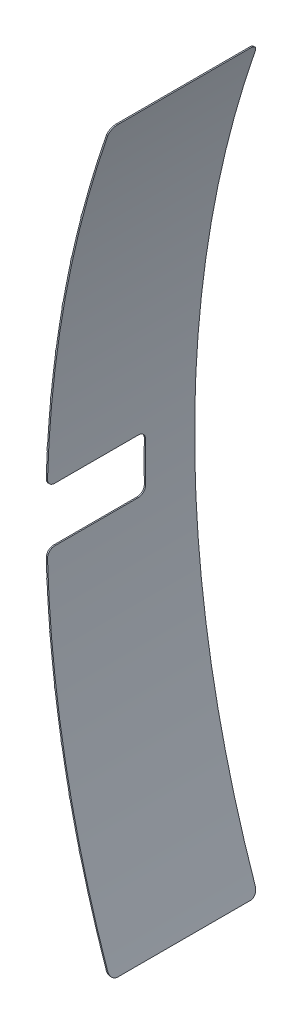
ISO-10303-21;
HEADER;
FILE_DESCRIPTION(('STEP AP214'),'2;1');
FILE_NAME('part.step','',(''),(''),'','','');
FILE_SCHEMA(('AUTOMOTIVE_DESIGN { 1 0 10303 214 1 1 1 1 }'));
ENDSEC;
DATA;
#1=APPLICATION_CONTEXT('core data for automotive mechanical design processes');
#2=APPLICATION_PROTOCOL_DEFINITION('international standard','automotive_design',2000,#1);
#3=PRODUCT_CONTEXT('',#1,'mechanical');
#4=PRODUCT('Part','Part','',(#3));
#5=PRODUCT_RELATED_PRODUCT_CATEGORY('part','',(#4));
#6=PRODUCT_DEFINITION_FORMATION('','',#4);
#7=PRODUCT_DEFINITION_CONTEXT('part definition',#1,'design');
#8=PRODUCT_DEFINITION('design','',#6,#7);
#9=PRODUCT_DEFINITION_SHAPE('','',#8);
#10=(LENGTH_UNIT() NAMED_UNIT(*) SI_UNIT(.MILLI.,.METRE.));
#11=(NAMED_UNIT(*) PLANE_ANGLE_UNIT() SI_UNIT($,.RADIAN.));
#12=(NAMED_UNIT(*) SI_UNIT($,.STERADIAN.) SOLID_ANGLE_UNIT());
#13=UNCERTAINTY_MEASURE_WITH_UNIT(LENGTH_MEASURE(1.E-05),#10,'distance_accuracy_value','');
#14=(GEOMETRIC_REPRESENTATION_CONTEXT(3) GLOBAL_UNCERTAINTY_ASSIGNED_CONTEXT((#13)) GLOBAL_UNIT_ASSIGNED_CONTEXT((#10,
#11,#12)) REPRESENTATION_CONTEXT('',''));
#15=CARTESIAN_POINT('',(0.,0.,0.));
#16=DIRECTION('',(0.,0.,1.));
#17=DIRECTION('',(1.,0.,0.));
#18=AXIS2_PLACEMENT_3D('',#15,#16,#17);
#19=CARTESIAN_POINT('',(0.,0.,6.));
#20=DIRECTION('',(0.,0.,-1.));
#21=DIRECTION('',(-1.,0.,0.));
#22=AXIS2_PLACEMENT_3D('',#19,#20,#21);
#23=CYLINDRICAL_SURFACE('',#22,45.1);
#24=DIRECTION('',(0.,0.,-1.));
#25=VECTOR('',#24,1.);
#26=CARTESIAN_POINT('',(-43.5502543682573,11.721149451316,3.1));
#27=LINE('',#26,#25);
#28=CARTESIAN_POINT('',(-43.5502543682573,11.721149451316,3.1));
#29=VERTEX_POINT('',#28);
#30=CARTESIAN_POINT('',(-43.5502543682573,11.721149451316,2.9));
#31=VERTEX_POINT('',#30);
#32=EDGE_CURVE('E1607',#29,#31,#27,.T.);
#33=ORIENTED_EDGE('',*,*,#32,.T.);
#34=CARTESIAN_POINT('',(0.,0.,2.9));
#35=DIRECTION('',(0.,0.,-1.));
#36=DIRECTION('',(-0.946227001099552,0.323503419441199,0.));
#37=AXIS2_PLACEMENT_3D('',#34,#35,#36);
#38=CIRCLE('',#37,45.1);
#39=CARTESIAN_POINT('',(-42.6748377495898,14.5900042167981,2.9));
#40=VERTEX_POINT('',#39);
#41=EDGE_CURVE('E2915',#31,#40,#38,.T.);
#42=ORIENTED_EDGE('',*,*,#41,.T.);
#43=DIRECTION('',(0.,0.,1.));
#44=VECTOR('',#43,1.);
#45=CARTESIAN_POINT('',(-42.6748377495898,14.5900042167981,2.9));
#46=LINE('',#45,#44);
#47=CARTESIAN_POINT('',(-42.6748377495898,14.5900042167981,3.1));
#48=VERTEX_POINT('',#47);
#49=EDGE_CURVE('E803',#40,#48,#46,.T.);
#50=ORIENTED_EDGE('',*,*,#49,.T.);
#51=CARTESIAN_POINT('',(0.,0.,3.1));
#52=DIRECTION('',(0.,0.,-1.));
#53=DIRECTION('',(-0.946227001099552,0.323503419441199,0.));
#54=AXIS2_PLACEMENT_3D('',#51,#52,#53);
#55=CIRCLE('',#54,45.1);
#56=EDGE_CURVE('E2902',#29,#48,#55,.T.);
#57=ORIENTED_EDGE('',*,*,#56,.F.);
#58=EDGE_LOOP('',(#33,#42,#50,#57));
#59=FACE_BOUND('',#58,.T.);
#60=CARTESIAN_POINT('',(0.,0.,6.));
#61=DIRECTION('',(0.,0.,1.));
#62=DIRECTION('',(1.,0.,0.));
#63=AXIS2_PLACEMENT_3D('',#60,#61,#62);
#64=CIRCLE('',#63,45.1);
#65=CARTESIAN_POINT('',(-45.0369255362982,2.38439473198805,6.));
#66=VERTEX_POINT('',#65);
#67=CARTESIAN_POINT('',(-45.0782652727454,1.4,6.));
#68=VERTEX_POINT('',#67);
#69=EDGE_CURVE('E835',#66,#68,#64,.T.);
#70=ORIENTED_EDGE('',*,*,#69,.F.);
#71=DIRECTION('',(0.,0.,-1.));
#72=VECTOR('',#71,1.);
#73=CARTESIAN_POINT('',(-45.0369255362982,2.38439473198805,6.));
#74=LINE('',#73,#72);
#75=CARTESIAN_POINT('',(-45.0369255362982,2.38439473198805,2.));
#76=VERTEX_POINT('',#75);
#77=EDGE_CURVE('E798',#66,#76,#74,.T.);
#78=ORIENTED_EDGE('',*,*,#77,.T.);
#79=CARTESIAN_POINT('',(0.,0.,2.));
#80=DIRECTION('',(0.,0.,-1.));
#81=DIRECTION('',(-0.99835718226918,0.0572969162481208,0.));
#82=AXIS2_PLACEMENT_3D('',#79,#80,#81);
#83=CIRCLE('',#82,45.1);
#84=CARTESIAN_POINT('',(-45.02590892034,2.58409092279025,2.));
#85=VERTEX_POINT('',#84);
#86=EDGE_CURVE('E802',#76,#85,#83,.T.);
#87=ORIENTED_EDGE('',*,*,#86,.T.);
#88=DIRECTION('',(0.,0.,1.));
#89=VECTOR('',#88,1.);
#90=CARTESIAN_POINT('',(-45.02590892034,2.58409092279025,2.));
#91=LINE('',#90,#89);
#92=CARTESIAN_POINT('',(-45.02590892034,2.58409092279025,6.));
#93=VERTEX_POINT('',#92);
#94=EDGE_CURVE('E807',#85,#93,#91,.T.);
#95=ORIENTED_EDGE('',*,*,#94,.T.);
#96=CARTESIAN_POINT('',(-44.9059213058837,4.17950136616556,6.));
#97=VERTEX_POINT('',#96);
#98=EDGE_CURVE('E829',#97,#93,#64,.T.);
#99=ORIENTED_EDGE('',*,*,#98,.F.);
#100=DIRECTION('',(0.,0.,-1.));
#101=VECTOR('',#100,1.);
#102=CARTESIAN_POINT('',(-44.9059213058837,4.17950136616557,5.99999999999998));
#103=LINE('',#102,#101);
#104=CARTESIAN_POINT('',(-44.9059213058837,4.17950136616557,1.99999999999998));
#105=VERTEX_POINT('',#104);
#106=EDGE_CURVE('E810',#97,#105,#103,.T.);
#107=ORIENTED_EDGE('',*,*,#106,.T.);
#108=CARTESIAN_POINT('',(0.,0.,1.99999999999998));
#109=DIRECTION('',(0.,0.,-1.));
#110=DIRECTION('',(-0.995275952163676,0.0970864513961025,0.));
#111=AXIS2_PLACEMENT_3D('',#108,#109,#110);
#112=CIRCLE('',#111,45.1);
#113=CARTESIAN_POINT('',(-44.8869454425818,4.37859895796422,1.99999999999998));
#114=VERTEX_POINT('',#113);
#115=EDGE_CURVE('E840',#105,#114,#112,.T.);
#116=ORIENTED_EDGE('',*,*,#115,.T.);
#117=DIRECTION('',(0.,0.,1.));
#118=VECTOR('',#117,1.);
#119=CARTESIAN_POINT('',(-44.8869454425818,4.37859895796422,1.99999999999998));
#120=LINE('',#119,#118);
#121=CARTESIAN_POINT('',(-44.8869454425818,4.37859895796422,6.));
#122=VERTEX_POINT('',#121);
#123=EDGE_CURVE('E844',#114,#122,#120,.T.);
#124=ORIENTED_EDGE('',*,*,#123,.T.);
#125=CARTESIAN_POINT('',(-44.703395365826,5.96795130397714,6.));
#126=VERTEX_POINT('',#125);
#127=EDGE_CURVE('E869',#126,#122,#64,.T.);
#128=ORIENTED_EDGE('',*,*,#127,.F.);
#129=DIRECTION('',(0.,0.,-1.));
#130=VECTOR('',#129,1.);
#131=CARTESIAN_POINT('',(-44.703395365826,5.96795130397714,5.99999999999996));
#132=LINE('',#131,#130);
#133=CARTESIAN_POINT('',(-44.703395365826,5.96795130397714,1.99999999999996));
#134=VERTEX_POINT('',#133);
#135=EDGE_CURVE('E848',#126,#134,#132,.T.);
#136=ORIENTED_EDGE('',*,*,#135,.T.);
#137=CARTESIAN_POINT('',(0.,0.,1.99999999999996));
#138=DIRECTION('',(0.,0.,-1.));
#139=DIRECTION('',(-0.990609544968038,0.136721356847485,0.));
#140=AXIS2_PLACEMENT_3D('',#137,#138,#139);
#141=CIRCLE('',#140,45.1);
#142=CARTESIAN_POINT('',(-44.6764904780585,6.16613319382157,1.99999999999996));
#143=VERTEX_POINT('',#142);
#144=EDGE_CURVE('E1213',#134,#143,#141,.T.);
#145=ORIENTED_EDGE('',*,*,#144,.T.);
#146=DIRECTION('',(0.,0.,1.));
#147=VECTOR('',#146,1.);
#148=CARTESIAN_POINT('',(-44.6764904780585,6.16613319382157,1.99999999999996));
#149=LINE('',#148,#147);
#150=CARTESIAN_POINT('',(-44.6764904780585,6.16613319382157,6.));
#151=VERTEX_POINT('',#150);
#152=EDGE_CURVE('E1174',#143,#151,#149,.T.);
#153=ORIENTED_EDGE('',*,*,#152,.T.);
#154=CARTESIAN_POINT('',(-44.4296702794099,7.74689607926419,6.));
#155=VERTEX_POINT('',#154);
#156=EDGE_CURVE('E1207',#155,#151,#64,.T.);
#157=ORIENTED_EDGE('',*,*,#156,.F.);
#158=DIRECTION('',(0.,0.,-1.));
#159=VECTOR('',#158,1.);
#160=CARTESIAN_POINT('',(-44.4296702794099,7.74689607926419,5.99999999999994));
#161=LINE('',#160,#159);
#162=CARTESIAN_POINT('',(-44.4296702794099,7.74689607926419,1.99999999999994));
#163=VERTEX_POINT('',#162);
#164=EDGE_CURVE('E1169',#155,#163,#161,.T.);
#165=ORIENTED_EDGE('',*,*,#164,.T.);
#166=CARTESIAN_POINT('',(0.,0.,1.99999999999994));
#167=DIRECTION('',(0.,0.,-1.));
#168=DIRECTION('',(-0.984365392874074,0.176138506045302,0.));
#169=AXIS2_PLACEMENT_3D('',#166,#167,#168);
#170=CIRCLE('',#169,45.1);
#171=CARTESIAN_POINT('',(-44.3948792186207,7.94384662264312,1.99999999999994));
#172=VERTEX_POINT('',#171);
#173=EDGE_CURVE('E1173',#163,#172,#170,.T.);
#174=ORIENTED_EDGE('',*,*,#173,.T.);
#175=DIRECTION('',(0.,0.,1.));
#176=VECTOR('',#175,1.);
#177=CARTESIAN_POINT('',(-44.3948792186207,7.94384662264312,1.99999999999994));
#178=LINE('',#177,#176);
#179=CARTESIAN_POINT('',(-44.3948792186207,7.94384662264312,6.));
#180=VERTEX_POINT('',#179);
#181=EDGE_CURVE('E1133',#172,#180,#178,.T.);
#182=ORIENTED_EDGE('',*,*,#181,.T.);
#183=CARTESIAN_POINT('',(-44.0851820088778,9.51350236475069,6.));
#184=VERTEX_POINT('',#183);
#185=EDGE_CURVE('E1166',#184,#180,#64,.T.);
#186=ORIENTED_EDGE('',*,*,#185,.F.);
#187=DIRECTION('',(0.,0.,-1.));
#188=VECTOR('',#187,1.);
#189=CARTESIAN_POINT('',(-44.0851820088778,9.51350236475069,5.99999999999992));
#190=LINE('',#189,#188);
#191=CARTESIAN_POINT('',(-44.0851820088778,9.51350236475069,1.99999999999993));
#192=VERTEX_POINT('',#191);
#193=EDGE_CURVE('E1128',#184,#192,#190,.T.);
#194=ORIENTED_EDGE('',*,*,#193,.T.);
#195=CARTESIAN_POINT('',(0.,0.,1.99999999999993));
#196=DIRECTION('',(0.,0.,-1.));
#197=DIRECTION('',(-0.976553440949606,0.215275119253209,0.));
#198=AXIS2_PLACEMENT_3D('',#195,#196,#197);
#199=CIRCLE('',#198,45.1);
#200=CARTESIAN_POINT('',(-44.0425601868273,9.70890787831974,1.99999999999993));
#201=VERTEX_POINT('',#200);
#202=EDGE_CURVE('E1132',#192,#201,#199,.T.);
#203=ORIENTED_EDGE('',*,*,#202,.T.);
#204=DIRECTION('',(0.,0.,1.));
#205=VECTOR('',#204,1.);
#206=CARTESIAN_POINT('',(-44.0425601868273,9.70890787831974,1.99999999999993));
#207=LINE('',#206,#205);
#208=CARTESIAN_POINT('',(-44.0425601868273,9.70890787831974,6.));
#209=VERTEX_POINT('',#208);
#210=EDGE_CURVE('E1089',#201,#209,#207,.T.);
#211=ORIENTED_EDGE('',*,*,#210,.T.);
#212=CARTESIAN_POINT('',(-43.6704792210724,11.2649564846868,6.));
#213=VERTEX_POINT('',#212);
#214=EDGE_CURVE('E1125',#213,#209,#64,.T.);
#215=ORIENTED_EDGE('',*,*,#214,.F.);
#216=DIRECTION('',(0.,0.,-1.));
#217=VECTOR('',#216,1.);
#218=CARTESIAN_POINT('',(-43.6704792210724,11.2649564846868,5.99999999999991));
#219=LINE('',#218,#217);
#220=CARTESIAN_POINT('',(-43.6704792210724,11.2649564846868,1.99999999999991));
#221=VERTEX_POINT('',#220);
#222=EDGE_CURVE('E1084',#213,#221,#219,.T.);
#223=ORIENTED_EDGE('',*,*,#222,.T.);
#224=CARTESIAN_POINT('',(0.,0.,1.99999999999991));
#225=DIRECTION('',(0.,0.,-1.));
#226=DIRECTION('',(-0.967186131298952,0.254068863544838,0.));
#227=AXIS2_PLACEMENT_3D('',#224,#225,#226);
#228=CIRCLE('',#227,45.1);
#229=CARTESIAN_POINT('',(-43.6200945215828,11.4585057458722,1.99999999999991));
#230=VERTEX_POINT('',#229);
#231=EDGE_CURVE('E1088',#221,#230,#228,.T.);
#232=ORIENTED_EDGE('',*,*,#231,.T.);
#233=DIRECTION('',(0.,0.,1.));
#234=VECTOR('',#233,1.);
#235=CARTESIAN_POINT('',(-43.6200945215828,11.4585057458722,1.99999999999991));
#236=LINE('',#235,#234);
#237=CARTESIAN_POINT('',(-43.6200945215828,11.4585057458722,6.));
#238=VERTEX_POINT('',#237);
#239=EDGE_CURVE('E1093',#230,#238,#236,.T.);
#240=ORIENTED_EDGE('',*,*,#239,.T.);
#241=CARTESIAN_POINT('',(-42.6370730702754,14.7,6.));
#242=VERTEX_POINT('',#241);
#243=EDGE_CURVE('E1118',#242,#238,#64,.T.);
#244=ORIENTED_EDGE('',*,*,#243,.F.);
#245=CARTESIAN_POINT('',(-42.6370730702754,14.7,6.));
#246=CARTESIAN_POINT('',(-42.6309912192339,14.7176416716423,6.00001048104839));
#247=CARTESIAN_POINT('',(-42.624897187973,14.735280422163,5.99844430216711));
#248=CARTESIAN_POINT('',(-42.6128521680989,14.7700764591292,5.99223321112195));
#249=CARTESIAN_POINT('',(-42.6069013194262,14.7872332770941,5.98758540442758));
#250=CARTESIAN_POINT('',(-42.5953163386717,14.8205715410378,5.97527972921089));
#251=CARTESIAN_POINT('',(-42.589682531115,14.8367519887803,5.96761883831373));
#252=CARTESIAN_POINT('',(-42.5789208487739,14.8676079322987,5.94945469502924));
#253=CARTESIAN_POINT('',(-42.5737926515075,14.8822843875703,5.93895327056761));
#254=CARTESIAN_POINT('',(-42.5643523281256,14.9092625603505,5.91567980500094));
#255=CARTESIAN_POINT('',(-42.5600215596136,14.9216187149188,5.90297856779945));
#256=CARTESIAN_POINT('',(-42.5521682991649,14.9439992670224,5.87543905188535));
#257=CARTESIAN_POINT('',(-42.548645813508,14.9540236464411,5.86060075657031));
#258=CARTESIAN_POINT('',(-42.5427272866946,14.9708526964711,5.83009801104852));
#259=CARTESIAN_POINT('',(-42.5402796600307,14.9778049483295,5.81452484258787));
#260=CARTESIAN_POINT('',(-42.5363420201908,14.9889840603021,5.78232591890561));
#261=CARTESIAN_POINT('',(-42.5348505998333,14.9932149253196,5.76570175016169));
#262=CARTESIAN_POINT('',(-42.5333995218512,14.9973306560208,5.74076341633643));
#263=CARTESIAN_POINT('',(-42.5330466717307,14.9983312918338,5.73264105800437));
#264=CARTESIAN_POINT('',(-42.5325761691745,14.9996654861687,5.71634724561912));
#265=CARTESIAN_POINT('',(-42.5324581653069,15.0000000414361,5.70817588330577));
#266=CARTESIAN_POINT('',(-42.5324581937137,15.,5.70000000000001));
#267=B_SPLINE_CURVE_WITH_KNOTS('',3,(#245,#246,#247,#248,#249,#250,#251,#252,#253,#254,#255,
#256,#257,#258,#259,#260,#261,#262,#263,#264,#265,#266),.UNSPECIFIED.,.F.,.F.,(4,2,2,2,2,2,2,2,
2,2,4),(0.,0.0559191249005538,0.111890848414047,0.167918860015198,0.223910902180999,
0.27835490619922,0.332799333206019,0.384228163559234,0.435581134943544,0.460128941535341,
0.484639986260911),.UNSPECIFIED.);
#268=CARTESIAN_POINT('',(-42.5324581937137,15.,5.7));
#269=VERTEX_POINT('',#268);
#270=EDGE_CURVE('E1097',#242,#269,#267,.T.);
#271=ORIENTED_EDGE('',*,*,#270,.T.);
#272=DIRECTION('',(0.,0.,-1.));
#273=VECTOR('',#272,1.);
#274=CARTESIAN_POINT('',(-42.5324581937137,15.,6.));
#275=LINE('',#274,#273);
#276=CARTESIAN_POINT('',(-42.5324581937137,15.,0.3));
#277=VERTEX_POINT('',#276);
#278=EDGE_CURVE('E1366',#269,#277,#275,.T.);
#279=ORIENTED_EDGE('',*,*,#278,.T.);
#280=CARTESIAN_POINT('',(-42.5324581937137,15.,0.3));
#281=CARTESIAN_POINT('',(-42.5324518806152,15.000017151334,0.283809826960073));
#282=CARTESIAN_POINT('',(-42.5329199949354,14.9986905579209,0.267629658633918));
#283=CARTESIAN_POINT('',(-42.5347561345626,14.993483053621,0.235776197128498));
#284=CARTESIAN_POINT('',(-42.5361220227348,14.9896082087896,0.220101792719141));
#285=CARTESIAN_POINT('',(-42.5397050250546,14.9794366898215,0.189667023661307));
#286=CARTESIAN_POINT('',(-42.5419220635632,14.9731402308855,0.174906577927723));
#287=CARTESIAN_POINT('',(-42.5471240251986,14.9583521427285,0.146676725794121));
#288=CARTESIAN_POINT('',(-42.5501091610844,14.9498599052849,0.133207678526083));
#289=CARTESIAN_POINT('',(-42.5568269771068,14.9307261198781,0.107574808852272));
#290=CARTESIAN_POINT('',(-42.5605759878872,14.9200375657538,0.0954504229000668));
#291=CARTESIAN_POINT('',(-42.5686537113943,14.8969752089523,0.0731560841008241));
#292=CARTESIAN_POINT('',(-42.5729825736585,14.8846009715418,0.062986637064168));
#293=CARTESIAN_POINT('',(-42.5823404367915,14.8578092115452,0.0443106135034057));
#294=CARTESIAN_POINT('',(-42.5873945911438,14.8433175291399,0.0359231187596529));
#295=CARTESIAN_POINT('',(-42.5978621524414,14.8132506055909,0.0216998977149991));
#296=CARTESIAN_POINT('',(-42.6032756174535,14.7976751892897,0.0158645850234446));
#297=CARTESIAN_POINT('',(-42.6134164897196,14.7684438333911,0.00758386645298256));
#298=CARTESIAN_POINT('',(-42.6181123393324,14.7548875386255,0.0047415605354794));
#299=CARTESIAN_POINT('',(-42.6275652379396,14.7275556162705,0.000949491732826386));
#300=CARTESIAN_POINT('',(-42.6323221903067,14.713780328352,-2.95928772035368E-06));
#301=CARTESIAN_POINT('',(-42.6370730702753,14.7,0.));
#302=B_SPLINE_CURVE_WITH_KNOTS('',3,(#280,#281,#282,#283,#284,#285,#286,#287,#288,#289,#290,
#291,#292,#293,#294,#295,#296,#297,#298,#299,#300,#301),.UNSPECIFIED.,.F.,.F.,(4,2,2,2,2,2,2,2,
2,2,4),(0.,0.0484941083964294,0.0968731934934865,0.145247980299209,0.193636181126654,
0.243194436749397,0.292765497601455,0.345006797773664,0.39725656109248,0.441011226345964,
0.484703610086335),.UNSPECIFIED.);
#303=CARTESIAN_POINT('',(-42.6370730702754,14.7,0.));
#304=VERTEX_POINT('',#303);
#305=EDGE_CURVE('E1369',#277,#304,#302,.T.);
#306=ORIENTED_EDGE('',*,*,#305,.T.);
#307=CARTESIAN_POINT('',(0.,0.,0.));
#308=DIRECTION('',(0.,0.,1.));
#309=DIRECTION('',(1.,0.,0.));
#310=AXIS2_PLACEMENT_3D('',#307,#308,#309);
#311=CIRCLE('',#310,45.1);
#312=CARTESIAN_POINT('',(-44.9905443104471,3.14021060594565,0.));
#313=VERTEX_POINT('',#312);
#314=EDGE_CURVE('E1351',#304,#313,#311,.T.);
#315=ORIENTED_EDGE('',*,*,#314,.T.);
#316=CARTESIAN_POINT('',(-45.099774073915,0.142753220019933,2.));
#317=CARTESIAN_POINT('',(-45.0966088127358,1.14274862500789,1.3333330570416));
#318=CARTESIAN_POINT('',(-45.0601720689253,2.14263714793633,0.6666669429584));
#319=CARTESIAN_POINT('',(-44.9905443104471,3.14021060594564,0.));
#320=B_SPLINE_CURVE_WITH_KNOTS('',3,(#316,#317,#318,#319),.UNSPECIFIED.,.F.,.F.,(4,4),(0.,1.),.UNSPECIFIED.);
#321=CARTESIAN_POINT('',(-45.099774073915,0.142753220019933,2.));
#322=VERTEX_POINT('',#321);
#323=EDGE_CURVE('E2859',#313,#322,#320,.F.);
#324=ORIENTED_EDGE('',*,*,#323,.T.);
#325=CARTESIAN_POINT('',(0.,0.,2.));
#326=DIRECTION('',(0.,0.,-1.));
#327=DIRECTION('',(-1.,0.,0.));
#328=AXIS2_PLACEMENT_3D('',#325,#326,#327);
#329=CIRCLE('',#328,45.1);
#330=CARTESIAN_POINT('',(-45.0929040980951,0.8,2.));
#331=VERTEX_POINT('',#330);
#332=EDGE_CURVE('E1353',#322,#331,#329,.T.);
#333=ORIENTED_EDGE('',*,*,#332,.T.);
#334=CARTESIAN_POINT('',(-45.0929040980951,0.8,2.));
#335=CARTESIAN_POINT('',(-45.0926049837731,0.816880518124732,1.99998568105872));
#336=CARTESIAN_POINT('',(-45.0922957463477,0.833756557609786,2.00142390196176));
#337=CARTESIAN_POINT('',(-45.09166827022,0.867018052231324,2.00709957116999));
#338=CARTESIAN_POINT('',(-45.091350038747,0.883403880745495,2.01133482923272));
#339=CARTESIAN_POINT('',(-45.0907151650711,0.91523882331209,2.02250169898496));
#340=CARTESIAN_POINT('',(-45.0903985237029,0.930687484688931,2.02943460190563));
#341=CARTESIAN_POINT('',(-45.0897797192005,0.960199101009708,2.04579402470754));
#342=CARTESIAN_POINT('',(-45.0894775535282,0.974262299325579,2.05522010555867));
#343=CARTESIAN_POINT('',(-45.0889006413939,1.00060633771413,2.07629990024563));
#344=CARTESIAN_POINT('',(-45.0886258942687,1.01288722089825,2.08795356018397));
#345=CARTESIAN_POINT('',(-45.0881163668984,1.03532057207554,2.11316077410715));
#346=CARTESIAN_POINT('',(-45.0878815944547,1.04547262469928,2.12671469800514));
#347=CARTESIAN_POINT('',(-45.0874633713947,1.06335650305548,2.15533417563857));
#348=CARTESIAN_POINT('',(-45.0872799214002,1.07108829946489,2.17039974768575));
#349=CARTESIAN_POINT('',(-45.0869735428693,1.08390872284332,2.20161274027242));
#350=CARTESIAN_POINT('',(-45.0868505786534,1.08899890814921,2.21775951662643));
#351=CARTESIAN_POINT('',(-45.0867021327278,1.0951240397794,2.2450045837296));
#352=CARTESIAN_POINT('',(-45.0866576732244,1.09695141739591,2.25593119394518));
#353=CARTESIAN_POINT('',(-45.086598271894,1.09938923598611,2.27790367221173));
#354=CARTESIAN_POINT('',(-45.0865832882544,1.10000140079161,2.28894934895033));
#355=CARTESIAN_POINT('',(-45.0865833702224,1.10000000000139,2.29999999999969));
#356=B_SPLINE_CURVE_WITH_KNOTS('',3,(#334,#335,#336,#337,#338,#339,#340,#341,#342,#343,#344,
#345,#346,#347,#348,#349,#350,#351,#352,#353,#354,#355),.UNSPECIFIED.,.F.,.F.,(4,2,2,2,2,2,2,2,
2,2,4),(0.,0.050582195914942,0.101124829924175,0.151691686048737,0.202249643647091,
0.252806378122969,0.303372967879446,0.353940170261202,0.40447750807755,0.43764991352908,
0.470775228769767),.UNSPECIFIED.);
#357=CARTESIAN_POINT('',(-45.0865833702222,1.1,2.3));
#358=VERTEX_POINT('',#357);
#359=EDGE_CURVE('E1459',#331,#358,#356,.T.);
#360=ORIENTED_EDGE('',*,*,#359,.T.);
#361=DIRECTION('',(0.,0.,-1.));
#362=VECTOR('',#361,1.);
#363=CARTESIAN_POINT('',(-45.0865833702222,1.1,6.));
#364=LINE('',#363,#362);
#365=CARTESIAN_POINT('',(-45.0865833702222,1.1,5.7));
#366=VERTEX_POINT('',#365);
#367=EDGE_CURVE('E1466',#358,#366,#364,.F.);
#368=ORIENTED_EDGE('',*,*,#367,.T.);
#369=CARTESIAN_POINT('',(-45.0865833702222,1.1,5.7));
#370=CARTESIAN_POINT('',(-45.0865834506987,1.09998564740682,5.71687354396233));
#371=CARTESIAN_POINT('',(-45.0865486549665,1.10142272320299,5.73374278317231));
#372=CARTESIAN_POINT('',(-45.0864099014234,1.10709379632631,5.76699100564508));
#373=CARTESIAN_POINT('',(-45.0863059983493,1.11132558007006,5.78337036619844));
#374=CARTESIAN_POINT('',(-45.0860295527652,1.12248310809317,5.81519297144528));
#375=CARTESIAN_POINT('',(-45.0858569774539,1.12941013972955,5.83063576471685));
#376=CARTESIAN_POINT('',(-45.0854445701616,1.14575517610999,5.86013657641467));
#377=CARTESIAN_POINT('',(-45.0852047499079,1.15517274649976,5.87419483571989));
#378=CARTESIAN_POINT('',(-45.0846601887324,1.17623389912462,5.90053208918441));
#379=CARTESIAN_POINT('',(-45.0843554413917,1.18787770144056,5.91281090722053));
#380=CARTESIAN_POINT('',(-45.0836848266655,1.21306257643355,5.93524192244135));
#381=CARTESIAN_POINT('',(-45.0833189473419,1.22660401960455,5.94539370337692));
#382=CARTESIAN_POINT('',(-45.0825317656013,1.25520282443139,5.96328410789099));
#383=CARTESIAN_POINT('',(-45.08211043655,1.27026091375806,5.97102156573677));
#384=CARTESIAN_POINT('',(-45.0812205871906,1.30145810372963,5.98385481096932));
#385=CARTESIAN_POINT('',(-45.0807520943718,1.31759657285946,5.98895212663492));
#386=CARTESIAN_POINT('',(-45.0799452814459,1.34486093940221,5.9950983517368));
#387=CARTESIAN_POINT('',(-45.0796171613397,1.35581597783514,5.9969353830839));
#388=CARTESIAN_POINT('',(-45.078949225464,1.37784586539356,5.99938604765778));
#389=CARTESIAN_POINT('',(-45.0786094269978,1.38892052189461,6.00000141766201));
#390=CARTESIAN_POINT('',(-45.0782652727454,1.39999999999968,6.00000000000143));
#391=B_SPLINE_CURVE_WITH_KNOTS('',3,(#369,#370,#371,#372,#373,#374,#375,#376,#377,#378,#379,
#380,#381,#382,#383,#384,#385,#386,#387,#388,#389,#390),.UNSPECIFIED.,.F.,.F.,(4,2,2,2,2,2,2,2,
2,2,4),(0.,0.0505533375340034,0.101066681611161,0.151604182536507,0.202132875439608,
0.25266656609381,0.303210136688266,0.353778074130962,0.404316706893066,0.437591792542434,
0.47081953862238),.UNSPECIFIED.);
#392=EDGE_CURVE('E1444',#366,#68,#391,.T.);
#393=ORIENTED_EDGE('',*,*,#392,.T.);
#394=EDGE_LOOP('',(#70,#78,#87,#95,#99,#107,#116,#124,#128,#136,#145,#153,#157,#165,#174,#182,
#186,#194,#203,#211,#215,#223,#232,#240,#244,#271,#279,#306,#315,#324,#333,#360,#368,#393));
#395=FACE_BOUND('',#394,.T.);
#396=ADVANCED_FACE('F690',(#59,#395),#23,.T.);
#397=CARTESIAN_POINT('',(0.,0.,6.));
#398=DIRECTION('',(0.,0.,1.));
#399=DIRECTION('',(1.,0.,0.));
#400=AXIS2_PLACEMENT_3D('',#397,#398,#399);
#401=PLANE('',#400);
#402=ORIENTED_EDGE('',*,*,#243,.T.);
#403=DIRECTION('',(0.967186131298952,-0.254068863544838,0.));
#404=VECTOR('',#403,1.);
#405=CARTESIAN_POINT('',(-43.6200945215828,11.4585057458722,6.));
#406=LINE('',#405,#404);
#407=CARTESIAN_POINT('',(-43.6297663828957,11.4610464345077,6.));
#408=VERTEX_POINT('',#407);
#409=EDGE_CURVE('E863',#408,#238,#406,.T.);
#410=ORIENTED_EDGE('',*,*,#409,.F.);
#411=CARTESIAN_POINT('',(0.,0.,6.));
#412=DIRECTION('',(0.,0.,-1.));
#413=DIRECTION('',(-1.,0.,0.));
#414=AXIS2_PLACEMENT_3D('',#411,#412,#413);
#415=CIRCLE('',#414,45.11);
#416=CARTESIAN_POINT('',(-43.6801622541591,11.2674542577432,6.));
#417=VERTEX_POINT('',#416);
#418=EDGE_CURVE('E1113',#408,#417,#415,.F.);
#419=ORIENTED_EDGE('',*,*,#418,.T.);
#420=DIRECTION('',(0.968303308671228,-0.249777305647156,0.));
#421=VECTOR('',#420,1.);
#422=CARTESIAN_POINT('',(-43.6704792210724,11.2649564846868,6.));
#423=LINE('',#422,#421);
#424=EDGE_CURVE('E1117',#417,#213,#423,.T.);
#425=ORIENTED_EDGE('',*,*,#424,.T.);
#426=ORIENTED_EDGE('',*,*,#214,.T.);
#427=DIRECTION('',(0.976553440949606,-0.215275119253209,0.));
#428=VECTOR('',#427,1.);
#429=CARTESIAN_POINT('',(-44.0425601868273,9.70890787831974,6.));
#430=LINE('',#429,#428);
#431=CARTESIAN_POINT('',(-44.0523257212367,9.71106062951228,6.));
#432=VERTEX_POINT('',#431);
#433=EDGE_CURVE('E1112',#432,#209,#430,.T.);
#434=ORIENTED_EDGE('',*,*,#433,.F.);
#435=CARTESIAN_POINT('',(0.,0.,6.));
#436=DIRECTION('',(0.,0.,-1.));
#437=DIRECTION('',(-1.,0.,0.));
#438=AXIS2_PLACEMENT_3D('',#435,#436,#437);
#439=CIRCLE('',#438,45.11);
#440=CARTESIAN_POINT('',(-44.0949569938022,9.51561178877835,6.));
#441=VERTEX_POINT('',#440);
#442=EDGE_CURVE('E1155',#432,#441,#439,.F.);
#443=ORIENTED_EDGE('',*,*,#442,.T.);
#444=DIRECTION('',(0.977498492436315,-0.210942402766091,0.));
#445=VECTOR('',#444,1.);
#446=CARTESIAN_POINT('',(-44.0851820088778,9.51350236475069,6.));
#447=LINE('',#446,#445);
#448=EDGE_CURVE('E1159',#441,#184,#447,.T.);
#449=ORIENTED_EDGE('',*,*,#448,.T.);
#450=ORIENTED_EDGE('',*,*,#185,.T.);
#451=DIRECTION('',(0.984365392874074,-0.176138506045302,0.));
#452=VECTOR('',#451,1.);
#453=CARTESIAN_POINT('',(-44.3948792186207,7.94384662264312,6.));
#454=LINE('',#453,#452);
#455=CARTESIAN_POINT('',(-44.4047228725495,7.94560800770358,6.));
#456=VERTEX_POINT('',#455);
#457=EDGE_CURVE('E1154',#456,#180,#454,.T.);
#458=ORIENTED_EDGE('',*,*,#457,.F.);
#459=CARTESIAN_POINT('',(0.,0.,6.));
#460=DIRECTION('',(0.,0.,-1.));
#461=DIRECTION('',(-1.,0.,0.));
#462=AXIS2_PLACEMENT_3D('',#459,#460,#461);
#463=CIRCLE('',#462,45.11);
#464=CARTESIAN_POINT('',(-44.4395216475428,7.7486137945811,6.));
#465=VERTEX_POINT('',#464);
#466=EDGE_CURVE('E1196',#456,#465,#463,.F.);
#467=ORIENTED_EDGE('',*,*,#466,.T.);
#468=DIRECTION('',(0.985136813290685,-0.171771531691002,0.));
#469=VECTOR('',#468,1.);
#470=CARTESIAN_POINT('',(-44.4296702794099,7.74689607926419,6.));
#471=LINE('',#470,#469);
#472=EDGE_CURVE('E1200',#465,#155,#471,.T.);
#473=ORIENTED_EDGE('',*,*,#472,.T.);
#474=ORIENTED_EDGE('',*,*,#156,.T.);
#475=DIRECTION('',(0.990609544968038,-0.136721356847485,0.));
#476=VECTOR('',#475,1.);
#477=CARTESIAN_POINT('',(-44.6764904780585,6.16613319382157,6.));
#478=LINE('',#477,#476);
#479=CARTESIAN_POINT('',(-44.6863965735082,6.16750040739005,6.));
#480=VERTEX_POINT('',#479);
#481=EDGE_CURVE('E1195',#480,#151,#478,.T.);
#482=ORIENTED_EDGE('',*,*,#481,.F.);
#483=CARTESIAN_POINT('',(0.,0.,6.));
#484=DIRECTION('',(0.,0.,-1.));
#485=DIRECTION('',(-1.,0.,0.));
#486=AXIS2_PLACEMENT_3D('',#483,#484,#485);
#487=CIRCLE('',#486,45.11);
#488=CARTESIAN_POINT('',(-44.7133074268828,5.96927457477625,6.));
#489=VERTEX_POINT('',#488);
#490=EDGE_CURVE('E1233',#480,#489,#487,.F.);
#491=ORIENTED_EDGE('',*,*,#490,.T.);
#492=DIRECTION('',(0.991206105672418,-0.132327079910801,0.));
#493=VECTOR('',#492,1.);
#494=CARTESIAN_POINT('',(-44.703395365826,5.96795130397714,6.));
#495=LINE('',#494,#493);
#496=EDGE_CURVE('E1237',#489,#126,#495,.T.);
#497=ORIENTED_EDGE('',*,*,#496,.T.);
#498=ORIENTED_EDGE('',*,*,#127,.T.);
#499=DIRECTION('',(0.995275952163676,-0.0970864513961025,0.));
#500=VECTOR('',#499,1.);
#501=CARTESIAN_POINT('',(-44.8869454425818,4.37859895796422,6.));
#502=LINE('',#501,#500);
#503=CARTESIAN_POINT('',(-44.8968982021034,4.37956982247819,6.));
#504=VERTEX_POINT('',#503);
#505=EDGE_CURVE('E823',#504,#122,#502,.T.);
#506=ORIENTED_EDGE('',*,*,#505,.F.);
#507=CARTESIAN_POINT('',(0.,0.,6.));
#508=DIRECTION('',(0.,0.,-1.));
#509=DIRECTION('',(-1.,0.,0.));
#510=AXIS2_PLACEMENT_3D('',#507,#508,#509);
#511=CIRCLE('',#510,45.11);
#512=CARTESIAN_POINT('',(-44.9158782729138,4.18042808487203,6.));
#513=VERTEX_POINT('',#512);
#514=EDGE_CURVE('E864',#504,#513,#511,.F.);
#515=ORIENTED_EDGE('',*,*,#514,.T.);
#516=DIRECTION('',(0.995696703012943,-0.0926718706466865,0.));
#517=VECTOR('',#516,1.);
#518=CARTESIAN_POINT('',(-44.9059213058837,4.17950136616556,6.));
#519=LINE('',#518,#517);
#520=EDGE_CURVE('E868',#513,#97,#519,.T.);
#521=ORIENTED_EDGE('',*,*,#520,.T.);
#522=ORIENTED_EDGE('',*,*,#98,.T.);
#523=DIRECTION('',(0.99835718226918,-0.0572969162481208,0.));
#524=VECTOR('',#523,1.);
#525=CARTESIAN_POINT('',(-45.02590892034,2.58409092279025,6.));
#526=LINE('',#525,#524);
#527=CARTESIAN_POINT('',(-45.0358924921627,2.58466389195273,6.));
#528=VERTEX_POINT('',#527);
#529=EDGE_CURVE('E13',#528,#93,#526,.T.);
#530=ORIENTED_EDGE('',*,*,#529,.F.);
#531=CARTESIAN_POINT('',(0.,0.,6.));
#532=DIRECTION('',(0.,0.,-1.));
#533=DIRECTION('',(-1.,0.,0.));
#534=AXIS2_PLACEMENT_3D('',#531,#532,#533);
#535=CIRCLE('',#534,45.11);
#536=CARTESIAN_POINT('',(-45.0469115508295,2.38492342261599,6.));
#537=VERTEX_POINT('',#536);
#538=EDGE_CURVE('E824',#528,#537,#535,.F.);
#539=ORIENTED_EDGE('',*,*,#538,.T.);
#540=DIRECTION('',(0.998601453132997,-0.0528690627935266,0.));
#541=VECTOR('',#540,1.);
#542=CARTESIAN_POINT('',(-45.0369255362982,2.38439473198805,6.));
#543=LINE('',#542,#541);
#544=EDGE_CURVE('E828',#537,#66,#543,.T.);
#545=ORIENTED_EDGE('',*,*,#544,.T.);
#546=ORIENTED_EDGE('',*,*,#69,.T.);
#547=DIRECTION('',(-1.,0.,0.));
#548=VECTOR('',#547,1.);
#549=CARTESIAN_POINT('',(-45.0365684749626,1.4,6.));
#550=LINE('',#549,#548);
#551=CARTESIAN_POINT('',(-45.0282411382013,1.4,6.));
#552=VERTEX_POINT('',#551);
#553=EDGE_CURVE('E1578',#68,#552,#550,.F.);
#554=ORIENTED_EDGE('',*,*,#553,.T.);
#555=CARTESIAN_POINT('',(0.,0.,6.));
#556=DIRECTION('',(0.,0.,-1.));
#557=DIRECTION('',(1.,0.,0.));
#558=AXIS2_PLACEMENT_3D('',#555,#556,#557);
#559=CIRCLE('',#558,45.05);
#560=CARTESIAN_POINT('',(-42.5841813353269,14.7,6.));
#561=VERTEX_POINT('',#560);
#562=EDGE_CURVE('E1620',#552,#561,#559,.T.);
#563=ORIENTED_EDGE('',*,*,#562,.T.);
#564=DIRECTION('',(-1.,0.,0.));
#565=VECTOR('',#564,1.);
#566=CARTESIAN_POINT('',(-42.5324581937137,14.7,6.));
#567=LINE('',#566,#565);
#568=EDGE_CURVE('E1529',#561,#242,#567,.T.);
#569=ORIENTED_EDGE('',*,*,#568,.T.);
#570=EDGE_LOOP('',(#402,#410,#419,#425,#426,#434,#443,#449,#450,#458,#467,#473,#474,#482,#491,
#497,#498,#506,#515,#521,#522,#530,#539,#545,#546,#554,#563,#569));
#571=FACE_BOUND('',#570,.T.);
#572=ADVANCED_FACE('F1593',(#571),#401,.T.);
#573=CARTESIAN_POINT('',(0.,0.,6.));
#574=DIRECTION('',(0.,0.,-1.));
#575=DIRECTION('',(-1.,0.,0.));
#576=AXIS2_PLACEMENT_3D('',#573,#574,#575);
#577=CYLINDRICAL_SURFACE('',#576,45.05);
#578=ORIENTED_EDGE('',*,*,#562,.F.);
#579=CARTESIAN_POINT('',(-45.0282411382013,1.4,6.));
#580=CARTESIAN_POINT('',(-45.0287663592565,1.38311908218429,6.00001432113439));
#581=CARTESIAN_POINT('',(-45.0292812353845,1.36624203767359,5.99857602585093));
#582=CARTESIAN_POINT('',(-45.0302780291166,1.3329773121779,5.99289947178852));
#583=CARTESIAN_POINT('',(-45.0307599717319,1.31658926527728,5.98866336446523));
#584=CARTESIAN_POINT('',(-45.0316796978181,1.28474900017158,5.97749342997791));
#585=CARTESIAN_POINT('',(-45.0321174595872,1.26929724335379,5.97055828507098));
#586=CARTESIAN_POINT('',(-45.0329397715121,1.23977947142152,5.95419274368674));
#587=CARTESIAN_POINT('',(-45.0333243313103,1.22571320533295,5.94476280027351));
#588=CARTESIAN_POINT('',(-45.03403371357,1.19936716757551,5.92367638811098));
#589=CARTESIAN_POINT('',(-45.0343585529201,1.18708689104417,5.91202055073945));
#590=CARTESIAN_POINT('',(-45.0349442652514,1.16465498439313,5.88680855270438));
#591=CARTESIAN_POINT('',(-45.0352051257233,1.15450377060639,5.87325202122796));
#592=CARTESIAN_POINT('',(-45.0356599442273,1.13662380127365,5.84462979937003));
#593=CARTESIAN_POINT('',(-45.0358539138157,1.12889462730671,5.82956437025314));
#594=CARTESIAN_POINT('',(-45.0361733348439,1.11607916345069,5.79835207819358));
#595=CARTESIAN_POINT('',(-45.0362988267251,1.11099131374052,5.78220585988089));
#596=CARTESIAN_POINT('',(-45.0364493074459,1.10487086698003,5.75496691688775));
#597=CARTESIAN_POINT('',(-45.0364940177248,1.10304539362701,5.74404587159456));
#598=CARTESIAN_POINT('',(-45.0365535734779,1.10061012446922,5.72208474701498));
#599=CARTESIAN_POINT('',(-45.0365684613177,1.09999860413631,5.71104485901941));
#600=CARTESIAN_POINT('',(-45.0365684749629,1.0999999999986,5.70000000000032));
#601=B_SPLINE_CURVE_WITH_KNOTS('',3,(#579,#580,#581,#582,#583,#584,#585,#586,#587,#588,#589,
#590,#591,#592,#593,#594,#595,#596,#597,#598,#599,#600),.UNSPECIFIED.,.F.,.F.,(4,2,2,2,2,2,2,2,
2,2,4),(0.,0.0506001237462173,0.101161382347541,0.151747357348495,0.202324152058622,
0.2528866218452,0.303458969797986,0.354022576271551,0.404556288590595,0.437711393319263,
0.470819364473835),.UNSPECIFIED.);
#602=CARTESIAN_POINT('',(-45.0365684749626,1.1,5.7));
#603=VERTEX_POINT('',#602);
#604=EDGE_CURVE('E1521',#552,#603,#601,.T.);
#605=ORIENTED_EDGE('',*,*,#604,.T.);
#606=DIRECTION('',(0.,0.,-1.));
#607=VECTOR('',#606,1.);
#608=CARTESIAN_POINT('',(-45.0365684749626,1.1,6.));
#609=LINE('',#608,#607);
#610=CARTESIAN_POINT('',(-45.0365684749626,1.1,2.3));
#611=VERTEX_POINT('',#610);
#612=EDGE_CURVE('E1528',#603,#611,#609,.T.);
#613=ORIENTED_EDGE('',*,*,#612,.T.);
#614=CARTESIAN_POINT('',(-45.0365684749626,1.1,2.3));
#615=CARTESIAN_POINT('',(-45.0365678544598,1.10001435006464,2.28312586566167));
#616=CARTESIAN_POINT('',(-45.0366032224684,1.09857717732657,2.26625605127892));
#617=CARTESIAN_POINT('',(-45.0367413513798,1.09290572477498,2.233006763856));
#618=CARTESIAN_POINT('',(-45.0368440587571,1.08867366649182,2.2166269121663));
#619=CARTESIAN_POINT('',(-45.0371123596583,1.07751541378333,2.18480338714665));
#620=CARTESIAN_POINT('',(-45.0372779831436,1.07058793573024,2.16936016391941));
#621=CARTESIAN_POINT('',(-45.0376635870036,1.05424173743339,2.13985845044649));
#622=CARTESIAN_POINT('',(-45.0378835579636,1.0448234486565,2.1257997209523));
#623=CARTESIAN_POINT('',(-45.0383672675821,1.02375993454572,2.09946088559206));
#624=CARTESIAN_POINT('',(-45.0386310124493,1.01211439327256,2.08718103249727));
#625=CARTESIAN_POINT('',(-45.0391900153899,0.986925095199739,2.06474811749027));
#626=CARTESIAN_POINT('',(-45.0394852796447,0.97338096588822,2.05459547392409));
#627=CARTESIAN_POINT('',(-45.0400943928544,0.944775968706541,2.03670405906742));
#628=CARTESIAN_POINT('',(-45.0404082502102,0.92971441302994,2.02896638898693));
#629=CARTESIAN_POINT('',(-45.041041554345,0.898509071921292,2.01613358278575));
#630=CARTESIAN_POINT('',(-45.0413609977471,0.882365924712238,2.01103690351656));
#631=CARTESIAN_POINT('',(-45.041885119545,0.85510361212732,2.0048953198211));
#632=CARTESIAN_POINT('',(-45.0420916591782,0.844155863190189,2.00306070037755));
#633=CARTESIAN_POINT('',(-45.0424989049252,0.822140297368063,2.00061319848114));
#634=CARTESIAN_POINT('',(-45.0426996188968,0.811072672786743,1.99999858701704));
#635=CARTESIAN_POINT('',(-45.0428962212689,0.800000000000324,1.99999999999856));
#636=B_SPLINE_CURVE_WITH_KNOTS('',3,(#614,#615,#616,#617,#618,#619,#620,#621,#622,#623,#624,
#625,#626,#627,#628,#629,#630,#631,#632,#633,#634,#635),.UNSPECIFIED.,.F.,.F.,(4,2,2,2,2,2,2,2,
2,2,4),(0.,0.050555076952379,0.101070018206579,0.151609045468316,0.202139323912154,
0.25267677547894,0.303224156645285,0.353794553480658,0.4043353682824,0.437579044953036,
0.470775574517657),.UNSPECIFIED.);
#637=CARTESIAN_POINT('',(-45.0428962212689,0.8,2.));
#638=VERTEX_POINT('',#637);
#639=EDGE_CURVE('E1467',#611,#638,#636,.T.);
#640=ORIENTED_EDGE('',*,*,#639,.T.);
#641=CARTESIAN_POINT('',(0.,0.,2.));
#642=DIRECTION('',(0.,0.,-1.));
#643=DIRECTION('',(-1.,0.,0.));
#644=AXIS2_PLACEMENT_3D('',#641,#642,#643);
#645=CIRCLE('',#644,45.05);
#646=CARTESIAN_POINT('',(-45.0428962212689,-0.8,2.));
#647=VERTEX_POINT('',#646);
#648=EDGE_CURVE('E1495',#638,#647,#645,.F.);
#649=ORIENTED_EDGE('',*,*,#648,.T.);
#650=CARTESIAN_POINT('',(-45.0428962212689,-0.8,2.));
#651=CARTESIAN_POINT('',(-45.0425967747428,-0.816880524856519,1.99998568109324));
#652=CARTESIAN_POINT('',(-45.0422871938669,-0.833756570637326,2.00142390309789));
#653=CARTESIAN_POINT('',(-45.041659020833,-0.86701807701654,2.00709957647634));
#654=CARTESIAN_POINT('',(-45.0413404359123,-0.883403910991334,2.01133483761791));
#655=CARTESIAN_POINT('',(-45.0407048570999,-0.91523886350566,2.02250171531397));
#656=CARTESIAN_POINT('',(-45.0403878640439,-0.93068752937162,2.0294346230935));
#657=CARTESIAN_POINT('',(-45.0397683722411,-0.960199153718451,2.04579405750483));
#658=CARTESIAN_POINT('',(-45.0394658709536,-0.974262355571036,2.05522014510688));
#659=CARTESIAN_POINT('',(-45.0388883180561,-1.00060639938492,2.07629995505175));
#660=CARTESIAN_POINT('',(-45.0386132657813,-1.01288728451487,2.08795362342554));
#661=CARTESIAN_POINT('',(-45.0381031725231,-1.0353206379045,2.11316085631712));
#662=CARTESIAN_POINT('',(-45.0378681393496,-1.0454726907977,2.12671479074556));
#663=CARTESIAN_POINT('',(-45.0374494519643,-1.06335656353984,2.15533428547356));
#664=CARTESIAN_POINT('',(-45.0372657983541,-1.0710883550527,2.17039986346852));
#665=CARTESIAN_POINT('',(-45.0369590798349,-1.08390876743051,2.20161286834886));
#666=CARTESIAN_POINT('',(-45.0368359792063,-1.08899894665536,2.21775965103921));
#667=CARTESIAN_POINT('',(-45.0366873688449,-1.09512406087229,2.2450047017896));
#668=CARTESIAN_POINT('',(-45.0366428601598,-1.09695143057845,2.25593128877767));
#669=CARTESIAN_POINT('',(-45.0365833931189,-1.09938923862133,2.27790371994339));
#670=CARTESIAN_POINT('',(-45.0365683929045,-1.10000140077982,2.28894937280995));
#671=CARTESIAN_POINT('',(-45.0365684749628,-1.10000000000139,2.29999999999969));
#672=B_SPLINE_CURVE_WITH_KNOTS('',3,(#650,#651,#652,#653,#654,#655,#656,#657,#658,#659,#660,
#661,#662,#663,#664,#665,#666,#667,#668,#669,#670,#671),.UNSPECIFIED.,.F.,.F.,(4,2,2,2,2,2,2,2,
2,2,4),(0.,0.0505822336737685,0.101124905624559,0.151691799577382,0.202249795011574,
0.252806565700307,0.303373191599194,0.353940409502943,0.404477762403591,0.437650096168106,
0.4707753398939),.UNSPECIFIED.);
#673=CARTESIAN_POINT('',(-45.0365684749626,-1.1,2.3));
#674=VERTEX_POINT('',#673);
#675=EDGE_CURVE('E1487',#647,#674,#672,.T.);
#676=ORIENTED_EDGE('',*,*,#675,.T.);
#677=DIRECTION('',(0.,0.,-1.));
#678=VECTOR('',#677,1.);
#679=CARTESIAN_POINT('',(-45.0365684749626,-1.1,6.));
#680=LINE('',#679,#678);
#681=CARTESIAN_POINT('',(-45.0365684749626,-1.1,5.7));
#682=VERTEX_POINT('',#681);
#683=EDGE_CURVE('E1494',#674,#682,#680,.F.);
#684=ORIENTED_EDGE('',*,*,#683,.T.);
#685=CARTESIAN_POINT('',(-45.0365684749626,-1.1,5.7));
#686=CARTESIAN_POINT('',(-45.0365685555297,-1.0999856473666,5.71687353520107));
#687=CARTESIAN_POINT('',(-45.0365337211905,-1.1014227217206,5.73374276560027));
#688=CARTESIAN_POINT('',(-45.0363948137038,-1.10709378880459,5.76699097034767));
#689=CARTESIAN_POINT('',(-45.0362907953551,-1.11132556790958,5.78337032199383));
#690=CARTESIAN_POINT('',(-45.0360140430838,-1.12248308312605,5.81519290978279));
#691=CARTESIAN_POINT('',(-45.0358412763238,-1.12941010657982,5.83063569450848));
#692=CARTESIAN_POINT('',(-45.0354284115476,-1.14575512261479,5.86013649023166));
#693=CARTESIAN_POINT('',(-45.0351883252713,-1.15517268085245,5.87419474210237));
#694=CARTESIAN_POINT('',(-45.034643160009,-1.17623380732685,5.90053198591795));
#695=CARTESIAN_POINT('',(-45.0343380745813,-1.18787759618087,5.91281080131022));
#696=CARTESIAN_POINT('',(-45.0336667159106,-1.2130624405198,5.93524181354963));
#697=CARTESIAN_POINT('',(-45.0333004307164,-1.22660386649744,5.94539359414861));
#698=CARTESIAN_POINT('',(-45.0325123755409,-1.25520264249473,5.96328400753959));
#699=CARTESIAN_POINT('',(-45.0320905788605,-1.27026072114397,5.97102147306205));
#700=CARTESIAN_POINT('',(-45.0311997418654,-1.30145788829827,5.98385473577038));
#701=CARTESIAN_POINT('',(-45.0307307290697,-1.31759634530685,5.98895206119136));
#702=CARTESIAN_POINT('',(-45.0299230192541,-1.34486073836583,5.99509831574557));
#703=CARTESIAN_POINT('',(-45.0295945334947,-1.35581581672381,5.99693536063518));
#704=CARTESIAN_POINT('',(-45.0289258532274,-1.37784578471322,5.99938604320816));
#705=CARTESIAN_POINT('',(-45.0285856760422,-1.38892048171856,6.00000141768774));
#706=CARTESIAN_POINT('',(-45.0282411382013,-1.39999999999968,6.00000000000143));
#707=B_SPLINE_CURVE_WITH_KNOTS('',3,(#685,#686,#687,#688,#689,#690,#691,#692,#693,#694,#695,
#696,#697,#698,#699,#700,#701,#702,#703,#704,#705,#706),.UNSPECIFIED.,.F.,.F.,(4,2,2,2,2,2,2,2,
2,2,4),(0.,0.0505533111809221,0.1010666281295,0.151604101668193,0.202132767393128,
0.252666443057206,0.303209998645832,0.353777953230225,0.404316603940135,0.437591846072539,
0.47081974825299),.UNSPECIFIED.);
#708=CARTESIAN_POINT('',(-45.0282411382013,-1.4,6.));
#709=VERTEX_POINT('',#708);
#710=EDGE_CURVE('E1530',#682,#709,#707,.T.);
#711=ORIENTED_EDGE('',*,*,#710,.T.);
#712=CARTESIAN_POINT('',(-42.5841813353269,-14.7,6.));
#713=VERTEX_POINT('',#712);
#714=EDGE_CURVE('E1515',#713,#709,#559,.T.);
#715=ORIENTED_EDGE('',*,*,#714,.F.);
#716=CARTESIAN_POINT('',(-42.5841813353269,-14.7,6.));
#717=CARTESIAN_POINT('',(-42.5780912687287,-14.7176435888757,6.00001047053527));
#718=CARTESIAN_POINT('',(-42.5719889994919,-14.7352842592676,5.99844396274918));
#719=CARTESIAN_POINT('',(-42.5599276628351,-14.7700841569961,5.99223149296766));
#720=CARTESIAN_POINT('',(-42.5539687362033,-14.7872429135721,5.98758262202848));
#721=CARTESIAN_POINT('',(-42.5423680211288,-14.8205849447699,5.97527400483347));
#722=CARTESIAN_POINT('',(-42.5367265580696,-14.8367672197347,5.96761123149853));
#723=CARTESIAN_POINT('',(-42.5259502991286,-14.8676264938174,5.94944240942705));
#724=CARTESIAN_POINT('',(-42.5208151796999,-14.8823044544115,5.93893819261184));
#725=CARTESIAN_POINT('',(-42.511362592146,-14.9092840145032,5.91565912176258));
#726=CARTESIAN_POINT('',(-42.5070264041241,-14.9216402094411,5.90295528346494));
#727=CARTESIAN_POINT('',(-42.4991634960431,-14.9440203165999,5.87540998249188));
#728=CARTESIAN_POINT('',(-42.4956367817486,-14.9540442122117,5.86056850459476));
#729=CARTESIAN_POINT('',(-42.4897118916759,-14.9708703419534,5.83006126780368));
#730=CARTESIAN_POINT('',(-42.4872619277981,-14.9778205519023,5.81448703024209));
#731=CARTESIAN_POINT('',(-42.4833208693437,-14.9889954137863,5.78228609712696));
#732=CARTESIAN_POINT('',(-42.4818283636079,-14.99322407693,5.76566099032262));
#733=CARTESIAN_POINT('',(-42.4803770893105,-14.9973352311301,5.7407286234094));
#734=CARTESIAN_POINT('',(-42.4800244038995,-14.9983341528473,5.73261314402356));
#735=CARTESIAN_POINT('',(-42.4795541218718,-14.9996660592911,5.71633322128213));
#736=CARTESIAN_POINT('',(-42.4794361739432,-15.0000000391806,5.70816886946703));
#737=CARTESIAN_POINT('',(-42.4794362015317,-15.,5.70000000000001));
#738=B_SPLINE_CURVE_WITH_KNOTS('',3,(#716,#717,#718,#719,#720,#721,#722,#723,#724,#725,#726,
#727,#728,#729,#730,#731,#732,#733,#734,#735,#736,#737),.UNSPECIFIED.,.F.,.F.,(4,2,2,2,2,2,2,2,
2,2,4),(0.,0.0559326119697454,0.111918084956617,0.167959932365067,0.223965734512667,
0.278419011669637,0.332872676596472,0.384302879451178,0.435657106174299,0.460183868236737,
0.484673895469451),.UNSPECIFIED.);
#739=CARTESIAN_POINT('',(-42.4794362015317,-15.,5.7));
#740=VERTEX_POINT('',#739);
#741=EDGE_CURVE('E1378',#713,#740,#738,.T.);
#742=ORIENTED_EDGE('',*,*,#741,.T.);
#743=DIRECTION('',(0.,0.,-1.));
#744=VECTOR('',#743,1.);
#745=CARTESIAN_POINT('',(-42.4794362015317,-15.,6.));
#746=LINE('',#745,#744);
#747=CARTESIAN_POINT('',(-42.4794362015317,-15.,0.3));
#748=VERTEX_POINT('',#747);
#749=EDGE_CURVE('E1375',#740,#748,#746,.T.);
#750=ORIENTED_EDGE('',*,*,#749,.T.);
#751=CARTESIAN_POINT('',(-42.4794362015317,-15.,0.3));
#752=CARTESIAN_POINT('',(-42.4794298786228,-15.000017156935,0.283811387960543));
#753=CARTESIAN_POINT('',(-42.4798984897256,-14.9986908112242,0.267632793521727));
#754=CARTESIAN_POINT('',(-42.4817365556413,-14.9934843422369,0.235782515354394));
#755=CARTESIAN_POINT('',(-42.4831038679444,-14.9896102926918,0.220109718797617));
#756=CARTESIAN_POINT('',(-42.4866905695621,-14.9794409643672,0.189678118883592));
#757=CARTESIAN_POINT('',(-42.4889098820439,-14.9731459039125,0.174919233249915));
#758=CARTESIAN_POINT('',(-42.4941171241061,-14.9583612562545,0.146692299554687));
#759=CARTESIAN_POINT('',(-42.4971052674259,-14.9498710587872,0.133224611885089));
#760=CARTESIAN_POINT('',(-42.5038299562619,-14.930741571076,0.107593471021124));
#761=CARTESIAN_POINT('',(-42.5075828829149,-14.9200551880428,0.0954695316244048));
#762=CARTESIAN_POINT('',(-42.5156689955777,-14.8969976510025,0.0731757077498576));
#763=CARTESIAN_POINT('',(-42.5200023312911,-14.8846260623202,0.0630063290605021));
#764=CARTESIAN_POINT('',(-42.5293703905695,-14.8578385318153,0.044328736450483));
#765=CARTESIAN_POINT('',(-42.5344303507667,-14.8433482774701,0.0359398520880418));
#766=CARTESIAN_POINT('',(-42.5449099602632,-14.8132842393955,0.0217136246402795));
#767=CARTESIAN_POINT('',(-42.550329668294,-14.7977102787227,0.0158766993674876));
#768=CARTESIAN_POINT('',(-42.5604846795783,-14.7684746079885,0.0075907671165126));
#769=CARTESIAN_POINT('',(-42.5651884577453,-14.7549123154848,0.00474587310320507));
#770=CARTESIAN_POINT('',(-42.5746573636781,-14.7275681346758,0.0009503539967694));
#771=CARTESIAN_POINT('',(-42.5794223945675,-14.7137865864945,-2.9621701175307E-06));
#772=CARTESIAN_POINT('',(-42.5841813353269,-14.7,0.));
#773=B_SPLINE_CURVE_WITH_KNOTS('',3,(#751,#752,#753,#754,#755,#756,#757,#758,#759,#760,#761,
#762,#763,#764,#765,#766,#767,#768,#769,#770,#771,#772),.UNSPECIFIED.,.F.,.F.,(4,2,2,2,2,2,2,2,
2,2,4),(0.,0.0484894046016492,0.0968636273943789,0.145233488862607,0.193616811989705,
0.243172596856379,0.292741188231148,0.344985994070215,0.397239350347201,0.441019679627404,
0.484737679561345),.UNSPECIFIED.);
#774=CARTESIAN_POINT('',(-42.5841813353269,-14.7,0.));
#775=VERTEX_POINT('',#774);
#776=EDGE_CURVE('E1377',#748,#775,#773,.T.);
#777=ORIENTED_EDGE('',*,*,#776,.T.);
#778=CARTESIAN_POINT('',(0.,0.,0.));
#779=DIRECTION('',(0.,0.,-1.));
#780=DIRECTION('',(1.,0.,0.));
#781=AXIS2_PLACEMENT_3D('',#778,#779,#780);
#782=CIRCLE('',#781,45.05);
#783=CARTESIAN_POINT('',(-42.5841813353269,14.7,0.));
#784=VERTEX_POINT('',#783);
#785=EDGE_CURVE('E1381',#775,#784,#782,.T.);
#786=ORIENTED_EDGE('',*,*,#785,.T.);
#787=CARTESIAN_POINT('',(-42.5841813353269,14.7,0.));
#788=CARTESIAN_POINT('',(-42.5780912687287,14.7176435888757,-1.04705352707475E-05));
#789=CARTESIAN_POINT('',(-42.5719889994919,14.7352842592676,0.00155603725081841));
#790=CARTESIAN_POINT('',(-42.5599276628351,14.7700841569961,0.00776850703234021));
#791=CARTESIAN_POINT('',(-42.5539687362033,14.7872429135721,0.0124173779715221));
#792=CARTESIAN_POINT('',(-42.5423680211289,14.8205849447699,0.0247259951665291));
#793=CARTESIAN_POINT('',(-42.5367265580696,14.8367672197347,0.0323887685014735));
#794=CARTESIAN_POINT('',(-42.5259502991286,14.8676264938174,0.0505575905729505));
#795=CARTESIAN_POINT('',(-42.5208151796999,14.8823044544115,0.0610618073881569));
#796=CARTESIAN_POINT('',(-42.511362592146,14.9092840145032,0.0843408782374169));
#797=CARTESIAN_POINT('',(-42.5070264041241,14.9216402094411,0.0970447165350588));
#798=CARTESIAN_POINT('',(-42.4991634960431,14.9440203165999,0.124590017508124));
#799=CARTESIAN_POINT('',(-42.4956367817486,14.9540442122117,0.139431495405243));
#800=CARTESIAN_POINT('',(-42.4897118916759,14.9708703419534,0.169938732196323));
#801=CARTESIAN_POINT('',(-42.4872619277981,14.9778205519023,0.185512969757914));
#802=CARTESIAN_POINT('',(-42.4833208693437,14.9889954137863,0.217713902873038));
#803=CARTESIAN_POINT('',(-42.4818283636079,14.99322407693,0.234339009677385));
#804=CARTESIAN_POINT('',(-42.4803770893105,14.9973352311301,0.2592713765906));
#805=CARTESIAN_POINT('',(-42.4800244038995,14.9983341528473,0.267386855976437));
#806=CARTESIAN_POINT('',(-42.4795541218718,14.9996660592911,0.283666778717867));
#807=CARTESIAN_POINT('',(-42.4794361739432,15.0000000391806,0.291831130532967));
#808=CARTESIAN_POINT('',(-42.4794362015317,15.,0.299999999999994));
#809=B_SPLINE_CURVE_WITH_KNOTS('',3,(#787,#788,#789,#790,#791,#792,#793,#794,#795,#796,#797,
#798,#799,#800,#801,#802,#803,#804,#805,#806,#807,#808),.UNSPECIFIED.,.F.,.F.,(4,2,2,2,2,2,2,2,
2,2,4),(0.,0.0559326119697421,0.111918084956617,0.167959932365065,0.223965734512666,
0.278419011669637,0.332872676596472,0.384302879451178,0.435657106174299,0.460183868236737,
0.48467389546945),.UNSPECIFIED.);
#810=CARTESIAN_POINT('',(-42.4794362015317,15.,0.3));
#811=VERTEX_POINT('',#810);
#812=EDGE_CURVE('E1571',#784,#811,#809,.T.);
#813=ORIENTED_EDGE('',*,*,#812,.T.);
#814=DIRECTION('',(0.,0.,-1.));
#815=VECTOR('',#814,1.);
#816=CARTESIAN_POINT('',(-42.4794362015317,15.,6.));
#817=LINE('',#816,#815);
#818=CARTESIAN_POINT('',(-42.4794362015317,15.,5.7));
#819=VERTEX_POINT('',#818);
#820=EDGE_CURVE('E1360',#819,#811,#817,.T.);
#821=ORIENTED_EDGE('',*,*,#820,.F.);
#822=CARTESIAN_POINT('',(-42.4794362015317,15.,5.7));
#823=CARTESIAN_POINT('',(-42.4794298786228,15.000017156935,5.71618861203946));
#824=CARTESIAN_POINT('',(-42.4798984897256,14.9986908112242,5.73236720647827));
#825=CARTESIAN_POINT('',(-42.4817365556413,14.9934843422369,5.76421748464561));
#826=CARTESIAN_POINT('',(-42.4831038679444,14.9896102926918,5.77989028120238));
#827=CARTESIAN_POINT('',(-42.4866905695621,14.9794409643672,5.81032188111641));
#828=CARTESIAN_POINT('',(-42.4889098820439,14.9731459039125,5.82508076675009));
#829=CARTESIAN_POINT('',(-42.4941171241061,14.9583612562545,5.85330770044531));
#830=CARTESIAN_POINT('',(-42.4971052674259,14.9498710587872,5.86677538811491));
#831=CARTESIAN_POINT('',(-42.5038299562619,14.930741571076,5.89240652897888));
#832=CARTESIAN_POINT('',(-42.5075828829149,14.9200551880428,5.9045304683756));
#833=CARTESIAN_POINT('',(-42.5156689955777,14.8969976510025,5.92682429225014));
#834=CARTESIAN_POINT('',(-42.5200023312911,14.8846260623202,5.9369936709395));
#835=CARTESIAN_POINT('',(-42.5293703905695,14.8578385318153,5.95567126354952));
#836=CARTESIAN_POINT('',(-42.5344303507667,14.8433482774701,5.96406014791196));
#837=CARTESIAN_POINT('',(-42.5449099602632,14.8132842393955,5.97828637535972));
#838=CARTESIAN_POINT('',(-42.550329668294,14.7977102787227,5.98412330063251));
#839=CARTESIAN_POINT('',(-42.5604846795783,14.7684746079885,5.99240923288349));
#840=CARTESIAN_POINT('',(-42.5651884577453,14.7549123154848,5.9952541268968));
#841=CARTESIAN_POINT('',(-42.5746573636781,14.7275681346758,5.99904964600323));
#842=CARTESIAN_POINT('',(-42.5794223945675,14.7137865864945,6.00000296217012));
#843=CARTESIAN_POINT('',(-42.5841813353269,14.7,6.));
#844=B_SPLINE_CURVE_WITH_KNOTS('',3,(#822,#823,#824,#825,#826,#827,#828,#829,#830,#831,#832,
#833,#834,#835,#836,#837,#838,#839,#840,#841,#842,#843),.UNSPECIFIED.,.F.,.F.,(4,2,2,2,2,2,2,2,
2,2,4),(0.,0.0484894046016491,0.0968636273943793,0.145233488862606,0.193616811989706,
0.243172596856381,0.29274118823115,0.344985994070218,0.397239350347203,0.441019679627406,
0.484737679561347),.UNSPECIFIED.);
#845=EDGE_CURVE('E1498',#819,#561,#844,.T.);
#846=ORIENTED_EDGE('',*,*,#845,.T.);
#847=EDGE_LOOP('',(#578,#605,#613,#640,#649,#676,#684,#711,#715,#742,#750,#777,#786,#813,#821,#846));
#848=FACE_BOUND('',#847,.T.);
#849=ADVANCED_FACE('F1484',(#848),#577,.F.);
#850=CARTESIAN_POINT('',(-42.5324581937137,15.,6.));
#851=DIRECTION('',(0.,-1.,0.));
#852=DIRECTION('',(0.,0.,-1.));
#853=AXIS2_PLACEMENT_3D('',#850,#851,#852);
#854=PLANE('',#853);
#855=ORIENTED_EDGE('',*,*,#278,.F.);
#856=DIRECTION('',(-1.,0.,0.));
#857=VECTOR('',#856,1.);
#858=CARTESIAN_POINT('',(-42.4794362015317,15.,5.7));
#859=LINE('',#858,#857);
#860=EDGE_CURVE('E1365',#269,#819,#859,.F.);
#861=ORIENTED_EDGE('',*,*,#860,.T.);
#862=ORIENTED_EDGE('',*,*,#820,.T.);
#863=DIRECTION('',(-1.,0.,0.));
#864=VECTOR('',#863,1.);
#865=CARTESIAN_POINT('',(-42.5324581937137,15.,0.3));
#866=LINE('',#865,#864);
#867=EDGE_CURVE('E1364',#811,#277,#866,.T.);
#868=ORIENTED_EDGE('',*,*,#867,.T.);
#869=EDGE_LOOP('',(#855,#861,#862,#868));
#870=FACE_BOUND('',#869,.T.);
#871=ADVANCED_FACE('F1400',(#870),#854,.F.);
#872=DIRECTION('',(0.,0.,1.));
#873=VECTOR('',#872,1.);
#874=CARTESIAN_POINT('',(-43.5391317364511,-11.7623980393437,2.9));
#875=LINE('',#874,#873);
#876=CARTESIAN_POINT('',(-43.5391317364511,-11.7623980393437,2.9));
#877=VERTEX_POINT('',#876);
#878=CARTESIAN_POINT('',(-43.5391317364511,-11.7623980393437,3.1));
#879=VERTEX_POINT('',#878);
#880=EDGE_CURVE('E1501',#877,#879,#875,.T.);
#881=ORIENTED_EDGE('',*,*,#880,.T.);
#882=CARTESIAN_POINT('',(0.,0.,3.1));
#883=DIRECTION('',(0.,0.,-1.));
#884=DIRECTION('',(-0.965390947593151,-0.260807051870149,0.));
#885=AXIS2_PLACEMENT_3D('',#882,#883,#884);
#886=CIRCLE('',#885,45.1);
#887=CARTESIAN_POINT('',(-43.153084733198,-13.1080615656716,3.1));
#888=VERTEX_POINT('',#887);
#889=EDGE_CURVE('E2934',#888,#879,#886,.T.);
#890=ORIENTED_EDGE('',*,*,#889,.F.);
#891=DIRECTION('',(0.,0.,1.));
#892=VECTOR('',#891,1.);
#893=CARTESIAN_POINT('',(-43.153084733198,-13.1080615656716,3.1));
#894=LINE('',#893,#892);
#895=CARTESIAN_POINT('',(-43.153084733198,-13.1080615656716,4.5));
#896=VERTEX_POINT('',#895);
#897=EDGE_CURVE('E2977',#888,#896,#894,.T.);
#898=ORIENTED_EDGE('',*,*,#897,.T.);
#899=CARTESIAN_POINT('',(0.,0.,4.5));
#900=DIRECTION('',(0.,0.,-1.));
#901=DIRECTION('',(-0.95683114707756,-0.290644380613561,0.));
#902=AXIS2_PLACEMENT_3D('',#899,#900,#901);
#903=CIRCLE('',#902,45.1);
#904=CARTESIAN_POINT('',(-43.094531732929,-13.2992982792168,4.5));
#905=VERTEX_POINT('',#904);
#906=EDGE_CURVE('E2938',#905,#896,#903,.T.);
#907=ORIENTED_EDGE('',*,*,#906,.F.);
#908=DIRECTION('',(0.,0.,-1.));
#909=VECTOR('',#908,1.);
#910=CARTESIAN_POINT('',(-43.094531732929,-13.2992982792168,4.5));
#911=LINE('',#910,#909);
#912=CARTESIAN_POINT('',(-43.094531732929,-13.2992982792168,3.1));
#913=VERTEX_POINT('',#912);
#914=EDGE_CURVE('E2972',#905,#913,#911,.T.);
#915=ORIENTED_EDGE('',*,*,#914,.T.);
#916=CARTESIAN_POINT('',(0.,0.,3.1));
#917=DIRECTION('',(0.,0.,-1.));
#918=DIRECTION('',(-0.955532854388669,-0.29488466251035,0.));
#919=AXIS2_PLACEMENT_3D('',#916,#917,#918);
#920=CIRCLE('',#919,45.1);
#921=CARTESIAN_POINT('',(-42.6609979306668,-14.6304222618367,3.1));
#922=VERTEX_POINT('',#921);
#923=EDGE_CURVE('E2967',#922,#913,#920,.T.);
#924=ORIENTED_EDGE('',*,*,#923,.F.);
#925=DIRECTION('',(0.,0.,-1.));
#926=VECTOR('',#925,1.);
#927=CARTESIAN_POINT('',(-42.6609979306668,-14.6304222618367,3.1));
#928=LINE('',#927,#926);
#929=CARTESIAN_POINT('',(-42.6609979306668,-14.6304222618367,2.9));
#930=VERTEX_POINT('',#929);
#931=EDGE_CURVE('E2976',#922,#930,#928,.T.);
#932=ORIENTED_EDGE('',*,*,#931,.T.);
#933=CARTESIAN_POINT('',(0.,0.,2.9));
#934=DIRECTION('',(0.,0.,-1.));
#935=DIRECTION('',(-0.955532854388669,-0.29488466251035,0.));
#936=AXIS2_PLACEMENT_3D('',#933,#934,#935);
#937=CIRCLE('',#936,45.1);
#938=CARTESIAN_POINT('',(-43.094531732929,-13.2992982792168,2.9));
#939=VERTEX_POINT('',#938);
#940=EDGE_CURVE('E2984',#930,#939,#937,.T.);
#941=ORIENTED_EDGE('',*,*,#940,.T.);
#942=DIRECTION('',(0.,0.,-1.));
#943=VECTOR('',#942,1.);
#944=CARTESIAN_POINT('',(-43.094531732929,-13.2992982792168,2.9));
#945=LINE('',#944,#943);
#946=CARTESIAN_POINT('',(-43.094531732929,-13.2992982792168,1.5));
#947=VERTEX_POINT('',#946);
#948=EDGE_CURVE('E2988',#939,#947,#945,.T.);
#949=ORIENTED_EDGE('',*,*,#948,.T.);
#950=CARTESIAN_POINT('',(0.,0.,1.5));
#951=DIRECTION('',(0.,0.,-1.));
#952=DIRECTION('',(-0.95683114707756,-0.290644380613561,0.));
#953=AXIS2_PLACEMENT_3D('',#950,#951,#952);
#954=CIRCLE('',#953,45.1);
#955=CARTESIAN_POINT('',(-43.153084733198,-13.1080615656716,1.5));
#956=VERTEX_POINT('',#955);
#957=EDGE_CURVE('E2992',#947,#956,#954,.T.);
#958=ORIENTED_EDGE('',*,*,#957,.T.);
#959=DIRECTION('',(0.,0.,1.));
#960=VECTOR('',#959,1.);
#961=CARTESIAN_POINT('',(-43.153084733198,-13.1080615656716,1.5));
#962=LINE('',#961,#960);
#963=CARTESIAN_POINT('',(-43.153084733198,-13.1080615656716,2.9));
#964=VERTEX_POINT('',#963);
#965=EDGE_CURVE('E772',#956,#964,#962,.T.);
#966=ORIENTED_EDGE('',*,*,#965,.T.);
#967=CARTESIAN_POINT('',(0.,0.,2.9));
#968=DIRECTION('',(0.,0.,-1.));
#969=DIRECTION('',(-0.965390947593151,-0.260807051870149,0.));
#970=AXIS2_PLACEMENT_3D('',#967,#968,#969);
#971=CIRCLE('',#970,45.1);
#972=EDGE_CURVE('E767',#964,#877,#971,.T.);
#973=ORIENTED_EDGE('',*,*,#972,.T.);
#974=EDGE_LOOP('',(#881,#890,#898,#907,#915,#924,#932,#941,#949,#958,#966,#973));
#975=FACE_BOUND('',#974,.T.);
#976=CARTESIAN_POINT('',(0.,0.,2.));
#977=DIRECTION('',(0.,0.,-1.));
#978=DIRECTION('',(-0.99891613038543,-0.0465463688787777,0.));
#979=AXIS2_PLACEMENT_3D('',#976,#977,#978);
#980=CIRCLE('',#979,45.1);
#981=CARTESIAN_POINT('',(-45.0413652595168,-2.29900316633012,2.));
#982=VERTEX_POINT('',#981);
#983=CARTESIAN_POINT('',(-45.0511174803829,-2.09924123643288,2.));
#984=VERTEX_POINT('',#983);
#985=EDGE_CURVE('E744',#982,#984,#980,.T.);
#986=ORIENTED_EDGE('',*,*,#985,.T.);
#987=DIRECTION('',(0.,0.,1.));
#988=VECTOR('',#987,1.);
#989=CARTESIAN_POINT('',(-45.0511174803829,-2.09924123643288,2.));
#990=LINE('',#989,#988);
#991=CARTESIAN_POINT('',(-45.0511174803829,-2.09924123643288,6.));
#992=VERTEX_POINT('',#991);
#993=EDGE_CURVE('E754',#984,#992,#990,.T.);
#994=ORIENTED_EDGE('',*,*,#993,.T.);
#995=CARTESIAN_POINT('',(-45.0782652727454,-1.4,6.));
#996=VERTEX_POINT('',#995);
#997=EDGE_CURVE('E780',#996,#992,#64,.T.);
#998=ORIENTED_EDGE('',*,*,#997,.F.);
#999=CARTESIAN_POINT('',(-45.0782652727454,-1.4,6.));
#1000=CARTESIAN_POINT('',(-45.0787899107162,-1.38311908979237,6.00001432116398));
#1001=CARTESIAN_POINT('',(-45.0793042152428,-1.36624205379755,5.99857602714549));
#1002=CARTESIAN_POINT('',(-45.0802999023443,-1.33297734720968,5.99289947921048));
#1003=CARTESIAN_POINT('',(-45.0807813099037,-1.31658931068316,5.98866337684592));
#1004=CARTESIAN_POINT('',(-45.081700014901,-1.28474906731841,5.9774934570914));
#1005=CARTESIAN_POINT('',(-45.0821372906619,-1.26929732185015,5.97055832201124));
#1006=CARTESIAN_POINT('',(-45.082958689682,-1.23977957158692,5.95419280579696));
#1007=CARTESIAN_POINT('',(-45.0833428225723,-1.22571331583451,5.94476287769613));
#1008=CARTESIAN_POINT('',(-45.084051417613,-1.19936728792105,5.92367649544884));
#1009=CARTESIAN_POINT('',(-45.0843758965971,-1.18708701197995,5.9120206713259));
#1010=CARTESIAN_POINT('',(-45.0849609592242,-1.16465510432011,5.88680870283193));
#1011=CARTESIAN_POINT('',(-45.0852215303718,-1.15450388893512,5.87325218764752));
#1012=CARTESIAN_POINT('',(-45.0856758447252,-1.13662390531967,5.84462998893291));
#1013=CARTESIAN_POINT('',(-45.08586959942,-1.12889472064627,5.82956456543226));
#1014=CARTESIAN_POINT('',(-45.0861886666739,-1.11607923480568,5.79835228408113));
#1015=CARTESIAN_POINT('',(-45.086314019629,-1.11099137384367,5.7822060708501));
#1016=CARTESIAN_POINT('',(-45.0864643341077,-1.10487089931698,5.75496709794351));
#1017=CARTESIAN_POINT('',(-45.0865089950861,-1.1030454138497,5.74404601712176));
#1018=CARTESIAN_POINT('',(-45.086568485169,-1.10061012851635,5.72208482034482));
#1019=CARTESIAN_POINT('',(-45.0865833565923,-1.09999860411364,5.71104489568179));
#1020=CARTESIAN_POINT('',(-45.0865833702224,-1.0999999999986,5.70000000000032));
#1021=B_SPLINE_CURVE_WITH_KNOTS('',3,(#999,#1000,#1001,#1002,#1003,#1004,#1005,#1006,#1007,
#1008,#1009,#1010,#1011,#1012,#1013,#1014,#1015,#1016,#1017,#1018,#1019,#1020),.UNSPECIFIED.,
.F.,.F.,(4,2,2,2,2,2,2,2,2,2,4),(0.,0.0506000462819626,0.101161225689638,0.151747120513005,
0.202323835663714,0.252886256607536,0.303458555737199,0.354022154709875,0.404555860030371,
0.437711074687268,0.470819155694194),.UNSPECIFIED.);
#1022=CARTESIAN_POINT('',(-45.0865833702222,-1.1,5.7));
#1023=VERTEX_POINT('',#1022);
#1024=EDGE_CURVE('E761',#996,#1023,#1021,.T.);
#1025=ORIENTED_EDGE('',*,*,#1024,.T.);
#1026=DIRECTION('',(0.,0.,-1.));
#1027=VECTOR('',#1026,1.);
#1028=CARTESIAN_POINT('',(-45.0865833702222,-1.1,6.));
#1029=LINE('',#1028,#1027);
#1030=CARTESIAN_POINT('',(-45.0865833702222,-1.1,2.3));
#1031=VERTEX_POINT('',#1030);
#1032=EDGE_CURVE('E1346',#1023,#1031,#1029,.T.);
#1033=ORIENTED_EDGE('',*,*,#1032,.T.);
#1034=CARTESIAN_POINT('',(-45.0865833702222,-1.1,2.3));
#1035=CARTESIAN_POINT('',(-45.0865827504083,-1.10001435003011,2.28312585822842));
#1036=CARTESIAN_POINT('',(-45.086618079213,-1.0985771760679,2.2662560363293));
#1037=CARTESIAN_POINT('',(-45.0867560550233,-1.09290571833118,2.23300673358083));
#1038=CARTESIAN_POINT('',(-45.0868586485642,-1.08867365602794,2.21662687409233));
#1039=CARTESIAN_POINT('',(-45.087126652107,-1.07751539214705,2.18480333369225));
#1040=CARTESIAN_POINT('',(-45.0872920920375,-1.07058790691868,2.1693601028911));
#1041=CARTESIAN_POINT('',(-45.0876772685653,-1.05424169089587,2.1398583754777));
#1042=CARTESIAN_POINT('',(-45.0878969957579,-1.04482339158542,2.12579963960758));
#1043=CARTESIAN_POINT('',(-45.0883801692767,-1.02375985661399,2.09946079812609));
#1044=CARTESIAN_POINT('',(-45.0886436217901,-1.01211430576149,2.08718094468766));
#1045=CARTESIAN_POINT('',(-45.0892020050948,-0.986924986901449,2.06474803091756));
#1046=CARTESIAN_POINT('',(-45.0894969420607,-0.97338084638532,2.05459538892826));
#1047=CARTESIAN_POINT('',(-45.0901053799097,-0.944775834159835,2.03670398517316));
#1048=CARTESIAN_POINT('',(-45.0904188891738,-0.929714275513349,2.02896632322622));
#1049=CARTESIAN_POINT('',(-45.0910514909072,-0.898508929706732,2.01613353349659));
#1050=CARTESIAN_POINT('',(-45.0913705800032,-0.882365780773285,2.01103686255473));
#1051=CARTESIAN_POINT('',(-45.0918941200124,-0.855103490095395,2.00489529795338));
#1052=CARTESIAN_POINT('',(-45.0921004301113,-0.84415576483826,2.00306068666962));
#1053=CARTESIAN_POINT('',(-45.0925072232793,-0.822140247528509,2.00061319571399));
#1054=CARTESIAN_POINT('',(-45.0927077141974,-0.811072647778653,1.99999858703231));
#1055=CARTESIAN_POINT('',(-45.0929040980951,-0.800000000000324,1.99999999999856));
#1056=B_SPLINE_CURVE_WITH_KNOTS('',3,(#1034,#1035,#1036,#1037,#1038,#1039,#1040,#1041,#1042,
#1043,#1044,#1045,#1046,#1047,#1048,#1049,#1050,#1051,#1052,#1053,#1054,#1055),.UNSPECIFIED.,
.F.,.F.,(4,2,2,2,2,2,2,2,2,2,4),(0.,0.0505550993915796,0.101070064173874,0.151609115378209,
0.202139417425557,0.252676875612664,0.303224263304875,0.353794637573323,0.404335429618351,
0.437579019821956,0.470775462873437),.UNSPECIFIED.);
#1057=CARTESIAN_POINT('',(-45.0929040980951,-0.8,2.));
#1058=VERTEX_POINT('',#1057);
#1059=EDGE_CURVE('E1342',#1031,#1058,#1056,.T.);
#1060=ORIENTED_EDGE('',*,*,#1059,.T.);
#1061=EDGE_CURVE('E1337',#1058,#322,#329,.T.);
#1062=ORIENTED_EDGE('',*,*,#1061,.T.);
#1063=CARTESIAN_POINT('',(-45.009521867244,-2.85533558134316,0.));
#1064=CARTESIAN_POINT('',(-45.0728331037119,-1.85734133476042,0.666666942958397));
#1065=CARTESIAN_POINT('',(-45.1029393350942,-0.85724218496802,1.3333330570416));
#1066=CARTESIAN_POINT('',(-45.099774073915,0.142753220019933,2.));
#1067=B_SPLINE_CURVE_WITH_KNOTS('',3,(#1063,#1064,#1065,#1066),.UNSPECIFIED.,.F.,.F.,(4,4),(0.,
1.),.UNSPECIFIED.);
#1068=CARTESIAN_POINT('',(-45.009521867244,-2.85533558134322,0.));
#1069=VERTEX_POINT('',#1068);
#1070=EDGE_CURVE('E1319',#322,#1069,#1067,.F.);
#1071=ORIENTED_EDGE('',*,*,#1070,.T.);
#1072=CARTESIAN_POINT('',(-42.6370730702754,-14.7,0.));
#1073=VERTEX_POINT('',#1072);
#1074=EDGE_CURVE('E1336',#1069,#1073,#311,.T.);
#1075=ORIENTED_EDGE('',*,*,#1074,.T.);
#1076=CARTESIAN_POINT('',(-42.6370730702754,-14.7,0.));
#1077=CARTESIAN_POINT('',(-42.6309912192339,-14.7176416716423,-1.04810483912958E-05));
#1078=CARTESIAN_POINT('',(-42.624897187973,-14.735280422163,0.00155569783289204));
#1079=CARTESIAN_POINT('',(-42.6128521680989,-14.7700764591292,0.00776678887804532));
#1080=CARTESIAN_POINT('',(-42.6069013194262,-14.7872332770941,0.0124145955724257));
#1081=CARTESIAN_POINT('',(-42.5953163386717,-14.8205715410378,0.0247202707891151));
#1082=CARTESIAN_POINT('',(-42.589682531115,-14.8367519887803,0.0323811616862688));
#1083=CARTESIAN_POINT('',(-42.5789208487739,-14.8676079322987,0.0505453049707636));
#1084=CARTESIAN_POINT('',(-42.5737926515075,-14.8822843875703,0.0610467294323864));
#1085=CARTESIAN_POINT('',(-42.5643523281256,-14.9092625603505,0.084320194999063));
#1086=CARTESIAN_POINT('',(-42.5600215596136,-14.9216187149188,0.0970214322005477));
#1087=CARTESIAN_POINT('',(-42.5521682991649,-14.9439992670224,0.124560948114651));
#1088=CARTESIAN_POINT('',(-42.548645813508,-14.9540236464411,0.139399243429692));
#1089=CARTESIAN_POINT('',(-42.5427272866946,-14.9708526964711,0.169901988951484));
#1090=CARTESIAN_POINT('',(-42.5402796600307,-14.9778049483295,0.185475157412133));
#1091=CARTESIAN_POINT('',(-42.5363420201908,-14.9889840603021,0.217674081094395));
#1092=CARTESIAN_POINT('',(-42.5348505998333,-14.9932149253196,0.234298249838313));
#1093=CARTESIAN_POINT('',(-42.5333995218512,-14.9973306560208,0.259236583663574));
#1094=CARTESIAN_POINT('',(-42.5330466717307,-14.9983312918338,0.267358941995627));
#1095=CARTESIAN_POINT('',(-42.5325761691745,-14.9996654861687,0.283652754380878));
#1096=CARTESIAN_POINT('',(-42.5324581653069,-15.0000000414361,0.29182411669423));
#1097=CARTESIAN_POINT('',(-42.5324581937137,-15.,0.299999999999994));
#1098=B_SPLINE_CURVE_WITH_KNOTS('',3,(#1076,#1077,#1078,#1079,#1080,#1081,#1082,#1083,#1084,
#1085,#1086,#1087,#1088,#1089,#1090,#1091,#1092,#1093,#1094,#1095,#1096,#1097),.UNSPECIFIED.,
.F.,.F.,(4,2,2,2,2,2,2,2,2,2,4),(0.,0.0559191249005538,0.111890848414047,0.167918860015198,
0.223910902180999,0.278354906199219,0.332799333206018,0.384228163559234,0.435581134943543,
0.460128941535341,0.484639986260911),.UNSPECIFIED.);
#1099=CARTESIAN_POINT('',(-42.5324581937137,-15.,0.3));
#1100=VERTEX_POINT('',#1099);
#1101=EDGE_CURVE('E1340',#1073,#1100,#1098,.T.);
#1102=ORIENTED_EDGE('',*,*,#1101,.T.);
#1103=DIRECTION('',(0.,0.,-1.));
#1104=VECTOR('',#1103,1.);
#1105=CARTESIAN_POINT('',(-42.5324581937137,-15.,6.));
#1106=LINE('',#1105,#1104);
#1107=CARTESIAN_POINT('',(-42.5324581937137,-15.,5.7));
#1108=VERTEX_POINT('',#1107);
#1109=EDGE_CURVE('E1370',#1108,#1100,#1106,.T.);
#1110=ORIENTED_EDGE('',*,*,#1109,.F.);
#1111=CARTESIAN_POINT('',(-42.5324581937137,-15.,5.7));
#1112=CARTESIAN_POINT('',(-42.5324518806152,-15.000017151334,5.71619017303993));
#1113=CARTESIAN_POINT('',(-42.5329199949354,-14.9986905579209,5.73237034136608));
#1114=CARTESIAN_POINT('',(-42.5347561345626,-14.993483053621,5.7642238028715));
#1115=CARTESIAN_POINT('',(-42.5361220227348,-14.9896082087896,5.77989820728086));
#1116=CARTESIAN_POINT('',(-42.5397050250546,-14.9794366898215,5.81033297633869));
#1117=CARTESIAN_POINT('',(-42.5419220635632,-14.9731402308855,5.82509342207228));
#1118=CARTESIAN_POINT('',(-42.5471240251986,-14.9583521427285,5.85332327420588));
#1119=CARTESIAN_POINT('',(-42.5501091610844,-14.9498599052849,5.86679232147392));
#1120=CARTESIAN_POINT('',(-42.5568269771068,-14.9307261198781,5.89242519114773));
#1121=CARTESIAN_POINT('',(-42.5605759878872,-14.9200375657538,5.90454957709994));
#1122=CARTESIAN_POINT('',(-42.5686537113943,-14.8969752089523,5.92684391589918));
#1123=CARTESIAN_POINT('',(-42.5729825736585,-14.8846009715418,5.93701336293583));
#1124=CARTESIAN_POINT('',(-42.5823404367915,-14.8578092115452,5.95568938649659));
#1125=CARTESIAN_POINT('',(-42.5873945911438,-14.8433175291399,5.96407688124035));
#1126=CARTESIAN_POINT('',(-42.5978621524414,-14.8132506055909,5.978300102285));
#1127=CARTESIAN_POINT('',(-42.6032756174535,-14.7976751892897,5.98413541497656));
#1128=CARTESIAN_POINT('',(-42.6134164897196,-14.7684438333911,5.99241613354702));
#1129=CARTESIAN_POINT('',(-42.6181123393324,-14.7548875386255,5.99525843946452));
#1130=CARTESIAN_POINT('',(-42.6275652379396,-14.7275556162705,5.99905050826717));
#1131=CARTESIAN_POINT('',(-42.6323221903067,-14.713780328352,6.00000295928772));
#1132=CARTESIAN_POINT('',(-42.6370730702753,-14.7,6.));
#1133=B_SPLINE_CURVE_WITH_KNOTS('',3,(#1111,#1112,#1113,#1114,#1115,#1116,#1117,#1118,#1119,
#1120,#1121,#1122,#1123,#1124,#1125,#1126,#1127,#1128,#1129,#1130,#1131,#1132),.UNSPECIFIED.,
.F.,.F.,(4,2,2,2,2,2,2,2,2,2,4),(0.,0.0484941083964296,0.0968731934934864,0.145247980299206,
0.193636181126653,0.243194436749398,0.292765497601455,0.345006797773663,0.397256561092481,
0.441011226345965,0.484703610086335),.UNSPECIFIED.);
#1134=CARTESIAN_POINT('',(-42.6370730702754,-14.7,6.));
#1135=VERTEX_POINT('',#1134);
#1136=EDGE_CURVE('E1048',#1108,#1135,#1133,.T.);
#1137=ORIENTED_EDGE('',*,*,#1136,.T.);
#1138=CARTESIAN_POINT('',(-43.6917584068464,-11.1821396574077,6.));
#1139=VERTEX_POINT('',#1138);
#1140=EDGE_CURVE('E1083',#1139,#1135,#64,.T.);
#1141=ORIENTED_EDGE('',*,*,#1140,.F.);
#1142=DIRECTION('',(0.,0.,-1.));
#1143=VECTOR('',#1142,1.);
#1144=CARTESIAN_POINT('',(-43.6917584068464,-11.1821396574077,5.99999999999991));
#1145=LINE('',#1144,#1143);
#1146=CARTESIAN_POINT('',(-43.6917584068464,-11.1821396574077,1.99999999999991));
#1147=VERTEX_POINT('',#1146);
#1148=EDGE_CURVE('E1043',#1139,#1147,#1145,.T.);
#1149=ORIENTED_EDGE('',*,*,#1148,.T.);
#1150=CARTESIAN_POINT('',(0.,0.,1.99999999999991));
#1151=DIRECTION('',(0.,0.,-1.));
#1152=DIRECTION('',(-0.9698651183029,-0.243642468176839,0.));
#1153=AXIS2_PLACEMENT_3D('',#1150,#1151,#1152);
#1154=CIRCLE('',#1153,45.1);
#1155=CARTESIAN_POINT('',(-43.7409168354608,-10.9882753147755,1.99999999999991));
#1156=VERTEX_POINT('',#1155);
#1157=EDGE_CURVE('E1047',#1147,#1156,#1154,.T.);
#1158=ORIENTED_EDGE('',*,*,#1157,.T.);
#1159=DIRECTION('',(0.,0.,1.));
#1160=VECTOR('',#1159,1.);
#1161=CARTESIAN_POINT('',(-43.7409168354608,-10.9882753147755,1.99999999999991));
#1162=LINE('',#1161,#1160);
#1163=CARTESIAN_POINT('',(-43.7409168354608,-10.9882753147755,6.));
#1164=VERTEX_POINT('',#1163);
#1165=EDGE_CURVE('E1007',#1156,#1164,#1162,.T.);
#1166=ORIENTED_EDGE('',*,*,#1165,.T.);
#1167=CARTESIAN_POINT('',(-44.1031397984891,-9.42990243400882,6.));
#1168=VERTEX_POINT('',#1167);
#1169=EDGE_CURVE('E1042',#1168,#1164,#64,.T.);
#1170=ORIENTED_EDGE('',*,*,#1169,.F.);
#1171=DIRECTION('',(0.,0.,-1.));
#1172=VECTOR('',#1171,1.);
#1173=CARTESIAN_POINT('',(-44.1031397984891,-9.42990243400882,5.99999999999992));
#1174=LINE('',#1173,#1172);
#1175=CARTESIAN_POINT('',(-44.1031397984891,-9.42990243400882,1.99999999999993));
#1176=VERTEX_POINT('',#1175);
#1177=EDGE_CURVE('E1002',#1168,#1176,#1174,.T.);
#1178=ORIENTED_EDGE('',*,*,#1177,.T.);
#1179=CARTESIAN_POINT('',(0.,0.,1.99999999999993));
#1180=DIRECTION('',(0.,0.,-1.));
#1181=DIRECTION('',(-0.978814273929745,-0.204750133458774,0.));
#1182=AXIS2_PLACEMENT_3D('',#1179,#1180,#1181);
#1183=CIRCLE('',#1182,45.1);
#1184=CARTESIAN_POINT('',(-44.1445237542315,-9.23423101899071,1.99999999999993));
#1185=VERTEX_POINT('',#1184);
#1186=EDGE_CURVE('E1006',#1176,#1185,#1183,.T.);
#1187=ORIENTED_EDGE('',*,*,#1186,.T.);
#1188=DIRECTION('',(0.,0.,1.));
#1189=VECTOR('',#1188,1.);
#1190=CARTESIAN_POINT('',(-44.1445237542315,-9.23423101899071,1.99999999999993));
#1191=LINE('',#1190,#1189);
#1192=CARTESIAN_POINT('',(-44.1445237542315,-9.23423101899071,6.));
#1193=VERTEX_POINT('',#1192);
#1194=EDGE_CURVE('E966',#1185,#1193,#1191,.T.);
#1195=ORIENTED_EDGE('',*,*,#1194,.T.);
#1196=CARTESIAN_POINT('',(-44.4442780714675,-7.66264619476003,6.));
#1197=VERTEX_POINT('',#1196);
#1198=EDGE_CURVE('E1001',#1197,#1193,#64,.T.);
#1199=ORIENTED_EDGE('',*,*,#1198,.F.);
#1200=DIRECTION('',(0.,0.,-1.));
#1201=VECTOR('',#1200,1.);
#1202=CARTESIAN_POINT('',(-44.4442780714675,-7.66264619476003,5.99999999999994));
#1203=LINE('',#1202,#1201);
#1204=CARTESIAN_POINT('',(-44.4442780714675,-7.66264619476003,1.99999999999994));
#1205=VERTEX_POINT('',#1204);
#1206=EDGE_CURVE('E961',#1197,#1205,#1203,.T.);
#1207=ORIENTED_EDGE('',*,*,#1206,.T.);
#1208=CARTESIAN_POINT('',(0.,0.,1.99999999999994));
#1209=DIRECTION('',(0.,0.,-1.));
#1210=DIRECTION('',(-0.98620447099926,-0.165531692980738,0.));
#1211=AXIS2_PLACEMENT_3D('',#1208,#1209,#1210);
#1212=CIRCLE('',#1211,45.1);
#1213=CARTESIAN_POINT('',(-44.4778216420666,-7.46547935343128,1.99999999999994));
#1214=VERTEX_POINT('',#1213);
#1215=EDGE_CURVE('E965',#1205,#1214,#1212,.T.);
#1216=ORIENTED_EDGE('',*,*,#1215,.T.);
#1217=DIRECTION('',(0.,0.,1.));
#1218=VECTOR('',#1217,1.);
#1219=CARTESIAN_POINT('',(-44.4778216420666,-7.46547935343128,1.99999999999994));
#1220=LINE('',#1219,#1218);
#1221=CARTESIAN_POINT('',(-44.4778216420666,-7.46547935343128,6.));
#1222=VERTEX_POINT('',#1221);
#1223=EDGE_CURVE('E925',#1214,#1222,#1220,.T.);
#1224=ORIENTED_EDGE('',*,*,#1223,.T.);
#1225=CARTESIAN_POINT('',(-44.7146298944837,-5.88318565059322,6.));
#1226=VERTEX_POINT('',#1225);
#1227=EDGE_CURVE('E960',#1226,#1222,#64,.T.);
#1228=ORIENTED_EDGE('',*,*,#1227,.F.);
#1229=DIRECTION('',(0.,0.,-1.));
#1230=VECTOR('',#1229,1.);
#1231=CARTESIAN_POINT('',(-44.7146298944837,-5.88318565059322,5.99999999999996));
#1232=LINE('',#1231,#1230);
#1233=CARTESIAN_POINT('',(-44.7146298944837,-5.88318565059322,1.99999999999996));
#1234=VERTEX_POINT('',#1233);
#1235=EDGE_CURVE('E920',#1226,#1234,#1232,.T.);
#1236=ORIENTED_EDGE('',*,*,#1235,.T.);
#1237=CARTESIAN_POINT('',(0.,0.,1.99999999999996));
#1238=DIRECTION('',(0.,0.,-1.));
#1239=DIRECTION('',(-0.992023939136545,-0.126049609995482,0.));
#1240=AXIS2_PLACEMENT_3D('',#1237,#1238,#1239);
#1241=CIRCLE('',#1240,45.1);
#1242=CARTESIAN_POINT('',(-44.7402796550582,-5.68483741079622,1.99999999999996));
#1243=VERTEX_POINT('',#1242);
#1244=EDGE_CURVE('E924',#1234,#1243,#1241,.T.);
#1245=ORIENTED_EDGE('',*,*,#1244,.T.);
#1246=DIRECTION('',(0.,0.,1.));
#1247=VECTOR('',#1246,1.);
#1248=CARTESIAN_POINT('',(-44.7402796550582,-5.68483741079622,1.99999999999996));
#1249=LINE('',#1248,#1247);
#1250=CARTESIAN_POINT('',(-44.7402796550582,-5.68483741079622,6.));
#1251=VERTEX_POINT('',#1250);
#1252=EDGE_CURVE('E883',#1243,#1251,#1249,.T.);
#1253=ORIENTED_EDGE('',*,*,#1252,.T.);
#1254=CARTESIAN_POINT('',(-44.9137646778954,-4.09435495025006,6.));
#1255=VERTEX_POINT('',#1254);
#1256=EDGE_CURVE('E919',#1255,#1251,#64,.T.);
#1257=ORIENTED_EDGE('',*,*,#1256,.F.);
#1258=DIRECTION('',(0.,0.,-1.));
#1259=VECTOR('',#1258,1.);
#1260=CARTESIAN_POINT('',(-44.9137646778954,-4.09435495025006,5.99999999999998));
#1261=LINE('',#1260,#1259);
#1262=CARTESIAN_POINT('',(-44.9137646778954,-4.09435495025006,1.99999999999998));
#1263=VERTEX_POINT('',#1262);
#1264=EDGE_CURVE('E878',#1255,#1263,#1261,.T.);
#1265=ORIENTED_EDGE('',*,*,#1264,.T.);
#1266=CARTESIAN_POINT('',(0.,0.,1.99999999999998));
#1267=DIRECTION('',(0.,0.,-1.));
#1268=DIRECTION('',(-0.996263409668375,-0.0863667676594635,0.));
#1269=AXIS2_PLACEMENT_3D('',#1266,#1267,#1268);
#1270=CIRCLE('',#1269,45.1);
#1271=CARTESIAN_POINT('',(-44.9314797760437,-3.8951412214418,1.99999999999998));
#1272=VERTEX_POINT('',#1271);
#1273=EDGE_CURVE('E882',#1263,#1272,#1270,.T.);
#1274=ORIENTED_EDGE('',*,*,#1273,.T.);
#1275=DIRECTION('',(0.,0.,1.));
#1276=VECTOR('',#1275,1.);
#1277=CARTESIAN_POINT('',(-44.9314797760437,-3.8951412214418,1.99999999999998));
#1278=LINE('',#1277,#1276);
#1279=CARTESIAN_POINT('',(-44.9314797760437,-3.8951412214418,6.));
#1280=VERTEX_POINT('',#1279);
#1281=EDGE_CURVE('E887',#1272,#1280,#1278,.T.);
#1282=ORIENTED_EDGE('',*,*,#1281,.T.);
#1283=CARTESIAN_POINT('',(-45.0413652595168,-2.29900316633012,6.));
#1284=VERTEX_POINT('',#1283);
#1285=EDGE_CURVE('E797',#1284,#1280,#64,.T.);
#1286=ORIENTED_EDGE('',*,*,#1285,.F.);
#1287=DIRECTION('',(0.,0.,-1.));
#1288=VECTOR('',#1287,1.);
#1289=CARTESIAN_POINT('',(-45.0413652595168,-2.29900316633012,6.));
#1290=LINE('',#1289,#1288);
#1291=EDGE_CURVE('E694',#1284,#982,#1290,.T.);
#1292=ORIENTED_EDGE('',*,*,#1291,.T.);
#1293=EDGE_LOOP('',(#986,#994,#998,#1025,#1033,#1060,#1062,#1071,#1075,#1102,#1110,#1137,#1141,
#1149,#1158,#1166,#1170,#1178,#1187,#1195,#1199,#1207,#1216,#1224,#1228,#1236,#1245,#1253,#1257,
#1265,#1274,#1282,#1286,#1292));
#1294=FACE_BOUND('',#1293,.T.);
#1295=ADVANCED_FACE('F763',(#975,#1294),#23,.T.);
#1296=CARTESIAN_POINT('',(-42.5324581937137,-15.,6.));
#1297=DIRECTION('',(0.,1.,0.));
#1298=DIRECTION('',(0.,0.,1.));
#1299=AXIS2_PLACEMENT_3D('',#1296,#1297,#1298);
#1300=PLANE('',#1299);
#1301=ORIENTED_EDGE('',*,*,#749,.F.);
#1302=DIRECTION('',(1.,0.,0.));
#1303=VECTOR('',#1302,1.);
#1304=CARTESIAN_POINT('',(-42.5324581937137,-15.,5.7));
#1305=LINE('',#1304,#1303);
#1306=EDGE_CURVE('E1374',#740,#1108,#1305,.F.);
#1307=ORIENTED_EDGE('',*,*,#1306,.T.);
#1308=ORIENTED_EDGE('',*,*,#1109,.T.);
#1309=DIRECTION('',(1.,0.,0.));
#1310=VECTOR('',#1309,1.);
#1311=CARTESIAN_POINT('',(-42.5324581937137,-15.,0.3));
#1312=LINE('',#1311,#1310);
#1313=EDGE_CURVE('E1373',#1100,#748,#1312,.T.);
#1314=ORIENTED_EDGE('',*,*,#1313,.T.);
#1315=EDGE_LOOP('',(#1301,#1307,#1308,#1314));
#1316=FACE_BOUND('',#1315,.T.);
#1317=ADVANCED_FACE('F1399',(#1316),#1300,.F.);
#1318=ORIENTED_EDGE('',*,*,#714,.T.);
#1319=DIRECTION('',(1.,0.,0.));
#1320=VECTOR('',#1319,1.);
#1321=CARTESIAN_POINT('',(-45.0865833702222,-1.4,6.));
#1322=LINE('',#1321,#1320);
#1323=EDGE_CURVE('E1516',#709,#996,#1322,.F.);
#1324=ORIENTED_EDGE('',*,*,#1323,.T.);
#1325=ORIENTED_EDGE('',*,*,#997,.T.);
#1326=DIRECTION('',(0.99891613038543,0.0465463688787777,0.));
#1327=VECTOR('',#1326,1.);
#1328=CARTESIAN_POINT('',(-45.0511174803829,-2.09924123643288,6.));
#1329=LINE('',#1328,#1327);
#1330=CARTESIAN_POINT('',(-45.0611066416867,-2.09970670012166,6.));
#1331=VERTEX_POINT('',#1330);
#1332=EDGE_CURVE('E756',#1331,#992,#1329,.T.);
#1333=ORIENTED_EDGE('',*,*,#1332,.F.);
#1334=CARTESIAN_POINT('',(0.,0.,6.));
#1335=DIRECTION('',(0.,0.,-1.));
#1336=DIRECTION('',(-1.,0.,0.));
#1337=AXIS2_PLACEMENT_3D('',#1334,#1335,#1336);
#1338=CIRCLE('',#1337,45.11);
#1339=CARTESIAN_POINT('',(-45.0513522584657,-2.29951292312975,6.));
#1340=VERTEX_POINT('',#1339);
#1341=EDGE_CURVE('E775',#1331,#1340,#1338,.F.);
#1342=ORIENTED_EDGE('',*,*,#1341,.T.);
#1343=DIRECTION('',(0.998699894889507,0.0509756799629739,0.));
#1344=VECTOR('',#1343,1.);
#1345=CARTESIAN_POINT('',(-45.0413652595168,-2.29900316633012,6.));
#1346=LINE('',#1345,#1344);
#1347=EDGE_CURVE('E779',#1340,#1284,#1346,.T.);
#1348=ORIENTED_EDGE('',*,*,#1347,.T.);
#1349=ORIENTED_EDGE('',*,*,#1285,.T.);
#1350=DIRECTION('',(0.996263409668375,0.0863667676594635,0.));
#1351=VECTOR('',#1350,1.);
#1352=CARTESIAN_POINT('',(-44.9314797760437,-3.8951412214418,6.));
#1353=LINE('',#1352,#1351);
#1354=CARTESIAN_POINT('',(-44.9414424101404,-3.8960048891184,6.));
#1355=VERTEX_POINT('',#1354);
#1356=EDGE_CURVE('E900',#1355,#1280,#1353,.T.);
#1357=ORIENTED_EDGE('',*,*,#1356,.F.);
#1358=CARTESIAN_POINT('',(0.,0.,6.));
#1359=DIRECTION('',(0.,0.,-1.));
#1360=DIRECTION('',(-1.,0.,0.));
#1361=AXIS2_PLACEMENT_3D('',#1358,#1359,#1360);
#1362=CIRCLE('',#1361,45.11);
#1363=CARTESIAN_POINT('',(-44.9237233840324,-4.09526278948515,6.));
#1364=VERTEX_POINT('',#1363);
#1365=EDGE_CURVE('E891',#1355,#1364,#1362,.F.);
#1366=ORIENTED_EDGE('',*,*,#1365,.T.);
#1367=DIRECTION('',(0.995870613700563,0.0907839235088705,0.));
#1368=VECTOR('',#1367,1.);
#1369=CARTESIAN_POINT('',(-44.9137646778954,-4.09435495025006,6.));
#1370=LINE('',#1369,#1368);
#1371=EDGE_CURVE('E895',#1364,#1255,#1370,.T.);
#1372=ORIENTED_EDGE('',*,*,#1371,.T.);
#1373=ORIENTED_EDGE('',*,*,#1256,.T.);
#1374=DIRECTION('',(0.992023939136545,0.126049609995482,0.));
#1375=VECTOR('',#1374,1.);
#1376=CARTESIAN_POINT('',(-44.7402796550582,-5.68483741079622,6.));
#1377=LINE('',#1376,#1375);
#1378=CARTESIAN_POINT('',(-44.7501998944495,-5.68609790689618,6.));
#1379=VERTEX_POINT('',#1378);
#1380=EDGE_CURVE('E941',#1379,#1251,#1377,.T.);
#1381=ORIENTED_EDGE('',*,*,#1380,.F.);
#1382=CARTESIAN_POINT('',(0.,0.,6.));
#1383=DIRECTION('',(0.,0.,-1.));
#1384=DIRECTION('',(-1.,0.,0.));
#1385=AXIS2_PLACEMENT_3D('',#1382,#1383,#1384);
#1386=CIRCLE('',#1385,45.11);
#1387=CARTESIAN_POINT('',(-44.7245444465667,-5.88449012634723,6.));
#1388=VERTEX_POINT('',#1387);
#1389=EDGE_CURVE('E932',#1379,#1388,#1386,.F.);
#1390=ORIENTED_EDGE('',*,*,#1389,.T.);
#1391=DIRECTION('',(0.991455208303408,0.13044757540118,0.));
#1392=VECTOR('',#1391,1.);
#1393=CARTESIAN_POINT('',(-44.7146298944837,-5.88318565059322,6.));
#1394=LINE('',#1393,#1392);
#1395=EDGE_CURVE('E936',#1388,#1226,#1394,.T.);
#1396=ORIENTED_EDGE('',*,*,#1395,.T.);
#1397=ORIENTED_EDGE('',*,*,#1227,.T.);
#1398=DIRECTION('',(0.98620447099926,0.165531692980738,0.));
#1399=VECTOR('',#1398,1.);
#1400=CARTESIAN_POINT('',(-44.4778216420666,-7.46547935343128,6.));
#1401=LINE('',#1400,#1399);
#1402=CARTESIAN_POINT('',(-44.4876836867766,-7.46713467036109,6.));
#1403=VERTEX_POINT('',#1402);
#1404=EDGE_CURVE('E982',#1403,#1222,#1401,.T.);
#1405=ORIENTED_EDGE('',*,*,#1404,.F.);
#1406=CARTESIAN_POINT('',(0.,0.,6.));
#1407=DIRECTION('',(0.,0.,-1.));
#1408=DIRECTION('',(-1.,0.,0.));
#1409=AXIS2_PLACEMENT_3D('',#1406,#1407,#1408);
#1410=CIRCLE('',#1409,45.11);
#1411=CARTESIAN_POINT('',(-44.4541326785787,-7.66434522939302,6.));
#1412=VERTEX_POINT('',#1411);
#1413=EDGE_CURVE('E973',#1403,#1412,#1410,.F.);
#1414=ORIENTED_EDGE('',*,*,#1413,.T.);
#1415=DIRECTION('',(0.985460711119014,0.169903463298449,0.));
#1416=VECTOR('',#1415,1.);
#1417=CARTESIAN_POINT('',(-44.4442780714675,-7.66264619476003,6.));
#1418=LINE('',#1417,#1416);
#1419=EDGE_CURVE('E977',#1412,#1197,#1418,.T.);
#1420=ORIENTED_EDGE('',*,*,#1419,.T.);
#1421=ORIENTED_EDGE('',*,*,#1198,.T.);
#1422=DIRECTION('',(0.978814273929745,0.204750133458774,0.));
#1423=VECTOR('',#1422,1.);
#1424=CARTESIAN_POINT('',(-44.1445237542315,-9.23423101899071,6.));
#1425=LINE('',#1424,#1423);
#1426=CARTESIAN_POINT('',(-44.1543118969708,-9.2362785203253,6.));
#1427=VERTEX_POINT('',#1426);
#1428=EDGE_CURVE('E1023',#1427,#1193,#1425,.T.);
#1429=ORIENTED_EDGE('',*,*,#1428,.F.);
#1430=CARTESIAN_POINT('',(0.,0.,6.));
#1431=DIRECTION('',(0.,0.,-1.));
#1432=DIRECTION('',(-1.,0.,0.));
#1433=AXIS2_PLACEMENT_3D('',#1430,#1431,#1432);
#1434=CIRCLE('',#1433,45.11);
#1435=CARTESIAN_POINT('',(-44.112918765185,-9.43199332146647,6.));
#1436=VERTEX_POINT('',#1435);
#1437=EDGE_CURVE('E1014',#1427,#1436,#1434,.F.);
#1438=ORIENTED_EDGE('',*,*,#1437,.T.);
#1439=DIRECTION('',(0.977896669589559,0.209088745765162,0.));
#1440=VECTOR('',#1439,1.);
#1441=CARTESIAN_POINT('',(-44.1031397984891,-9.42990243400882,6.));
#1442=LINE('',#1441,#1440);
#1443=EDGE_CURVE('E1018',#1436,#1168,#1442,.T.);
#1444=ORIENTED_EDGE('',*,*,#1443,.T.);
#1445=ORIENTED_EDGE('',*,*,#1169,.T.);
#1446=DIRECTION('',(0.9698651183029,0.243642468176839,0.));
#1447=VECTOR('',#1446,1.);
#1448=CARTESIAN_POINT('',(-43.7409168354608,-10.9882753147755,6.));
#1449=LINE('',#1448,#1447);
#1450=CARTESIAN_POINT('',(-43.7506154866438,-10.9907117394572,6.));
#1451=VERTEX_POINT('',#1450);
#1452=EDGE_CURVE('E1064',#1451,#1164,#1449,.T.);
#1453=ORIENTED_EDGE('',*,*,#1452,.F.);
#1454=CARTESIAN_POINT('',(0.,0.,6.));
#1455=DIRECTION('',(0.,0.,-1.));
#1456=DIRECTION('',(-1.,0.,0.));
#1457=AXIS2_PLACEMENT_3D('',#1454,#1455,#1456);
#1458=CIRCLE('',#1457,45.11);
#1459=CARTESIAN_POINT('',(-43.7014461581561,-11.1846190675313,6.));
#1460=VERTEX_POINT('',#1459);
#1461=EDGE_CURVE('E1055',#1451,#1460,#1458,.F.);
#1462=ORIENTED_EDGE('',*,*,#1461,.T.);
#1463=DIRECTION('',(0.968775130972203,0.247941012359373,0.));
#1464=VECTOR('',#1463,1.);
#1465=CARTESIAN_POINT('',(-43.6917584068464,-11.1821396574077,6.));
#1466=LINE('',#1465,#1464);
#1467=EDGE_CURVE('E1059',#1460,#1139,#1466,.T.);
#1468=ORIENTED_EDGE('',*,*,#1467,.T.);
#1469=ORIENTED_EDGE('',*,*,#1140,.T.);
#1470=DIRECTION('',(1.,0.,0.));
#1471=VECTOR('',#1470,1.);
#1472=CARTESIAN_POINT('',(-42.4794362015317,-14.7,6.));
#1473=LINE('',#1472,#1471);
#1474=EDGE_CURVE('E1506',#1135,#713,#1473,.T.);
#1475=ORIENTED_EDGE('',*,*,#1474,.T.);
#1476=EDGE_LOOP('',(#1318,#1324,#1325,#1333,#1342,#1348,#1349,#1357,#1366,#1372,#1373,#1381,
#1390,#1396,#1397,#1405,#1414,#1420,#1421,#1429,#1438,#1444,#1445,#1453,#1462,#1468,#1469,#1475));
#1477=FACE_BOUND('',#1476,.T.);
#1478=ADVANCED_FACE('F1600',(#1477),#401,.T.);
#1479=CARTESIAN_POINT('',(0.,0.,0.));
#1480=DIRECTION('',(0.,0.,1.));
#1481=DIRECTION('',(1.,0.,0.));
#1482=AXIS2_PLACEMENT_3D('',#1479,#1480,#1481);
#1483=PLANE('',#1482);
#1484=ORIENTED_EDGE('',*,*,#785,.F.);
#1485=DIRECTION('',(1.,0.,0.));
#1486=VECTOR('',#1485,1.);
#1487=CARTESIAN_POINT('',(0.,-14.7,0.));
#1488=LINE('',#1487,#1486);
#1489=EDGE_CURVE('E1502',#775,#1073,#1488,.F.);
#1490=ORIENTED_EDGE('',*,*,#1489,.T.);
#1491=ORIENTED_EDGE('',*,*,#1074,.F.);
#1492=CARTESIAN_POINT('',(-45.0195018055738,-2.85596869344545,0.));
#1493=CARTESIAN_POINT('',(-45.009521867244,-2.85533558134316,0.));
#1494=B_SPLINE_CURVE_WITH_KNOTS('',1,(#1492,#1493),.UNSPECIFIED.,.F.,.F.,(2,2),(0.,1.),.UNSPECIFIED.);
#1495=CARTESIAN_POINT('',(-45.0195018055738,-2.85596869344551,0.));
#1496=VERTEX_POINT('',#1495);
#1497=EDGE_CURVE('E1326',#1496,#1069,#1494,.T.);
#1498=ORIENTED_EDGE('',*,*,#1497,.F.);
#1499=CARTESIAN_POINT('',(0.,0.,0.));
#1500=DIRECTION('',(0.,0.,-1.));
#1501=DIRECTION('',(-1.,0.,0.));
#1502=AXIS2_PLACEMENT_3D('',#1499,#1500,#1501);
#1503=CIRCLE('',#1502,45.11);
#1504=CARTESIAN_POINT('',(-45.0005200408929,3.14090688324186,0.));
#1505=VERTEX_POINT('',#1504);
#1506=EDGE_CURVE('E1259',#1505,#1496,#1503,.F.);
#1507=ORIENTED_EDGE('',*,*,#1506,.F.);
#1508=CARTESIAN_POINT('',(-44.9905443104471,3.14021060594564,0.));
#1509=CARTESIAN_POINT('',(-45.0005200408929,3.14090688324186,0.));
#1510=B_SPLINE_CURVE_WITH_KNOTS('',1,(#1508,#1509),.UNSPECIFIED.,.F.,.F.,(2,2),(0.,1.),.UNSPECIFIED.);
#1511=EDGE_CURVE('E1505',#1505,#313,#1510,.F.);
#1512=ORIENTED_EDGE('',*,*,#1511,.T.);
#1513=ORIENTED_EDGE('',*,*,#314,.F.);
#1514=DIRECTION('',(-1.,0.,0.));
#1515=VECTOR('',#1514,1.);
#1516=CARTESIAN_POINT('',(0.,14.7,0.));
#1517=LINE('',#1516,#1515);
#1518=EDGE_CURVE('E1507',#304,#784,#1517,.F.);
#1519=ORIENTED_EDGE('',*,*,#1518,.T.);
#1520=EDGE_LOOP('',(#1484,#1490,#1491,#1498,#1507,#1512,#1513,#1519));
#1521=FACE_BOUND('',#1520,.T.);
#1522=ADVANCED_FACE('F2679',(#1521),#1483,.F.);
#1523=CARTESIAN_POINT('',(-45.1,-1.1,2.));
#1524=DIRECTION('',(0.,0.,-1.));
#1525=DIRECTION('',(-1.,0.,0.));
#1526=AXIS2_PLACEMENT_3D('',#1523,#1524,#1525);
#1527=PLANE('',#1526);
#1528=ORIENTED_EDGE('',*,*,#1061,.F.);
#1529=DIRECTION('',(1.,0.,0.));
#1530=VECTOR('',#1529,1.);
#1531=CARTESIAN_POINT('',(-45.0365684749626,-0.8,2.));
#1532=LINE('',#1531,#1530);
#1533=EDGE_CURVE('E1510',#1058,#647,#1532,.T.);
#1534=ORIENTED_EDGE('',*,*,#1533,.T.);
#1535=ORIENTED_EDGE('',*,*,#648,.F.);
#1536=DIRECTION('',(1.,0.,0.));
#1537=VECTOR('',#1536,1.);
#1538=CARTESIAN_POINT('',(-45.0865833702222,0.8,2.));
#1539=LINE('',#1538,#1537);
#1540=EDGE_CURVE('E1358',#638,#331,#1539,.F.);
#1541=ORIENTED_EDGE('',*,*,#1540,.T.);
#1542=ORIENTED_EDGE('',*,*,#332,.F.);
#1543=EDGE_LOOP('',(#1528,#1534,#1535,#1541,#1542));
#1544=FACE_BOUND('',#1543,.T.);
#1545=ADVANCED_FACE('F2686',(#1544),#1527,.F.);
#1546=CARTESIAN_POINT('',(-45.1,1.1,2.));
#1547=DIRECTION('',(0.,1.,0.));
#1548=DIRECTION('',(0.,0.,1.));
#1549=AXIS2_PLACEMENT_3D('',#1546,#1547,#1548);
#1550=PLANE('',#1549);
#1551=ORIENTED_EDGE('',*,*,#367,.F.);
#1552=DIRECTION('',(1.,0.,0.));
#1553=VECTOR('',#1552,1.);
#1554=CARTESIAN_POINT('',(-45.0365684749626,1.1,2.3));
#1555=LINE('',#1554,#1553);
#1556=EDGE_CURVE('E2880',#358,#611,#1555,.T.);
#1557=ORIENTED_EDGE('',*,*,#1556,.T.);
#1558=ORIENTED_EDGE('',*,*,#612,.F.);
#1559=DIRECTION('',(-1.,0.,0.));
#1560=VECTOR('',#1559,1.);
#1561=CARTESIAN_POINT('',(-45.0865833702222,1.1,5.7));
#1562=LINE('',#1561,#1560);
#1563=EDGE_CURVE('E2872',#603,#366,#1562,.T.);
#1564=ORIENTED_EDGE('',*,*,#1563,.T.);
#1565=EDGE_LOOP('',(#1551,#1557,#1558,#1564));
#1566=FACE_BOUND('',#1565,.T.);
#1567=ADVANCED_FACE('F2803',(#1566),#1550,.F.);
#1568=CARTESIAN_POINT('',(-45.1,-1.1,6.));
#1569=DIRECTION('',(0.,-1.,0.));
#1570=DIRECTION('',(0.,0.,-1.));
#1571=AXIS2_PLACEMENT_3D('',#1568,#1569,#1570);
#1572=PLANE('',#1571);
#1573=ORIENTED_EDGE('',*,*,#683,.F.);
#1574=DIRECTION('',(1.,0.,0.));
#1575=VECTOR('',#1574,1.);
#1576=CARTESIAN_POINT('',(-45.0865833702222,-1.1,2.3));
#1577=LINE('',#1576,#1575);
#1578=EDGE_CURVE('E2866',#674,#1031,#1577,.F.);
#1579=ORIENTED_EDGE('',*,*,#1578,.T.);
#1580=ORIENTED_EDGE('',*,*,#1032,.F.);
#1581=DIRECTION('',(1.,0.,0.));
#1582=VECTOR('',#1581,1.);
#1583=CARTESIAN_POINT('',(-45.0365684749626,-1.1,5.7));
#1584=LINE('',#1583,#1582);
#1585=EDGE_CURVE('E2862',#1023,#682,#1584,.T.);
#1586=ORIENTED_EDGE('',*,*,#1585,.T.);
#1587=EDGE_LOOP('',(#1573,#1579,#1580,#1586));
#1588=FACE_BOUND('',#1587,.T.);
#1589=ADVANCED_FACE('F1482',(#1588),#1572,.F.);
#1590=CARTESIAN_POINT('',(-45.1,-0.8,2.3));
#1591=DIRECTION('',(-1.,0.,0.));
#1592=DIRECTION('',(0.,0.,1.));
#1593=AXIS2_PLACEMENT_3D('',#1590,#1591,#1592);
#1594=CYLINDRICAL_SURFACE('',#1593,0.3);
#1595=ORIENTED_EDGE('',*,*,#1059,.F.);
#1596=ORIENTED_EDGE('',*,*,#1578,.F.);
#1597=ORIENTED_EDGE('',*,*,#675,.F.);
#1598=ORIENTED_EDGE('',*,*,#1533,.F.);
#1599=EDGE_LOOP('',(#1595,#1596,#1597,#1598));
#1600=FACE_BOUND('',#1599,.T.);
#1601=ADVANCED_FACE('F1476',(#1600),#1594,.F.);
#1602=CARTESIAN_POINT('',(-45.1,0.8,2.3));
#1603=DIRECTION('',(-1.,0.,0.));
#1604=DIRECTION('',(0.,0.,1.));
#1605=AXIS2_PLACEMENT_3D('',#1602,#1603,#1604);
#1606=CYLINDRICAL_SURFACE('',#1605,0.3);
#1607=ORIENTED_EDGE('',*,*,#359,.F.);
#1608=ORIENTED_EDGE('',*,*,#1540,.F.);
#1609=ORIENTED_EDGE('',*,*,#639,.F.);
#1610=ORIENTED_EDGE('',*,*,#1556,.F.);
#1611=EDGE_LOOP('',(#1607,#1608,#1609,#1610));
#1612=FACE_BOUND('',#1611,.T.);
#1613=ADVANCED_FACE('F1472',(#1612),#1606,.F.);
#1614=CARTESIAN_POINT('',(-45.1,1.4,5.7));
#1615=DIRECTION('',(1.,0.,0.));
#1616=DIRECTION('',(0.,0.,-1.));
#1617=AXIS2_PLACEMENT_3D('',#1614,#1615,#1616);
#1618=CYLINDRICAL_SURFACE('',#1617,0.3);
#1619=ORIENTED_EDGE('',*,*,#604,.F.);
#1620=ORIENTED_EDGE('',*,*,#553,.F.);
#1621=ORIENTED_EDGE('',*,*,#392,.F.);
#1622=ORIENTED_EDGE('',*,*,#1563,.F.);
#1623=EDGE_LOOP('',(#1619,#1620,#1621,#1622));
#1624=FACE_BOUND('',#1623,.T.);
#1625=ADVANCED_FACE('F1475',(#1624),#1618,.T.);
#1626=CARTESIAN_POINT('',(-45.1,-1.4,5.7));
#1627=DIRECTION('',(-1.,0.,0.));
#1628=DIRECTION('',(0.,0.,1.));
#1629=AXIS2_PLACEMENT_3D('',#1626,#1627,#1628);
#1630=CYLINDRICAL_SURFACE('',#1629,0.3);
#1631=ORIENTED_EDGE('',*,*,#1024,.F.);
#1632=ORIENTED_EDGE('',*,*,#1323,.F.);
#1633=ORIENTED_EDGE('',*,*,#710,.F.);
#1634=ORIENTED_EDGE('',*,*,#1585,.F.);
#1635=EDGE_LOOP('',(#1631,#1632,#1633,#1634));
#1636=FACE_BOUND('',#1635,.T.);
#1637=ADVANCED_FACE('F1542',(#1636),#1630,.T.);
#1638=CARTESIAN_POINT('',(0.,-14.7,5.7));
#1639=DIRECTION('',(-1.,0.,0.));
#1640=DIRECTION('',(0.,0.,1.));
#1641=AXIS2_PLACEMENT_3D('',#1638,#1639,#1640);
#1642=CYLINDRICAL_SURFACE('',#1641,0.3);
#1643=ORIENTED_EDGE('',*,*,#1136,.F.);
#1644=ORIENTED_EDGE('',*,*,#1306,.F.);
#1645=ORIENTED_EDGE('',*,*,#741,.F.);
#1646=ORIENTED_EDGE('',*,*,#1474,.F.);
#1647=EDGE_LOOP('',(#1643,#1644,#1645,#1646));
#1648=FACE_BOUND('',#1647,.T.);
#1649=ADVANCED_FACE('F1545',(#1648),#1642,.T.);
#1650=CARTESIAN_POINT('',(-42.5324581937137,-14.7,0.3));
#1651=DIRECTION('',(1.,0.,0.));
#1652=DIRECTION('',(0.,0.,-1.));
#1653=AXIS2_PLACEMENT_3D('',#1650,#1651,#1652);
#1654=CYLINDRICAL_SURFACE('',#1653,0.3);
#1655=ORIENTED_EDGE('',*,*,#1101,.F.);
#1656=ORIENTED_EDGE('',*,*,#1489,.F.);
#1657=ORIENTED_EDGE('',*,*,#776,.F.);
#1658=ORIENTED_EDGE('',*,*,#1313,.F.);
#1659=EDGE_LOOP('',(#1655,#1656,#1657,#1658));
#1660=FACE_BOUND('',#1659,.T.);
#1661=ADVANCED_FACE('F1550',(#1660),#1654,.T.);
#1662=CARTESIAN_POINT('',(0.,14.7,5.7));
#1663=DIRECTION('',(1.,0.,0.));
#1664=DIRECTION('',(0.,0.,-1.));
#1665=AXIS2_PLACEMENT_3D('',#1662,#1663,#1664);
#1666=CYLINDRICAL_SURFACE('',#1665,0.3);
#1667=ORIENTED_EDGE('',*,*,#845,.F.);
#1668=ORIENTED_EDGE('',*,*,#860,.F.);
#1669=ORIENTED_EDGE('',*,*,#270,.F.);
#1670=ORIENTED_EDGE('',*,*,#568,.F.);
#1671=EDGE_LOOP('',(#1667,#1668,#1669,#1670));
#1672=FACE_BOUND('',#1671,.T.);
#1673=ADVANCED_FACE('F1555',(#1672),#1666,.T.);
#1674=CARTESIAN_POINT('',(-42.5324581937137,14.7,0.3));
#1675=DIRECTION('',(-1.,0.,0.));
#1676=DIRECTION('',(0.,0.,1.));
#1677=AXIS2_PLACEMENT_3D('',#1674,#1675,#1676);
#1678=CYLINDRICAL_SURFACE('',#1677,0.3);
#1679=ORIENTED_EDGE('',*,*,#812,.F.);
#1680=ORIENTED_EDGE('',*,*,#1518,.F.);
#1681=ORIENTED_EDGE('',*,*,#305,.F.);
#1682=ORIENTED_EDGE('',*,*,#867,.F.);
#1683=EDGE_LOOP('',(#1679,#1680,#1681,#1682));
#1684=FACE_BOUND('',#1683,.T.);
#1685=ADVANCED_FACE('F1579',(#1684),#1678,.T.);
#1686=CARTESIAN_POINT('',(-45.0005200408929,3.14090688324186,0.));
#1687=CARTESIAN_POINT('',(-45.0701632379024,2.14311223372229,0.66666694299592));
#1688=CARTESIAN_POINT('',(-45.1066080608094,1.14300200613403,1.33333305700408));
#1689=CARTESIAN_POINT('',(-45.1097740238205,0.142784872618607,2.));
#1690=CARTESIAN_POINT('',(-44.9905443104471,3.14021060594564,0.));
#1691=CARTESIAN_POINT('',(-45.0601720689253,2.14263714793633,0.6666669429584));
#1692=CARTESIAN_POINT('',(-45.0966088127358,1.14274862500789,1.3333330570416));
#1693=CARTESIAN_POINT('',(-45.099774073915,0.142753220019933,2.));
#1694=B_SPLINE_SURFACE_WITH_KNOTS('',1,3,((#1686,#1687,#1688,#1689),(#1690,#1691,#1692,#1693)),
.UNSPECIFIED.,.F.,.F.,.F.,(2,2),(4,4),(0.,1.),(0.,1.),.UNSPECIFIED.);
#1695=CARTESIAN_POINT('',(-45.0005200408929,3.14090688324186,0.));
#1696=CARTESIAN_POINT('',(-45.0701632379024,2.14311223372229,0.66666694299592));
#1697=CARTESIAN_POINT('',(-45.1066080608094,1.14300200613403,1.33333305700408));
#1698=CARTESIAN_POINT('',(-45.1097740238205,0.142784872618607,2.));
#1699=B_SPLINE_CURVE_WITH_KNOTS('',3,(#1695,#1696,#1697,#1698),.UNSPECIFIED.,.F.,.F.,(4,4),(0.,
1.),.UNSPECIFIED.);
#1700=CARTESIAN_POINT('',(-45.1097740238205,0.142784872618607,2.));
#1701=VERTEX_POINT('',#1700);
#1702=EDGE_CURVE('E1294',#1505,#1701,#1699,.T.);
#1703=CARTESIAN_POINT('',(-45.1097740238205,0.142784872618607,2.));
#1704=CARTESIAN_POINT('',(-45.099774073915,0.142753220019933,2.));
#1705=B_SPLINE_CURVE_WITH_KNOTS('',1,(#1703,#1704),.UNSPECIFIED.,.F.,.F.,(2,2),(0.,1.),.UNSPECIFIED.);
#1706=EDGE_CURVE('E1322',#1701,#322,#1705,.T.);
#1707=ORIENTED_EDGE('',*,*,#1511,.F.);
#1708=ORIENTED_EDGE('',*,*,#1702,.T.);
#1709=ORIENTED_EDGE('',*,*,#1706,.T.);
#1710=ORIENTED_EDGE('',*,*,#323,.F.);
#1711=EDGE_LOOP('',(#1707,#1708,#1709,#1710));
#1712=FACE_BOUND('',#1711,.T.);
#1713=ADVANCED_FACE('F1582',(#1712),#1694,.F.);
#1714=CARTESIAN_POINT('',(-45.1097740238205,0.142784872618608,2.));
#1715=CARTESIAN_POINT('',(-45.1129399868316,-0.857432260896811,1.33333305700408));
#1716=CARTESIAN_POINT('',(-45.0828270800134,-1.85775316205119,0.666666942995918));
#1717=CARTESIAN_POINT('',(-45.0195018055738,-2.85596869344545,0.));
#1718=CARTESIAN_POINT('',(-45.099774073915,0.142753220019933,2.));
#1719=CARTESIAN_POINT('',(-45.1029393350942,-0.85724218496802,1.3333330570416));
#1720=CARTESIAN_POINT('',(-45.0728331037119,-1.85734133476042,0.666666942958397));
#1721=CARTESIAN_POINT('',(-45.009521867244,-2.85533558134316,0.));
#1722=B_SPLINE_SURFACE_WITH_KNOTS('',1,3,((#1714,#1715,#1716,#1717),(#1718,#1719,#1720,#1721)),
.UNSPECIFIED.,.F.,.F.,.F.,(2,2),(4,4),(0.,1.),(0.,1.),.UNSPECIFIED.);
#1723=CARTESIAN_POINT('',(-45.1097740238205,0.142784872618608,2.));
#1724=CARTESIAN_POINT('',(-45.1129399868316,-0.857432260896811,1.33333305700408));
#1725=CARTESIAN_POINT('',(-45.0828270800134,-1.85775316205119,0.666666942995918));
#1726=CARTESIAN_POINT('',(-45.0195018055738,-2.85596869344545,0.));
#1727=B_SPLINE_CURVE_WITH_KNOTS('',3,(#1723,#1724,#1725,#1726),.UNSPECIFIED.,.F.,.F.,(4,4),(0.,
1.),.UNSPECIFIED.);
#1728=EDGE_CURVE('E1253',#1701,#1496,#1727,.T.);
#1729=ORIENTED_EDGE('',*,*,#1706,.F.);
#1730=ORIENTED_EDGE('',*,*,#1728,.T.);
#1731=ORIENTED_EDGE('',*,*,#1497,.T.);
#1732=ORIENTED_EDGE('',*,*,#1070,.F.);
#1733=EDGE_LOOP('',(#1729,#1730,#1731,#1732));
#1734=FACE_BOUND('',#1733,.T.);
#1735=ADVANCED_FACE('F1272',(#1734),#1722,.F.);
#1736=CARTESIAN_POINT('',(0.,0.,6.));
#1737=DIRECTION('',(0.,0.,-1.));
#1738=DIRECTION('',(-1.,0.,0.));
#1739=AXIS2_PLACEMENT_3D('',#1736,#1737,#1738);
#1740=CYLINDRICAL_SURFACE('',#1739,45.11);
#1741=ORIENTED_EDGE('',*,*,#1728,.F.);
#1742=ORIENTED_EDGE('',*,*,#1702,.F.);
#1743=ORIENTED_EDGE('',*,*,#1506,.T.);
#1744=EDGE_LOOP('',(#1741,#1742,#1743));
#1745=FACE_BOUND('',#1744,.T.);
#1746=ADVANCED_FACE('F1261',(#1745),#1740,.T.);
#1747=CARTESIAN_POINT('',(0.,0.,2.9));
#1748=DIRECTION('',(0.,0.,1.));
#1749=DIRECTION('',(1.,0.,0.));
#1750=AXIS2_PLACEMENT_3D('',#1747,#1748,#1749);
#1751=PLANE('',#1750);
#1752=DIRECTION('',(-0.946227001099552,0.323503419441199,0.));
#1753=VECTOR('',#1752,1.);
#1754=CARTESIAN_POINT('',(-42.6748377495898,14.5900042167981,2.9));
#1755=LINE('',#1754,#1753);
#1756=CARTESIAN_POINT('',(-42.6843000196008,14.5932392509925,2.9));
#1757=VERTEX_POINT('',#1756);
#1758=EDGE_CURVE('E2901',#40,#1757,#1755,.T.);
#1759=ORIENTED_EDGE('',*,*,#1758,.F.);
#1760=ORIENTED_EDGE('',*,*,#41,.F.);
#1761=DIRECTION('',(-0.96563756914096,0.259892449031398,0.));
#1762=VECTOR('',#1761,1.);
#1763=CARTESIAN_POINT('',(-43.5502543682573,11.721149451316,2.9));
#1764=LINE('',#1763,#1762);
#1765=CARTESIAN_POINT('',(-43.5599107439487,11.7237483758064,2.9));
#1766=VERTEX_POINT('',#1765);
#1767=EDGE_CURVE('E2905',#31,#1766,#1764,.T.);
#1768=ORIENTED_EDGE('',*,*,#1767,.T.);
#1769=CARTESIAN_POINT('',(0.,0.,2.9));
#1770=DIRECTION('',(0.,0.,-1.));
#1771=DIRECTION('',(-1.,0.,0.));
#1772=AXIS2_PLACEMENT_3D('',#1769,#1770,#1771);
#1773=CIRCLE('',#1772,45.11);
#1774=EDGE_CURVE('E2907',#1766,#1757,#1773,.T.);
#1775=ORIENTED_EDGE('',*,*,#1774,.T.);
#1776=EDGE_LOOP('',(#1759,#1760,#1768,#1775));
#1777=FACE_BOUND('',#1776,.T.);
#1778=ADVANCED_FACE('F1271',(#1777),#1751,.F.);
#1779=CARTESIAN_POINT('',(-43.5502543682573,11.721149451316,3.));
#1780=DIRECTION('',(0.259892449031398,0.96563756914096,0.));
#1781=DIRECTION('',(0.,0.,-1.));
#1782=AXIS2_PLACEMENT_3D('',#1779,#1780,#1781);
#1783=PLANE('',#1782);
#1784=ORIENTED_EDGE('',*,*,#1767,.F.);
#1785=ORIENTED_EDGE('',*,*,#32,.F.);
#1786=DIRECTION('',(-0.96563756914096,0.259892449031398,0.));
#1787=VECTOR('',#1786,1.);
#1788=CARTESIAN_POINT('',(-43.5502543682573,11.721149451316,3.1));
#1789=LINE('',#1788,#1787);
#1790=CARTESIAN_POINT('',(-43.5599107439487,11.7237483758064,3.1));
#1791=VERTEX_POINT('',#1790);
#1792=EDGE_CURVE('E2908',#29,#1791,#1789,.T.);
#1793=ORIENTED_EDGE('',*,*,#1792,.T.);
#1794=DIRECTION('',(0.,0.,-1.));
#1795=VECTOR('',#1794,1.);
#1796=CARTESIAN_POINT('',(-43.5599107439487,11.7237483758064,6.));
#1797=LINE('',#1796,#1795);
#1798=EDGE_CURVE('E2910',#1791,#1766,#1797,.T.);
#1799=ORIENTED_EDGE('',*,*,#1798,.T.);
#1800=EDGE_LOOP('',(#1784,#1785,#1793,#1799));
#1801=FACE_BOUND('',#1800,.T.);
#1802=ADVANCED_FACE('F2643',(#1801),#1783,.F.);
#1803=CARTESIAN_POINT('',(0.,0.,3.1));
#1804=DIRECTION('',(0.,0.,1.));
#1805=DIRECTION('',(1.,0.,0.));
#1806=AXIS2_PLACEMENT_3D('',#1803,#1804,#1805);
#1807=PLANE('',#1806);
#1808=ORIENTED_EDGE('',*,*,#1792,.F.);
#1809=ORIENTED_EDGE('',*,*,#56,.T.);
#1810=DIRECTION('',(-0.946227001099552,0.323503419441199,0.));
#1811=VECTOR('',#1810,1.);
#1812=CARTESIAN_POINT('',(-42.6748377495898,14.5900042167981,3.1));
#1813=LINE('',#1812,#1811);
#1814=CARTESIAN_POINT('',(-42.6843000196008,14.5932392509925,3.1));
#1815=VERTEX_POINT('',#1814);
#1816=EDGE_CURVE('E2899',#48,#1815,#1813,.T.);
#1817=ORIENTED_EDGE('',*,*,#1816,.T.);
#1818=CARTESIAN_POINT('',(0.,0.,3.1));
#1819=DIRECTION('',(0.,0.,-1.));
#1820=DIRECTION('',(-1.,0.,0.));
#1821=AXIS2_PLACEMENT_3D('',#1818,#1819,#1820);
#1822=CIRCLE('',#1821,45.11);
#1823=EDGE_CURVE('E2924',#1791,#1815,#1822,.T.);
#1824=ORIENTED_EDGE('',*,*,#1823,.F.);
#1825=EDGE_LOOP('',(#1808,#1809,#1817,#1824));
#1826=FACE_BOUND('',#1825,.T.);
#1827=ADVANCED_FACE('F2634',(#1826),#1807,.T.);
#1828=CARTESIAN_POINT('',(-42.6748377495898,14.5900042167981,3.));
#1829=DIRECTION('',(-0.323503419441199,-0.946227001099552,0.));
#1830=DIRECTION('',(0.,0.,1.));
#1831=AXIS2_PLACEMENT_3D('',#1828,#1829,#1830);
#1832=PLANE('',#1831);
#1833=ORIENTED_EDGE('',*,*,#49,.F.);
#1834=ORIENTED_EDGE('',*,*,#1758,.T.);
#1835=DIRECTION('',(0.,0.,-1.));
#1836=VECTOR('',#1835,1.);
#1837=CARTESIAN_POINT('',(-42.6843000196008,14.5932392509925,6.));
#1838=LINE('',#1837,#1836);
#1839=EDGE_CURVE('E2904',#1757,#1815,#1838,.F.);
#1840=ORIENTED_EDGE('',*,*,#1839,.T.);
#1841=ORIENTED_EDGE('',*,*,#1816,.F.);
#1842=EDGE_LOOP('',(#1833,#1834,#1840,#1841));
#1843=FACE_BOUND('',#1842,.T.);
#1844=ADVANCED_FACE('F2625',(#1843),#1832,.F.);
#1845=CARTESIAN_POINT('',(0.,0.,6.));
#1846=DIRECTION('',(0.,0.,-1.));
#1847=DIRECTION('',(-1.,0.,0.));
#1848=AXIS2_PLACEMENT_3D('',#1845,#1846,#1847);
#1849=CYLINDRICAL_SURFACE('',#1848,45.11);
#1850=ORIENTED_EDGE('',*,*,#1823,.T.);
#1851=ORIENTED_EDGE('',*,*,#1839,.F.);
#1852=ORIENTED_EDGE('',*,*,#1774,.F.);
#1853=ORIENTED_EDGE('',*,*,#1798,.F.);
#1854=EDGE_LOOP('',(#1850,#1851,#1852,#1853));
#1855=FACE_BOUND('',#1854,.T.);
#1856=ADVANCED_FACE('F2616',(#1855),#1849,.T.);
#1857=CARTESIAN_POINT('',(0.,0.,3.1));
#1858=DIRECTION('',(0.,0.,1.));
#1859=DIRECTION('',(1.,0.,0.));
#1860=AXIS2_PLACEMENT_3D('',#1857,#1858,#1859);
#1861=PLANE('',#1860);
#1862=DIRECTION('',(-0.95683114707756,-0.290644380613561,0.));
#1863=VECTOR('',#1862,1.);
#1864=CARTESIAN_POINT('',(-43.153084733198,-13.1080615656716,3.1));
#1865=LINE('',#1864,#1863);
#1866=CARTESIAN_POINT('',(-43.1626530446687,-13.1109680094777,3.1));
#1867=VERTEX_POINT('',#1866);
#1868=EDGE_CURVE('E2937',#888,#1867,#1865,.T.);
#1869=ORIENTED_EDGE('',*,*,#1868,.F.);
#1870=ORIENTED_EDGE('',*,*,#889,.T.);
#1871=DIRECTION('',(-0.965390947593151,-0.260807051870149,0.));
#1872=VECTOR('',#1871,1.);
#1873=CARTESIAN_POINT('',(-43.5391317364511,-11.7623980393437,3.1));
#1874=LINE('',#1873,#1872);
#1875=CARTESIAN_POINT('',(-43.548785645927,-11.7650061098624,3.1));
#1876=VERTEX_POINT('',#1875);
#1877=EDGE_CURVE('E2941',#879,#1876,#1874,.T.);
#1878=ORIENTED_EDGE('',*,*,#1877,.T.);
#1879=CARTESIAN_POINT('',(0.,0.,3.1));
#1880=DIRECTION('',(0.,0.,-1.));
#1881=DIRECTION('',(-1.,0.,0.));
#1882=AXIS2_PLACEMENT_3D('',#1879,#1880,#1881);
#1883=CIRCLE('',#1882,45.11);
#1884=EDGE_CURVE('E3012',#1867,#1876,#1883,.T.);
#1885=ORIENTED_EDGE('',*,*,#1884,.F.);
#1886=EDGE_LOOP('',(#1869,#1870,#1878,#1885));
#1887=FACE_BOUND('',#1886,.T.);
#1888=ADVANCED_FACE('F2607',(#1887),#1861,.T.);
#1889=CARTESIAN_POINT('',(-43.5391317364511,-11.7623980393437,3.));
#1890=DIRECTION('',(0.260807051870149,-0.965390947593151,0.));
#1891=DIRECTION('',(0.,0.,1.));
#1892=AXIS2_PLACEMENT_3D('',#1889,#1890,#1891);
#1893=PLANE('',#1892);
#1894=ORIENTED_EDGE('',*,*,#1877,.F.);
#1895=ORIENTED_EDGE('',*,*,#880,.F.);
#1896=DIRECTION('',(-0.965390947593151,-0.260807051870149,0.));
#1897=VECTOR('',#1896,1.);
#1898=CARTESIAN_POINT('',(-43.5391317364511,-11.7623980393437,2.9));
#1899=LINE('',#1898,#1897);
#1900=CARTESIAN_POINT('',(-43.548785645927,-11.7650061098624,2.9));
#1901=VERTEX_POINT('',#1900);
#1902=EDGE_CURVE('E2943',#877,#1901,#1899,.T.);
#1903=ORIENTED_EDGE('',*,*,#1902,.T.);
#1904=DIRECTION('',(0.,0.,-1.));
#1905=VECTOR('',#1904,1.);
#1906=CARTESIAN_POINT('',(-43.548785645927,-11.7650061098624,6.));
#1907=LINE('',#1906,#1905);
#1908=EDGE_CURVE('E2945',#1901,#1876,#1907,.F.);
#1909=ORIENTED_EDGE('',*,*,#1908,.T.);
#1910=EDGE_LOOP('',(#1894,#1895,#1903,#1909));
#1911=FACE_BOUND('',#1910,.T.);
#1912=ADVANCED_FACE('F2598',(#1911),#1893,.F.);
#1913=CARTESIAN_POINT('',(0.,0.,2.9));
#1914=DIRECTION('',(0.,0.,1.));
#1915=DIRECTION('',(1.,0.,0.));
#1916=AXIS2_PLACEMENT_3D('',#1913,#1914,#1915);
#1917=PLANE('',#1916);
#1918=ORIENTED_EDGE('',*,*,#1902,.F.);
#1919=ORIENTED_EDGE('',*,*,#972,.F.);
#1920=DIRECTION('',(-0.95683114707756,-0.290644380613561,0.));
#1921=VECTOR('',#1920,1.);
#1922=CARTESIAN_POINT('',(-43.153084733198,-13.1080615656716,2.9));
#1923=LINE('',#1922,#1921);
#1924=CARTESIAN_POINT('',(-43.1626530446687,-13.1109680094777,2.9));
#1925=VERTEX_POINT('',#1924);
#1926=EDGE_CURVE('E2946',#964,#1925,#1923,.T.);
#1927=ORIENTED_EDGE('',*,*,#1926,.T.);
#1928=CARTESIAN_POINT('',(0.,0.,2.9));
#1929=DIRECTION('',(0.,0.,-1.));
#1930=DIRECTION('',(-1.,0.,0.));
#1931=AXIS2_PLACEMENT_3D('',#1928,#1929,#1930);
#1932=CIRCLE('',#1931,45.11);
#1933=EDGE_CURVE('E2948',#1925,#1901,#1932,.T.);
#1934=ORIENTED_EDGE('',*,*,#1933,.T.);
#1935=EDGE_LOOP('',(#1918,#1919,#1927,#1934));
#1936=FACE_BOUND('',#1935,.T.);
#1937=ADVANCED_FACE('F2589',(#1936),#1917,.F.);
#1938=CARTESIAN_POINT('',(-43.153084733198,-13.1080615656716,2.2));
#1939=DIRECTION('',(0.290644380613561,-0.95683114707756,0.));
#1940=DIRECTION('',(0.,0.,1.));
#1941=AXIS2_PLACEMENT_3D('',#1938,#1939,#1940);
#1942=PLANE('',#1941);
#1943=ORIENTED_EDGE('',*,*,#1926,.F.);
#1944=ORIENTED_EDGE('',*,*,#965,.F.);
#1945=DIRECTION('',(-0.95683114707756,-0.290644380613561,0.));
#1946=VECTOR('',#1945,1.);
#1947=CARTESIAN_POINT('',(-43.153084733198,-13.1080615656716,1.5));
#1948=LINE('',#1947,#1946);
#1949=CARTESIAN_POINT('',(-43.1626530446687,-13.1109680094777,1.5));
#1950=VERTEX_POINT('',#1949);
#1951=EDGE_CURVE('E2949',#956,#1950,#1948,.T.);
#1952=ORIENTED_EDGE('',*,*,#1951,.T.);
#1953=DIRECTION('',(0.,0.,-1.));
#1954=VECTOR('',#1953,1.);
#1955=CARTESIAN_POINT('',(-43.1626530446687,-13.1109680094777,6.));
#1956=LINE('',#1955,#1954);
#1957=EDGE_CURVE('E2951',#1950,#1925,#1956,.F.);
#1958=ORIENTED_EDGE('',*,*,#1957,.T.);
#1959=EDGE_LOOP('',(#1943,#1944,#1952,#1958));
#1960=FACE_BOUND('',#1959,.T.);
#1961=ADVANCED_FACE('F2580',(#1960),#1942,.F.);
#1962=CARTESIAN_POINT('',(0.,0.,1.5));
#1963=DIRECTION('',(0.,0.,1.));
#1964=DIRECTION('',(1.,0.,0.));
#1965=AXIS2_PLACEMENT_3D('',#1962,#1963,#1964);
#1966=PLANE('',#1965);
#1967=ORIENTED_EDGE('',*,*,#1951,.F.);
#1968=ORIENTED_EDGE('',*,*,#957,.F.);
#1969=DIRECTION('',(-0.955532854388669,-0.294884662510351,0.));
#1970=VECTOR('',#1969,1.);
#1971=CARTESIAN_POINT('',(-43.094531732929,-13.2992982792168,1.5));
#1972=LINE('',#1971,#1970);
#1973=CARTESIAN_POINT('',(-43.1040870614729,-13.3022471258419,1.5));
#1974=VERTEX_POINT('',#1973);
#1975=EDGE_CURVE('E2952',#947,#1974,#1972,.T.);
#1976=ORIENTED_EDGE('',*,*,#1975,.T.);
#1977=CARTESIAN_POINT('',(0.,0.,1.5));
#1978=DIRECTION('',(0.,0.,-1.));
#1979=DIRECTION('',(-1.,0.,0.));
#1980=AXIS2_PLACEMENT_3D('',#1977,#1978,#1979);
#1981=CIRCLE('',#1980,45.11);
#1982=EDGE_CURVE('E2954',#1974,#1950,#1981,.T.);
#1983=ORIENTED_EDGE('',*,*,#1982,.T.);
#1984=EDGE_LOOP('',(#1967,#1968,#1976,#1983));
#1985=FACE_BOUND('',#1984,.T.);
#1986=ADVANCED_FACE('F2571',(#1985),#1966,.F.);
#1987=CARTESIAN_POINT('',(-43.094531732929,-13.2992982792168,2.2));
#1988=DIRECTION('',(-0.29488466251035,0.955532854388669,0.));
#1989=DIRECTION('',(0.,0.,-1.));
#1990=AXIS2_PLACEMENT_3D('',#1987,#1988,#1989);
#1991=PLANE('',#1990);
#1992=ORIENTED_EDGE('',*,*,#1975,.F.);
#1993=ORIENTED_EDGE('',*,*,#948,.F.);
#1994=DIRECTION('',(-0.955532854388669,-0.29488466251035,0.));
#1995=VECTOR('',#1994,1.);
#1996=CARTESIAN_POINT('',(-43.094531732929,-13.2992982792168,2.9));
#1997=LINE('',#1996,#1995);
#1998=CARTESIAN_POINT('',(-43.1040870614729,-13.3022471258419,2.9));
#1999=VERTEX_POINT('',#1998);
#2000=EDGE_CURVE('E2955',#939,#1999,#1997,.T.);
#2001=ORIENTED_EDGE('',*,*,#2000,.T.);
#2002=DIRECTION('',(0.,0.,-1.));
#2003=VECTOR('',#2002,1.);
#2004=CARTESIAN_POINT('',(-43.1040870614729,-13.3022471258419,6.));
#2005=LINE('',#2004,#2003);
#2006=EDGE_CURVE('E2957',#1999,#1974,#2005,.T.);
#2007=ORIENTED_EDGE('',*,*,#2006,.T.);
#2008=EDGE_LOOP('',(#1992,#1993,#2001,#2007));
#2009=FACE_BOUND('',#2008,.T.);
#2010=ADVANCED_FACE('F2562',(#2009),#1991,.F.);
#2011=CARTESIAN_POINT('',(0.,0.,2.9));
#2012=DIRECTION('',(0.,0.,1.));
#2013=DIRECTION('',(1.,0.,0.));
#2014=AXIS2_PLACEMENT_3D('',#2011,#2012,#2013);
#2015=PLANE('',#2014);
#2016=ORIENTED_EDGE('',*,*,#2000,.F.);
#2017=ORIENTED_EDGE('',*,*,#940,.F.);
#2018=DIRECTION('',(-0.945920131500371,-0.32439960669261,0.));
#2019=VECTOR('',#2018,1.);
#2020=CARTESIAN_POINT('',(-42.6609979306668,-14.6304222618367,2.9));
#2021=LINE('',#2020,#2019);
#2022=CARTESIAN_POINT('',(-42.6704571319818,-14.6336662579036,2.9));
#2023=VERTEX_POINT('',#2022);
#2024=EDGE_CURVE('E2958',#930,#2023,#2021,.T.);
#2025=ORIENTED_EDGE('',*,*,#2024,.T.);
#2026=CARTESIAN_POINT('',(0.,0.,2.9));
#2027=DIRECTION('',(0.,0.,-1.));
#2028=DIRECTION('',(-1.,0.,0.));
#2029=AXIS2_PLACEMENT_3D('',#2026,#2027,#2028);
#2030=CIRCLE('',#2029,45.11);
#2031=EDGE_CURVE('E2960',#2023,#1999,#2030,.T.);
#2032=ORIENTED_EDGE('',*,*,#2031,.T.);
#2033=EDGE_LOOP('',(#2016,#2017,#2025,#2032));
#2034=FACE_BOUND('',#2033,.T.);
#2035=ADVANCED_FACE('F2553',(#2034),#2015,.F.);
#2036=CARTESIAN_POINT('',(-42.6609979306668,-14.6304222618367,3.));
#2037=DIRECTION('',(-0.32439960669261,0.945920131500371,0.));
#2038=DIRECTION('',(0.,0.,-1.));
#2039=AXIS2_PLACEMENT_3D('',#2036,#2037,#2038);
#2040=PLANE('',#2039);
#2041=ORIENTED_EDGE('',*,*,#2024,.F.);
#2042=ORIENTED_EDGE('',*,*,#931,.F.);
#2043=DIRECTION('',(-0.945920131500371,-0.32439960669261,0.));
#2044=VECTOR('',#2043,1.);
#2045=CARTESIAN_POINT('',(-42.6609979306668,-14.6304222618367,3.1));
#2046=LINE('',#2045,#2044);
#2047=CARTESIAN_POINT('',(-42.6704571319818,-14.6336662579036,3.1));
#2048=VERTEX_POINT('',#2047);
#2049=EDGE_CURVE('E2961',#922,#2048,#2046,.T.);
#2050=ORIENTED_EDGE('',*,*,#2049,.T.);
#2051=DIRECTION('',(0.,0.,-1.));
#2052=VECTOR('',#2051,1.);
#2053=CARTESIAN_POINT('',(-42.6704571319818,-14.6336662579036,6.));
#2054=LINE('',#2053,#2052);
#2055=EDGE_CURVE('E2963',#2048,#2023,#2054,.T.);
#2056=ORIENTED_EDGE('',*,*,#2055,.T.);
#2057=EDGE_LOOP('',(#2041,#2042,#2050,#2056));
#2058=FACE_BOUND('',#2057,.T.);
#2059=ADVANCED_FACE('F2544',(#2058),#2040,.F.);
#2060=CARTESIAN_POINT('',(0.,0.,3.1));
#2061=DIRECTION('',(0.,0.,1.));
#2062=DIRECTION('',(1.,0.,0.));
#2063=AXIS2_PLACEMENT_3D('',#2060,#2061,#2062);
#2064=PLANE('',#2063);
#2065=ORIENTED_EDGE('',*,*,#2049,.F.);
#2066=ORIENTED_EDGE('',*,*,#923,.T.);
#2067=DIRECTION('',(-0.955532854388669,-0.29488466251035,0.));
#2068=VECTOR('',#2067,1.);
#2069=CARTESIAN_POINT('',(-43.094531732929,-13.2992982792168,3.1));
#2070=LINE('',#2069,#2068);
#2071=CARTESIAN_POINT('',(-43.1040870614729,-13.3022471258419,3.1));
#2072=VERTEX_POINT('',#2071);
#2073=EDGE_CURVE('E2964',#913,#2072,#2070,.T.);
#2074=ORIENTED_EDGE('',*,*,#2073,.T.);
#2075=CARTESIAN_POINT('',(0.,0.,3.1));
#2076=DIRECTION('',(0.,0.,-1.));
#2077=DIRECTION('',(-1.,0.,0.));
#2078=AXIS2_PLACEMENT_3D('',#2075,#2076,#2077);
#2079=CIRCLE('',#2078,45.11);
#2080=EDGE_CURVE('E1070',#2048,#2072,#2079,.T.);
#2081=ORIENTED_EDGE('',*,*,#2080,.F.);
#2082=EDGE_LOOP('',(#2065,#2066,#2074,#2081));
#2083=FACE_BOUND('',#2082,.T.);
#2084=ADVANCED_FACE('F2535',(#2083),#2064,.T.);
#2085=CARTESIAN_POINT('',(-43.094531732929,-13.2992982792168,3.8));
#2086=DIRECTION('',(-0.29488466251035,0.955532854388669,0.));
#2087=DIRECTION('',(0.,0.,-1.));
#2088=AXIS2_PLACEMENT_3D('',#2085,#2086,#2087);
#2089=PLANE('',#2088);
#2090=ORIENTED_EDGE('',*,*,#2073,.F.);
#2091=ORIENTED_EDGE('',*,*,#914,.F.);
#2092=DIRECTION('',(-0.955532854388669,-0.29488466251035,0.));
#2093=VECTOR('',#2092,1.);
#2094=CARTESIAN_POINT('',(-43.094531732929,-13.2992982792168,4.5));
#2095=LINE('',#2094,#2093);
#2096=CARTESIAN_POINT('',(-43.1040870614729,-13.3022471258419,4.5));
#2097=VERTEX_POINT('',#2096);
#2098=EDGE_CURVE('E2966',#905,#2097,#2095,.T.);
#2099=ORIENTED_EDGE('',*,*,#2098,.T.);
#2100=DIRECTION('',(0.,0.,-1.));
#2101=VECTOR('',#2100,1.);
#2102=CARTESIAN_POINT('',(-43.1040870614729,-13.3022471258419,6.));
#2103=LINE('',#2102,#2101);
#2104=EDGE_CURVE('E2969',#2097,#2072,#2103,.T.);
#2105=ORIENTED_EDGE('',*,*,#2104,.T.);
#2106=EDGE_LOOP('',(#2090,#2091,#2099,#2105));
#2107=FACE_BOUND('',#2106,.T.);
#2108=ADVANCED_FACE('F2526',(#2107),#2089,.F.);
#2109=CARTESIAN_POINT('',(0.,0.,4.5));
#2110=DIRECTION('',(0.,0.,1.));
#2111=DIRECTION('',(1.,0.,0.));
#2112=AXIS2_PLACEMENT_3D('',#2109,#2110,#2111);
#2113=PLANE('',#2112);
#2114=ORIENTED_EDGE('',*,*,#2098,.F.);
#2115=ORIENTED_EDGE('',*,*,#906,.T.);
#2116=DIRECTION('',(-0.95683114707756,-0.290644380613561,0.));
#2117=VECTOR('',#2116,1.);
#2118=CARTESIAN_POINT('',(-43.153084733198,-13.1080615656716,4.5));
#2119=LINE('',#2118,#2117);
#2120=CARTESIAN_POINT('',(-43.1626530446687,-13.1109680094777,4.5));
#2121=VERTEX_POINT('',#2120);
#2122=EDGE_CURVE('E2935',#896,#2121,#2119,.T.);
#2123=ORIENTED_EDGE('',*,*,#2122,.T.);
#2124=CARTESIAN_POINT('',(0.,0.,4.5));
#2125=DIRECTION('',(0.,0.,-1.));
#2126=DIRECTION('',(-1.,0.,0.));
#2127=AXIS2_PLACEMENT_3D('',#2124,#2125,#2126);
#2128=CIRCLE('',#2127,45.11);
#2129=EDGE_CURVE('E3011',#2097,#2121,#2128,.T.);
#2130=ORIENTED_EDGE('',*,*,#2129,.F.);
#2131=EDGE_LOOP('',(#2114,#2115,#2123,#2130));
#2132=FACE_BOUND('',#2131,.T.);
#2133=ADVANCED_FACE('F2517',(#2132),#2113,.T.);
#2134=CARTESIAN_POINT('',(-43.153084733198,-13.1080615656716,3.8));
#2135=DIRECTION('',(0.290644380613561,-0.95683114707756,0.));
#2136=DIRECTION('',(0.,0.,1.));
#2137=AXIS2_PLACEMENT_3D('',#2134,#2135,#2136);
#2138=PLANE('',#2137);
#2139=ORIENTED_EDGE('',*,*,#897,.F.);
#2140=ORIENTED_EDGE('',*,*,#1868,.T.);
#2141=DIRECTION('',(0.,0.,-1.));
#2142=VECTOR('',#2141,1.);
#2143=CARTESIAN_POINT('',(-43.1626530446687,-13.1109680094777,6.));
#2144=LINE('',#2143,#2142);
#2145=EDGE_CURVE('E2940',#1867,#2121,#2144,.F.);
#2146=ORIENTED_EDGE('',*,*,#2145,.T.);
#2147=ORIENTED_EDGE('',*,*,#2122,.F.);
#2148=EDGE_LOOP('',(#2139,#2140,#2146,#2147));
#2149=FACE_BOUND('',#2148,.T.);
#2150=ADVANCED_FACE('F2508',(#2149),#2138,.F.);
#2151=CARTESIAN_POINT('',(0.,0.,6.));
#2152=DIRECTION('',(0.,0.,-1.));
#2153=DIRECTION('',(-1.,0.,0.));
#2154=AXIS2_PLACEMENT_3D('',#2151,#2152,#2153);
#2155=CYLINDRICAL_SURFACE('',#2154,45.11);
#2156=ORIENTED_EDGE('',*,*,#2129,.T.);
#2157=ORIENTED_EDGE('',*,*,#2145,.F.);
#2158=ORIENTED_EDGE('',*,*,#1884,.T.);
#2159=ORIENTED_EDGE('',*,*,#1908,.F.);
#2160=ORIENTED_EDGE('',*,*,#1933,.F.);
#2161=ORIENTED_EDGE('',*,*,#1957,.F.);
#2162=ORIENTED_EDGE('',*,*,#1982,.F.);
#2163=ORIENTED_EDGE('',*,*,#2006,.F.);
#2164=ORIENTED_EDGE('',*,*,#2031,.F.);
#2165=ORIENTED_EDGE('',*,*,#2055,.F.);
#2166=ORIENTED_EDGE('',*,*,#2080,.T.);
#2167=ORIENTED_EDGE('',*,*,#2104,.F.);
#2168=EDGE_LOOP('',(#2156,#2157,#2158,#2159,#2160,#2161,#2162,#2163,#2164,#2165,#2166,#2167));
#2169=FACE_BOUND('',#2168,.T.);
#2170=ADVANCED_FACE('F2499',(#2169),#2155,.T.);
#2171=CARTESIAN_POINT('',(0.,0.,1.99999999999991));
#2172=DIRECTION('',(0.,0.,1.));
#2173=DIRECTION('',(1.,0.,0.));
#2174=AXIS2_PLACEMENT_3D('',#2171,#2172,#2173);
#2175=PLANE('',#2174);
#2176=DIRECTION('',(0.968775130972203,0.247941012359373,0.));
#2177=VECTOR('',#2176,1.);
#2178=CARTESIAN_POINT('',(-43.6917584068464,-11.1821396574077,1.99999999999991));
#2179=LINE('',#2178,#2177);
#2180=CARTESIAN_POINT('',(-43.7014461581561,-11.1846190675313,1.99999999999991));
#2181=VERTEX_POINT('',#2180);
#2182=EDGE_CURVE('E1029',#2181,#1147,#2179,.T.);
#2183=ORIENTED_EDGE('',*,*,#2182,.F.);
#2184=CARTESIAN_POINT('',(0.,0.,1.99999999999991));
#2185=DIRECTION('',(0.,0.,-1.));
#2186=DIRECTION('',(-1.,0.,0.));
#2187=AXIS2_PLACEMENT_3D('',#2184,#2185,#2186);
#2188=CIRCLE('',#2187,45.11);
#2189=CARTESIAN_POINT('',(-43.7506154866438,-10.9907117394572,1.99999999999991));
#2190=VERTEX_POINT('',#2189);
#2191=EDGE_CURVE('E1066',#2181,#2190,#2188,.T.);
#2192=ORIENTED_EDGE('',*,*,#2191,.T.);
#2193=DIRECTION('',(0.9698651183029,0.243642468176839,0.));
#2194=VECTOR('',#2193,1.);
#2195=CARTESIAN_POINT('',(-43.7409168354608,-10.9882753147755,1.99999999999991));
#2196=LINE('',#2195,#2194);
#2197=EDGE_CURVE('E1065',#2190,#1156,#2196,.T.);
#2198=ORIENTED_EDGE('',*,*,#2197,.T.);
#2199=ORIENTED_EDGE('',*,*,#1157,.F.);
#2200=EDGE_LOOP('',(#2183,#2192,#2198,#2199));
#2201=FACE_BOUND('',#2200,.T.);
#2202=ADVANCED_FACE('F2490',(#2201),#2175,.F.);
#2203=CARTESIAN_POINT('',(-43.7409168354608,-10.9882753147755,3.99999999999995));
#2204=DIRECTION('',(0.243642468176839,-0.9698651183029,0.));
#2205=DIRECTION('',(0.,0.,1.));
#2206=AXIS2_PLACEMENT_3D('',#2203,#2204,#2205);
#2207=PLANE('',#2206);
#2208=ORIENTED_EDGE('',*,*,#2197,.F.);
#2209=DIRECTION('',(0.,0.,-1.));
#2210=VECTOR('',#2209,1.);
#2211=CARTESIAN_POINT('',(-43.7506154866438,-10.9907117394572,6.));
#2212=LINE('',#2211,#2210);
#2213=EDGE_CURVE('E1060',#2190,#1451,#2212,.F.);
#2214=ORIENTED_EDGE('',*,*,#2213,.T.);
#2215=ORIENTED_EDGE('',*,*,#1452,.T.);
#2216=ORIENTED_EDGE('',*,*,#1165,.F.);
#2217=EDGE_LOOP('',(#2208,#2214,#2215,#2216));
#2218=FACE_BOUND('',#2217,.T.);
#2219=ADVANCED_FACE('F2481',(#2218),#2207,.F.);
#2220=CARTESIAN_POINT('',(-43.6917584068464,-11.1821396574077,3.99999999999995));
#2221=DIRECTION('',(-0.247941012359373,0.968775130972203,0.));
#2222=DIRECTION('',(0.,0.,-1.));
#2223=AXIS2_PLACEMENT_3D('',#2220,#2221,#2222);
#2224=PLANE('',#2223);
#2225=DIRECTION('',(0.,0.,-1.));
#2226=VECTOR('',#2225,1.);
#2227=CARTESIAN_POINT('',(-43.7014461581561,-11.1846190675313,6.));
#2228=LINE('',#2227,#2226);
#2229=EDGE_CURVE('E1071',#1460,#2181,#2228,.T.);
#2230=ORIENTED_EDGE('',*,*,#2229,.T.);
#2231=ORIENTED_EDGE('',*,*,#2182,.T.);
#2232=ORIENTED_EDGE('',*,*,#1148,.F.);
#2233=ORIENTED_EDGE('',*,*,#1467,.F.);
#2234=EDGE_LOOP('',(#2230,#2231,#2232,#2233));
#2235=FACE_BOUND('',#2234,.T.);
#2236=ADVANCED_FACE('F2472',(#2235),#2224,.F.);
#2237=CARTESIAN_POINT('',(0.,0.,6.));
#2238=DIRECTION('',(0.,0.,-1.));
#2239=DIRECTION('',(-1.,0.,0.));
#2240=AXIS2_PLACEMENT_3D('',#2237,#2238,#2239);
#2241=CYLINDRICAL_SURFACE('',#2240,45.11);
#2242=ORIENTED_EDGE('',*,*,#1461,.F.);
#2243=ORIENTED_EDGE('',*,*,#2213,.F.);
#2244=ORIENTED_EDGE('',*,*,#2191,.F.);
#2245=ORIENTED_EDGE('',*,*,#2229,.F.);
#2246=EDGE_LOOP('',(#2242,#2243,#2244,#2245));
#2247=FACE_BOUND('',#2246,.T.);
#2248=ADVANCED_FACE('F2463',(#2247),#2241,.T.);
#2249=CARTESIAN_POINT('',(0.,0.,1.99999999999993));
#2250=DIRECTION('',(0.,0.,1.));
#2251=DIRECTION('',(1.,0.,0.));
#2252=AXIS2_PLACEMENT_3D('',#2249,#2250,#2251);
#2253=PLANE('',#2252);
#2254=DIRECTION('',(0.977896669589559,0.209088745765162,0.));
#2255=VECTOR('',#2254,1.);
#2256=CARTESIAN_POINT('',(-44.1031397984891,-9.42990243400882,1.99999999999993));
#2257=LINE('',#2256,#2255);
#2258=CARTESIAN_POINT('',(-44.112918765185,-9.43199332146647,1.99999999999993));
#2259=VERTEX_POINT('',#2258);
#2260=EDGE_CURVE('E988',#2259,#1176,#2257,.T.);
#2261=ORIENTED_EDGE('',*,*,#2260,.F.);
#2262=CARTESIAN_POINT('',(0.,0.,1.99999999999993));
#2263=DIRECTION('',(0.,0.,-1.));
#2264=DIRECTION('',(-1.,0.,0.));
#2265=AXIS2_PLACEMENT_3D('',#2262,#2263,#2264);
#2266=CIRCLE('',#2265,45.11);
#2267=CARTESIAN_POINT('',(-44.1543118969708,-9.2362785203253,1.99999999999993));
#2268=VERTEX_POINT('',#2267);
#2269=EDGE_CURVE('E1025',#2259,#2268,#2266,.T.);
#2270=ORIENTED_EDGE('',*,*,#2269,.T.);
#2271=DIRECTION('',(0.978814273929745,0.204750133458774,0.));
#2272=VECTOR('',#2271,1.);
#2273=CARTESIAN_POINT('',(-44.1445237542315,-9.23423101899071,1.99999999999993));
#2274=LINE('',#2273,#2272);
#2275=EDGE_CURVE('E1024',#2268,#1185,#2274,.T.);
#2276=ORIENTED_EDGE('',*,*,#2275,.T.);
#2277=ORIENTED_EDGE('',*,*,#1186,.F.);
#2278=EDGE_LOOP('',(#2261,#2270,#2276,#2277));
#2279=FACE_BOUND('',#2278,.T.);
#2280=ADVANCED_FACE('F2454',(#2279),#2253,.F.);
#2281=CARTESIAN_POINT('',(-44.1445237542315,-9.23423101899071,3.99999999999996));
#2282=DIRECTION('',(0.204750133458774,-0.978814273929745,0.));
#2283=DIRECTION('',(0.,0.,1.));
#2284=AXIS2_PLACEMENT_3D('',#2281,#2282,#2283);
#2285=PLANE('',#2284);
#2286=ORIENTED_EDGE('',*,*,#2275,.F.);
#2287=DIRECTION('',(0.,0.,-1.));
#2288=VECTOR('',#2287,1.);
#2289=CARTESIAN_POINT('',(-44.1543118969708,-9.2362785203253,6.));
#2290=LINE('',#2289,#2288);
#2291=EDGE_CURVE('E1019',#2268,#1427,#2290,.F.);
#2292=ORIENTED_EDGE('',*,*,#2291,.T.);
#2293=ORIENTED_EDGE('',*,*,#1428,.T.);
#2294=ORIENTED_EDGE('',*,*,#1194,.F.);
#2295=EDGE_LOOP('',(#2286,#2292,#2293,#2294));
#2296=FACE_BOUND('',#2295,.T.);
#2297=ADVANCED_FACE('F2445',(#2296),#2285,.F.);
#2298=CARTESIAN_POINT('',(-44.1031397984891,-9.42990243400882,3.99999999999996));
#2299=DIRECTION('',(-0.209088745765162,0.977896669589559,0.));
#2300=DIRECTION('',(0.,0.,-1.));
#2301=AXIS2_PLACEMENT_3D('',#2298,#2299,#2300);
#2302=PLANE('',#2301);
#2303=DIRECTION('',(0.,0.,-1.));
#2304=VECTOR('',#2303,1.);
#2305=CARTESIAN_POINT('',(-44.112918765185,-9.43199332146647,6.));
#2306=LINE('',#2305,#2304);
#2307=EDGE_CURVE('E1030',#1436,#2259,#2306,.T.);
#2308=ORIENTED_EDGE('',*,*,#2307,.T.);
#2309=ORIENTED_EDGE('',*,*,#2260,.T.);
#2310=ORIENTED_EDGE('',*,*,#1177,.F.);
#2311=ORIENTED_EDGE('',*,*,#1443,.F.);
#2312=EDGE_LOOP('',(#2308,#2309,#2310,#2311));
#2313=FACE_BOUND('',#2312,.T.);
#2314=ADVANCED_FACE('F2436',(#2313),#2302,.F.);
#2315=CARTESIAN_POINT('',(0.,0.,6.));
#2316=DIRECTION('',(0.,0.,-1.));
#2317=DIRECTION('',(-1.,0.,0.));
#2318=AXIS2_PLACEMENT_3D('',#2315,#2316,#2317);
#2319=CYLINDRICAL_SURFACE('',#2318,45.11);
#2320=ORIENTED_EDGE('',*,*,#1437,.F.);
#2321=ORIENTED_EDGE('',*,*,#2291,.F.);
#2322=ORIENTED_EDGE('',*,*,#2269,.F.);
#2323=ORIENTED_EDGE('',*,*,#2307,.F.);
#2324=EDGE_LOOP('',(#2320,#2321,#2322,#2323));
#2325=FACE_BOUND('',#2324,.T.);
#2326=ADVANCED_FACE('F2427',(#2325),#2319,.T.);
#2327=CARTESIAN_POINT('',(0.,0.,1.99999999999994));
#2328=DIRECTION('',(0.,0.,1.));
#2329=DIRECTION('',(1.,0.,0.));
#2330=AXIS2_PLACEMENT_3D('',#2327,#2328,#2329);
#2331=PLANE('',#2330);
#2332=DIRECTION('',(0.985460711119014,0.169903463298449,0.));
#2333=VECTOR('',#2332,1.);
#2334=CARTESIAN_POINT('',(-44.4442780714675,-7.66264619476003,1.99999999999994));
#2335=LINE('',#2334,#2333);
#2336=CARTESIAN_POINT('',(-44.4541326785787,-7.66434522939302,1.99999999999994));
#2337=VERTEX_POINT('',#2336);
#2338=EDGE_CURVE('E947',#2337,#1205,#2335,.T.);
#2339=ORIENTED_EDGE('',*,*,#2338,.F.);
#2340=CARTESIAN_POINT('',(0.,0.,1.99999999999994));
#2341=DIRECTION('',(0.,0.,-1.));
#2342=DIRECTION('',(-1.,0.,0.));
#2343=AXIS2_PLACEMENT_3D('',#2340,#2341,#2342);
#2344=CIRCLE('',#2343,45.11);
#2345=CARTESIAN_POINT('',(-44.4876836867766,-7.46713467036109,1.99999999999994));
#2346=VERTEX_POINT('',#2345);
#2347=EDGE_CURVE('E984',#2337,#2346,#2344,.T.);
#2348=ORIENTED_EDGE('',*,*,#2347,.T.);
#2349=DIRECTION('',(0.98620447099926,0.165531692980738,0.));
#2350=VECTOR('',#2349,1.);
#2351=CARTESIAN_POINT('',(-44.4778216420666,-7.46547935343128,1.99999999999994));
#2352=LINE('',#2351,#2350);
#2353=EDGE_CURVE('E983',#2346,#1214,#2352,.T.);
#2354=ORIENTED_EDGE('',*,*,#2353,.T.);
#2355=ORIENTED_EDGE('',*,*,#1215,.F.);
#2356=EDGE_LOOP('',(#2339,#2348,#2354,#2355));
#2357=FACE_BOUND('',#2356,.T.);
#2358=ADVANCED_FACE('F2418',(#2357),#2331,.F.);
#2359=CARTESIAN_POINT('',(-44.4778216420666,-7.46547935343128,3.99999999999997));
#2360=DIRECTION('',(0.165531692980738,-0.98620447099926,0.));
#2361=DIRECTION('',(0.,0.,1.));
#2362=AXIS2_PLACEMENT_3D('',#2359,#2360,#2361);
#2363=PLANE('',#2362);
#2364=ORIENTED_EDGE('',*,*,#2353,.F.);
#2365=DIRECTION('',(0.,0.,-1.));
#2366=VECTOR('',#2365,1.);
#2367=CARTESIAN_POINT('',(-44.4876836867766,-7.46713467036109,6.));
#2368=LINE('',#2367,#2366);
#2369=EDGE_CURVE('E978',#2346,#1403,#2368,.F.);
#2370=ORIENTED_EDGE('',*,*,#2369,.T.);
#2371=ORIENTED_EDGE('',*,*,#1404,.T.);
#2372=ORIENTED_EDGE('',*,*,#1223,.F.);
#2373=EDGE_LOOP('',(#2364,#2370,#2371,#2372));
#2374=FACE_BOUND('',#2373,.T.);
#2375=ADVANCED_FACE('F2409',(#2374),#2363,.F.);
#2376=CARTESIAN_POINT('',(-44.4442780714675,-7.66264619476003,3.99999999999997));
#2377=DIRECTION('',(-0.169903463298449,0.985460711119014,0.));
#2378=DIRECTION('',(0.,0.,-1.));
#2379=AXIS2_PLACEMENT_3D('',#2376,#2377,#2378);
#2380=PLANE('',#2379);
#2381=DIRECTION('',(0.,0.,-1.));
#2382=VECTOR('',#2381,1.);
#2383=CARTESIAN_POINT('',(-44.4541326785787,-7.66434522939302,6.));
#2384=LINE('',#2383,#2382);
#2385=EDGE_CURVE('E989',#1412,#2337,#2384,.T.);
#2386=ORIENTED_EDGE('',*,*,#2385,.T.);
#2387=ORIENTED_EDGE('',*,*,#2338,.T.);
#2388=ORIENTED_EDGE('',*,*,#1206,.F.);
#2389=ORIENTED_EDGE('',*,*,#1419,.F.);
#2390=EDGE_LOOP('',(#2386,#2387,#2388,#2389));
#2391=FACE_BOUND('',#2390,.T.);
#2392=ADVANCED_FACE('F2400',(#2391),#2380,.F.);
#2393=CARTESIAN_POINT('',(0.,0.,6.));
#2394=DIRECTION('',(0.,0.,-1.));
#2395=DIRECTION('',(-1.,0.,0.));
#2396=AXIS2_PLACEMENT_3D('',#2393,#2394,#2395);
#2397=CYLINDRICAL_SURFACE('',#2396,45.11);
#2398=ORIENTED_EDGE('',*,*,#1413,.F.);
#2399=ORIENTED_EDGE('',*,*,#2369,.F.);
#2400=ORIENTED_EDGE('',*,*,#2347,.F.);
#2401=ORIENTED_EDGE('',*,*,#2385,.F.);
#2402=EDGE_LOOP('',(#2398,#2399,#2400,#2401));
#2403=FACE_BOUND('',#2402,.T.);
#2404=ADVANCED_FACE('F2391',(#2403),#2397,.T.);
#2405=CARTESIAN_POINT('',(0.,0.,1.99999999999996));
#2406=DIRECTION('',(0.,0.,1.));
#2407=DIRECTION('',(1.,0.,0.));
#2408=AXIS2_PLACEMENT_3D('',#2405,#2406,#2407);
#2409=PLANE('',#2408);
#2410=DIRECTION('',(0.991455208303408,0.13044757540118,0.));
#2411=VECTOR('',#2410,1.);
#2412=CARTESIAN_POINT('',(-44.7146298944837,-5.88318565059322,1.99999999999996));
#2413=LINE('',#2412,#2411);
#2414=CARTESIAN_POINT('',(-44.7245444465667,-5.88449012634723,1.99999999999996));
#2415=VERTEX_POINT('',#2414);
#2416=EDGE_CURVE('E906',#2415,#1234,#2413,.T.);
#2417=ORIENTED_EDGE('',*,*,#2416,.F.);
#2418=CARTESIAN_POINT('',(0.,0.,1.99999999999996));
#2419=DIRECTION('',(0.,0.,-1.));
#2420=DIRECTION('',(-1.,0.,0.));
#2421=AXIS2_PLACEMENT_3D('',#2418,#2419,#2420);
#2422=CIRCLE('',#2421,45.11);
#2423=CARTESIAN_POINT('',(-44.7501998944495,-5.68609790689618,1.99999999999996));
#2424=VERTEX_POINT('',#2423);
#2425=EDGE_CURVE('E943',#2415,#2424,#2422,.T.);
#2426=ORIENTED_EDGE('',*,*,#2425,.T.);
#2427=DIRECTION('',(0.992023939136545,0.126049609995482,0.));
#2428=VECTOR('',#2427,1.);
#2429=CARTESIAN_POINT('',(-44.7402796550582,-5.68483741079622,1.99999999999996));
#2430=LINE('',#2429,#2428);
#2431=EDGE_CURVE('E942',#2424,#1243,#2430,.T.);
#2432=ORIENTED_EDGE('',*,*,#2431,.T.);
#2433=ORIENTED_EDGE('',*,*,#1244,.F.);
#2434=EDGE_LOOP('',(#2417,#2426,#2432,#2433));
#2435=FACE_BOUND('',#2434,.T.);
#2436=ADVANCED_FACE('F2382',(#2435),#2409,.F.);
#2437=CARTESIAN_POINT('',(-44.7402796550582,-5.68483741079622,3.99999999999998));
#2438=DIRECTION('',(0.126049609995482,-0.992023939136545,0.));
#2439=DIRECTION('',(0.,0.,1.));
#2440=AXIS2_PLACEMENT_3D('',#2437,#2438,#2439);
#2441=PLANE('',#2440);
#2442=ORIENTED_EDGE('',*,*,#2431,.F.);
#2443=DIRECTION('',(0.,0.,-1.));
#2444=VECTOR('',#2443,1.);
#2445=CARTESIAN_POINT('',(-44.7501998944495,-5.68609790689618,6.));
#2446=LINE('',#2445,#2444);
#2447=EDGE_CURVE('E937',#2424,#1379,#2446,.F.);
#2448=ORIENTED_EDGE('',*,*,#2447,.T.);
#2449=ORIENTED_EDGE('',*,*,#1380,.T.);
#2450=ORIENTED_EDGE('',*,*,#1252,.F.);
#2451=EDGE_LOOP('',(#2442,#2448,#2449,#2450));
#2452=FACE_BOUND('',#2451,.T.);
#2453=ADVANCED_FACE('F2373',(#2452),#2441,.F.);
#2454=CARTESIAN_POINT('',(-44.7146298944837,-5.88318565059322,3.99999999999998));
#2455=DIRECTION('',(-0.13044757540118,0.991455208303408,0.));
#2456=DIRECTION('',(0.,0.,-1.));
#2457=AXIS2_PLACEMENT_3D('',#2454,#2455,#2456);
#2458=PLANE('',#2457);
#2459=DIRECTION('',(0.,0.,-1.));
#2460=VECTOR('',#2459,1.);
#2461=CARTESIAN_POINT('',(-44.7245444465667,-5.88449012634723,6.));
#2462=LINE('',#2461,#2460);
#2463=EDGE_CURVE('E948',#1388,#2415,#2462,.T.);
#2464=ORIENTED_EDGE('',*,*,#2463,.T.);
#2465=ORIENTED_EDGE('',*,*,#2416,.T.);
#2466=ORIENTED_EDGE('',*,*,#1235,.F.);
#2467=ORIENTED_EDGE('',*,*,#1395,.F.);
#2468=EDGE_LOOP('',(#2464,#2465,#2466,#2467));
#2469=FACE_BOUND('',#2468,.T.);
#2470=ADVANCED_FACE('F2364',(#2469),#2458,.F.);
#2471=CARTESIAN_POINT('',(0.,0.,6.));
#2472=DIRECTION('',(0.,0.,-1.));
#2473=DIRECTION('',(-1.,0.,0.));
#2474=AXIS2_PLACEMENT_3D('',#2471,#2472,#2473);
#2475=CYLINDRICAL_SURFACE('',#2474,45.11);
#2476=ORIENTED_EDGE('',*,*,#1389,.F.);
#2477=ORIENTED_EDGE('',*,*,#2447,.F.);
#2478=ORIENTED_EDGE('',*,*,#2425,.F.);
#2479=ORIENTED_EDGE('',*,*,#2463,.F.);
#2480=EDGE_LOOP('',(#2476,#2477,#2478,#2479));
#2481=FACE_BOUND('',#2480,.T.);
#2482=ADVANCED_FACE('F2355',(#2481),#2475,.T.);
#2483=CARTESIAN_POINT('',(0.,0.,1.99999999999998));
#2484=DIRECTION('',(0.,0.,1.));
#2485=DIRECTION('',(1.,0.,0.));
#2486=AXIS2_PLACEMENT_3D('',#2483,#2484,#2485);
#2487=PLANE('',#2486);
#2488=DIRECTION('',(0.995870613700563,0.0907839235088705,0.));
#2489=VECTOR('',#2488,1.);
#2490=CARTESIAN_POINT('',(-44.9137646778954,-4.09435495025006,1.99999999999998));
#2491=LINE('',#2490,#2489);
#2492=CARTESIAN_POINT('',(-44.9237233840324,-4.09526278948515,1.99999999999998));
#2493=VERTEX_POINT('',#2492);
#2494=EDGE_CURVE('E785',#2493,#1263,#2491,.T.);
#2495=ORIENTED_EDGE('',*,*,#2494,.F.);
#2496=CARTESIAN_POINT('',(0.,0.,1.99999999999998));
#2497=DIRECTION('',(0.,0.,-1.));
#2498=DIRECTION('',(-1.,0.,0.));
#2499=AXIS2_PLACEMENT_3D('',#2496,#2497,#2498);
#2500=CIRCLE('',#2499,45.11);
#2501=CARTESIAN_POINT('',(-44.9414424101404,-3.8960048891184,1.99999999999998));
#2502=VERTEX_POINT('',#2501);
#2503=EDGE_CURVE('E902',#2493,#2502,#2500,.T.);
#2504=ORIENTED_EDGE('',*,*,#2503,.T.);
#2505=DIRECTION('',(0.996263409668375,0.0863667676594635,0.));
#2506=VECTOR('',#2505,1.);
#2507=CARTESIAN_POINT('',(-44.9314797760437,-3.8951412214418,1.99999999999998));
#2508=LINE('',#2507,#2506);
#2509=EDGE_CURVE('E901',#2502,#1272,#2508,.T.);
#2510=ORIENTED_EDGE('',*,*,#2509,.T.);
#2511=ORIENTED_EDGE('',*,*,#1273,.F.);
#2512=EDGE_LOOP('',(#2495,#2504,#2510,#2511));
#2513=FACE_BOUND('',#2512,.T.);
#2514=ADVANCED_FACE('F2346',(#2513),#2487,.F.);
#2515=CARTESIAN_POINT('',(-44.9314797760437,-3.8951412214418,3.99999999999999));
#2516=DIRECTION('',(0.0863667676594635,-0.996263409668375,0.));
#2517=DIRECTION('',(0.,0.,1.));
#2518=AXIS2_PLACEMENT_3D('',#2515,#2516,#2517);
#2519=PLANE('',#2518);
#2520=ORIENTED_EDGE('',*,*,#2509,.F.);
#2521=DIRECTION('',(0.,0.,-1.));
#2522=VECTOR('',#2521,1.);
#2523=CARTESIAN_POINT('',(-44.9414424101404,-3.8960048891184,6.));
#2524=LINE('',#2523,#2522);
#2525=EDGE_CURVE('E896',#2502,#1355,#2524,.F.);
#2526=ORIENTED_EDGE('',*,*,#2525,.T.);
#2527=ORIENTED_EDGE('',*,*,#1356,.T.);
#2528=ORIENTED_EDGE('',*,*,#1281,.F.);
#2529=EDGE_LOOP('',(#2520,#2526,#2527,#2528));
#2530=FACE_BOUND('',#2529,.T.);
#2531=ADVANCED_FACE('F2337',(#2530),#2519,.F.);
#2532=CARTESIAN_POINT('',(-44.9137646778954,-4.09435495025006,3.99999999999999));
#2533=DIRECTION('',(-0.0907839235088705,0.995870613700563,0.));
#2534=DIRECTION('',(0.,0.,-1.));
#2535=AXIS2_PLACEMENT_3D('',#2532,#2533,#2534);
#2536=PLANE('',#2535);
#2537=DIRECTION('',(0.,0.,-1.));
#2538=VECTOR('',#2537,1.);
#2539=CARTESIAN_POINT('',(-44.9237233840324,-4.09526278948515,6.));
#2540=LINE('',#2539,#2538);
#2541=EDGE_CURVE('E907',#1364,#2493,#2540,.T.);
#2542=ORIENTED_EDGE('',*,*,#2541,.T.);
#2543=ORIENTED_EDGE('',*,*,#2494,.T.);
#2544=ORIENTED_EDGE('',*,*,#1264,.F.);
#2545=ORIENTED_EDGE('',*,*,#1371,.F.);
#2546=EDGE_LOOP('',(#2542,#2543,#2544,#2545));
#2547=FACE_BOUND('',#2546,.T.);
#2548=ADVANCED_FACE('F2328',(#2547),#2536,.F.);
#2549=CARTESIAN_POINT('',(0.,0.,6.));
#2550=DIRECTION('',(0.,0.,-1.));
#2551=DIRECTION('',(-1.,0.,0.));
#2552=AXIS2_PLACEMENT_3D('',#2549,#2550,#2551);
#2553=CYLINDRICAL_SURFACE('',#2552,45.11);
#2554=ORIENTED_EDGE('',*,*,#1365,.F.);
#2555=ORIENTED_EDGE('',*,*,#2525,.F.);
#2556=ORIENTED_EDGE('',*,*,#2503,.F.);
#2557=ORIENTED_EDGE('',*,*,#2541,.F.);
#2558=EDGE_LOOP('',(#2554,#2555,#2556,#2557));
#2559=FACE_BOUND('',#2558,.T.);
#2560=ADVANCED_FACE('F2091',(#2559),#2553,.T.);
#2561=CARTESIAN_POINT('',(0.,0.,2.));
#2562=DIRECTION('',(0.,0.,1.));
#2563=DIRECTION('',(1.,0.,0.));
#2564=AXIS2_PLACEMENT_3D('',#2561,#2562,#2563);
#2565=PLANE('',#2564);
#2566=DIRECTION('',(0.998699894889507,0.0509756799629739,0.));
#2567=VECTOR('',#2566,1.);
#2568=CARTESIAN_POINT('',(-45.0413652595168,-2.29900316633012,2.));
#2569=LINE('',#2568,#2567);
#2570=CARTESIAN_POINT('',(-45.0513522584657,-2.29951292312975,2.));
#2571=VERTEX_POINT('',#2570);
#2572=EDGE_CURVE('E790',#2571,#982,#2569,.T.);
#2573=ORIENTED_EDGE('',*,*,#2572,.F.);
#2574=CARTESIAN_POINT('',(0.,0.,2.));
#2575=DIRECTION('',(0.,0.,-1.));
#2576=DIRECTION('',(-1.,0.,0.));
#2577=AXIS2_PLACEMENT_3D('',#2574,#2575,#2576);
#2578=CIRCLE('',#2577,45.11);
#2579=CARTESIAN_POINT('',(-45.0611066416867,-2.09970670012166,2.));
#2580=VERTEX_POINT('',#2579);
#2581=EDGE_CURVE('E747',#2571,#2580,#2578,.T.);
#2582=ORIENTED_EDGE('',*,*,#2581,.T.);
#2583=DIRECTION('',(0.99891613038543,0.0465463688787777,0.));
#2584=VECTOR('',#2583,1.);
#2585=CARTESIAN_POINT('',(-45.0511174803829,-2.09924123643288,2.));
#2586=LINE('',#2585,#2584);
#2587=EDGE_CURVE('E740',#2580,#984,#2586,.T.);
#2588=ORIENTED_EDGE('',*,*,#2587,.T.);
#2589=ORIENTED_EDGE('',*,*,#985,.F.);
#2590=EDGE_LOOP('',(#2573,#2582,#2588,#2589));
#2591=FACE_BOUND('',#2590,.T.);
#2592=ADVANCED_FACE('F742',(#2591),#2565,.F.);
#2593=CARTESIAN_POINT('',(-45.0511174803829,-2.09924123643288,4.));
#2594=DIRECTION('',(0.0465463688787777,-0.99891613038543,0.));
#2595=DIRECTION('',(0.,0.,1.));
#2596=AXIS2_PLACEMENT_3D('',#2593,#2594,#2595);
#2597=PLANE('',#2596);
#2598=ORIENTED_EDGE('',*,*,#2587,.F.);
#2599=DIRECTION('',(0.,0.,-1.));
#2600=VECTOR('',#2599,1.);
#2601=CARTESIAN_POINT('',(-45.0611066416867,-2.09970670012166,6.));
#2602=LINE('',#2601,#2600);
#2603=EDGE_CURVE('E751',#2580,#1331,#2602,.F.);
#2604=ORIENTED_EDGE('',*,*,#2603,.T.);
#2605=ORIENTED_EDGE('',*,*,#1332,.T.);
#2606=ORIENTED_EDGE('',*,*,#993,.F.);
#2607=EDGE_LOOP('',(#2598,#2604,#2605,#2606));
#2608=FACE_BOUND('',#2607,.T.);
#2609=ADVANCED_FACE('F755',(#2608),#2597,.F.);
#2610=CARTESIAN_POINT('',(-45.0413652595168,-2.29900316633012,4.));
#2611=DIRECTION('',(-0.0509756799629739,0.998699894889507,0.));
#2612=DIRECTION('',(0.,0.,-1.));
#2613=AXIS2_PLACEMENT_3D('',#2610,#2611,#2612);
#2614=PLANE('',#2613);
#2615=DIRECTION('',(0.,0.,-1.));
#2616=VECTOR('',#2615,1.);
#2617=CARTESIAN_POINT('',(-45.0513522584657,-2.29951292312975,6.));
#2618=LINE('',#2617,#2616);
#2619=EDGE_CURVE('E786',#1340,#2571,#2618,.T.);
#2620=ORIENTED_EDGE('',*,*,#2619,.T.);
#2621=ORIENTED_EDGE('',*,*,#2572,.T.);
#2622=ORIENTED_EDGE('',*,*,#1291,.F.);
#2623=ORIENTED_EDGE('',*,*,#1347,.F.);
#2624=EDGE_LOOP('',(#2620,#2621,#2622,#2623));
#2625=FACE_BOUND('',#2624,.T.);
#2626=ADVANCED_FACE('F2086',(#2625),#2614,.F.);
#2627=CARTESIAN_POINT('',(0.,0.,6.));
#2628=DIRECTION('',(0.,0.,-1.));
#2629=DIRECTION('',(-1.,0.,0.));
#2630=AXIS2_PLACEMENT_3D('',#2627,#2628,#2629);
#2631=CYLINDRICAL_SURFACE('',#2630,45.11);
#2632=ORIENTED_EDGE('',*,*,#1341,.F.);
#2633=ORIENTED_EDGE('',*,*,#2603,.F.);
#2634=ORIENTED_EDGE('',*,*,#2581,.F.);
#2635=ORIENTED_EDGE('',*,*,#2619,.F.);
#2636=EDGE_LOOP('',(#2632,#2633,#2634,#2635));
#2637=FACE_BOUND('',#2636,.T.);
#2638=ADVANCED_FACE('F692',(#2637),#2631,.T.);
#2639=CARTESIAN_POINT('',(-44.703395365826,5.96795130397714,3.99999999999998));
#2640=DIRECTION('',(0.132327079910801,0.991206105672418,0.));
#2641=DIRECTION('',(0.,0.,-1.));
#2642=AXIS2_PLACEMENT_3D('',#2639,#2640,#2641);
#2643=PLANE('',#2642);
#2644=ORIENTED_EDGE('',*,*,#496,.F.);
#2645=DIRECTION('',(0.,0.,-1.));
#2646=VECTOR('',#2645,1.);
#2647=CARTESIAN_POINT('',(-44.7133074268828,5.96927457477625,6.));
#2648=LINE('',#2647,#2646);
#2649=CARTESIAN_POINT('',(-44.7133074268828,5.96927457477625,1.99999999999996));
#2650=VERTEX_POINT('',#2649);
#2651=EDGE_CURVE('E794',#489,#2650,#2648,.T.);
#2652=ORIENTED_EDGE('',*,*,#2651,.T.);
#2653=DIRECTION('',(0.991206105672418,-0.132327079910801,0.));
#2654=VECTOR('',#2653,1.);
#2655=CARTESIAN_POINT('',(-44.703395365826,5.96795130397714,1.99999999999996));
#2656=LINE('',#2655,#2654);
#2657=EDGE_CURVE('E1229',#2650,#134,#2656,.T.);
#2658=ORIENTED_EDGE('',*,*,#2657,.T.);
#2659=ORIENTED_EDGE('',*,*,#135,.F.);
#2660=EDGE_LOOP('',(#2644,#2652,#2658,#2659));
#2661=FACE_BOUND('',#2660,.T.);
#2662=ADVANCED_FACE('F1277',(#2661),#2643,.F.);
#2663=CARTESIAN_POINT('',(0.,0.,1.99999999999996));
#2664=DIRECTION('',(0.,0.,1.));
#2665=DIRECTION('',(1.,0.,0.));
#2666=AXIS2_PLACEMENT_3D('',#2663,#2664,#2665);
#2667=PLANE('',#2666);
#2668=ORIENTED_EDGE('',*,*,#2657,.F.);
#2669=CARTESIAN_POINT('',(0.,0.,1.99999999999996));
#2670=DIRECTION('',(0.,0.,-1.));
#2671=DIRECTION('',(-1.,0.,0.));
#2672=AXIS2_PLACEMENT_3D('',#2669,#2670,#2671);
#2673=CIRCLE('',#2672,45.11);
#2674=CARTESIAN_POINT('',(-44.6863965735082,6.16750040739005,1.99999999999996));
#2675=VERTEX_POINT('',#2674);
#2676=EDGE_CURVE('E1225',#2650,#2675,#2673,.T.);
#2677=ORIENTED_EDGE('',*,*,#2676,.T.);
#2678=DIRECTION('',(0.990609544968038,-0.136721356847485,0.));
#2679=VECTOR('',#2678,1.);
#2680=CARTESIAN_POINT('',(-44.6764904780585,6.16613319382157,1.99999999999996));
#2681=LINE('',#2680,#2679);
#2682=EDGE_CURVE('E1224',#2675,#143,#2681,.T.);
#2683=ORIENTED_EDGE('',*,*,#2682,.T.);
#2684=ORIENTED_EDGE('',*,*,#144,.F.);
#2685=EDGE_LOOP('',(#2668,#2677,#2683,#2684));
#2686=FACE_BOUND('',#2685,.T.);
#2687=ADVANCED_FACE('F2114',(#2686),#2667,.F.);
#2688=CARTESIAN_POINT('',(-44.6764904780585,6.16613319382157,3.99999999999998));
#2689=DIRECTION('',(-0.136721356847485,-0.990609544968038,0.));
#2690=DIRECTION('',(0.,0.,1.));
#2691=AXIS2_PLACEMENT_3D('',#2688,#2689,#2690);
#2692=PLANE('',#2691);
#2693=ORIENTED_EDGE('',*,*,#2682,.F.);
#2694=DIRECTION('',(0.,0.,-1.));
#2695=VECTOR('',#2694,1.);
#2696=CARTESIAN_POINT('',(-44.6863965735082,6.16750040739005,6.));
#2697=LINE('',#2696,#2695);
#2698=EDGE_CURVE('E1220',#2675,#480,#2697,.F.);
#2699=ORIENTED_EDGE('',*,*,#2698,.T.);
#2700=ORIENTED_EDGE('',*,*,#481,.T.);
#2701=ORIENTED_EDGE('',*,*,#152,.F.);
#2702=EDGE_LOOP('',(#2693,#2699,#2700,#2701));
#2703=FACE_BOUND('',#2702,.T.);
#2704=ADVANCED_FACE('F2120',(#2703),#2692,.F.);
#2705=CARTESIAN_POINT('',(0.,0.,6.));
#2706=DIRECTION('',(0.,0.,-1.));
#2707=DIRECTION('',(-1.,0.,0.));
#2708=AXIS2_PLACEMENT_3D('',#2705,#2706,#2707);
#2709=CYLINDRICAL_SURFACE('',#2708,45.11);
#2710=ORIENTED_EDGE('',*,*,#2698,.F.);
#2711=ORIENTED_EDGE('',*,*,#2676,.F.);
#2712=ORIENTED_EDGE('',*,*,#2651,.F.);
#2713=ORIENTED_EDGE('',*,*,#490,.F.);
#2714=EDGE_LOOP('',(#2710,#2711,#2712,#2713));
#2715=FACE_BOUND('',#2714,.T.);
#2716=ADVANCED_FACE('F2127',(#2715),#2709,.T.);
#2717=CARTESIAN_POINT('',(-44.4296702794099,7.74689607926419,3.99999999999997));
#2718=DIRECTION('',(0.171771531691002,0.985136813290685,0.));
#2719=DIRECTION('',(0.,0.,-1.));
#2720=AXIS2_PLACEMENT_3D('',#2717,#2718,#2719);
#2721=PLANE('',#2720);
#2722=ORIENTED_EDGE('',*,*,#472,.F.);
#2723=DIRECTION('',(0.,0.,-1.));
#2724=VECTOR('',#2723,1.);
#2725=CARTESIAN_POINT('',(-44.4395216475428,7.7486137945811,6.));
#2726=LINE('',#2725,#2724);
#2727=CARTESIAN_POINT('',(-44.4395216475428,7.7486137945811,1.99999999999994));
#2728=VERTEX_POINT('',#2727);
#2729=EDGE_CURVE('E1191',#465,#2728,#2726,.T.);
#2730=ORIENTED_EDGE('',*,*,#2729,.T.);
#2731=DIRECTION('',(0.985136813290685,-0.171771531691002,0.));
#2732=VECTOR('',#2731,1.);
#2733=CARTESIAN_POINT('',(-44.4296702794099,7.74689607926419,1.99999999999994));
#2734=LINE('',#2733,#2732);
#2735=EDGE_CURVE('E1190',#2728,#163,#2734,.T.);
#2736=ORIENTED_EDGE('',*,*,#2735,.T.);
#2737=ORIENTED_EDGE('',*,*,#164,.F.);
#2738=EDGE_LOOP('',(#2722,#2730,#2736,#2737));
#2739=FACE_BOUND('',#2738,.T.);
#2740=ADVANCED_FACE('F2135',(#2739),#2721,.F.);
#2741=CARTESIAN_POINT('',(0.,0.,1.99999999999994));
#2742=DIRECTION('',(0.,0.,1.));
#2743=DIRECTION('',(1.,0.,0.));
#2744=AXIS2_PLACEMENT_3D('',#2741,#2742,#2743);
#2745=PLANE('',#2744);
#2746=ORIENTED_EDGE('',*,*,#2735,.F.);
#2747=CARTESIAN_POINT('',(0.,0.,1.99999999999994));
#2748=DIRECTION('',(0.,0.,-1.));
#2749=DIRECTION('',(-1.,0.,0.));
#2750=AXIS2_PLACEMENT_3D('',#2747,#2748,#2749);
#2751=CIRCLE('',#2750,45.11);
#2752=CARTESIAN_POINT('',(-44.4047228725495,7.94560800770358,1.99999999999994));
#2753=VERTEX_POINT('',#2752);
#2754=EDGE_CURVE('E1186',#2728,#2753,#2751,.T.);
#2755=ORIENTED_EDGE('',*,*,#2754,.T.);
#2756=DIRECTION('',(0.984365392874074,-0.176138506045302,0.));
#2757=VECTOR('',#2756,1.);
#2758=CARTESIAN_POINT('',(-44.3948792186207,7.94384662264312,1.99999999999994));
#2759=LINE('',#2758,#2757);
#2760=EDGE_CURVE('E1185',#2753,#172,#2759,.T.);
#2761=ORIENTED_EDGE('',*,*,#2760,.T.);
#2762=ORIENTED_EDGE('',*,*,#173,.F.);
#2763=EDGE_LOOP('',(#2746,#2755,#2761,#2762));
#2764=FACE_BOUND('',#2763,.T.);
#2765=ADVANCED_FACE('F2143',(#2764),#2745,.F.);
#2766=CARTESIAN_POINT('',(-44.3948792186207,7.94384662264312,3.99999999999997));
#2767=DIRECTION('',(-0.176138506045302,-0.984365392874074,0.));
#2768=DIRECTION('',(0.,0.,1.));
#2769=AXIS2_PLACEMENT_3D('',#2766,#2767,#2768);
#2770=PLANE('',#2769);
#2771=ORIENTED_EDGE('',*,*,#2760,.F.);
#2772=DIRECTION('',(0.,0.,-1.));
#2773=VECTOR('',#2772,1.);
#2774=CARTESIAN_POINT('',(-44.4047228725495,7.94560800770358,6.));
#2775=LINE('',#2774,#2773);
#2776=EDGE_CURVE('E1181',#2753,#456,#2775,.F.);
#2777=ORIENTED_EDGE('',*,*,#2776,.T.);
#2778=ORIENTED_EDGE('',*,*,#457,.T.);
#2779=ORIENTED_EDGE('',*,*,#181,.F.);
#2780=EDGE_LOOP('',(#2771,#2777,#2778,#2779));
#2781=FACE_BOUND('',#2780,.T.);
#2782=ADVANCED_FACE('F2151',(#2781),#2770,.F.);
#2783=CARTESIAN_POINT('',(0.,0.,6.));
#2784=DIRECTION('',(0.,0.,-1.));
#2785=DIRECTION('',(-1.,0.,0.));
#2786=AXIS2_PLACEMENT_3D('',#2783,#2784,#2785);
#2787=CYLINDRICAL_SURFACE('',#2786,45.11);
#2788=ORIENTED_EDGE('',*,*,#2776,.F.);
#2789=ORIENTED_EDGE('',*,*,#2754,.F.);
#2790=ORIENTED_EDGE('',*,*,#2729,.F.);
#2791=ORIENTED_EDGE('',*,*,#466,.F.);
#2792=EDGE_LOOP('',(#2788,#2789,#2790,#2791));
#2793=FACE_BOUND('',#2792,.T.);
#2794=ADVANCED_FACE('F2159',(#2793),#2787,.T.);
#2795=CARTESIAN_POINT('',(-44.0851820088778,9.51350236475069,3.99999999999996));
#2796=DIRECTION('',(0.210942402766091,0.977498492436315,0.));
#2797=DIRECTION('',(0.,0.,-1.));
#2798=AXIS2_PLACEMENT_3D('',#2795,#2796,#2797);
#2799=PLANE('',#2798);
#2800=ORIENTED_EDGE('',*,*,#448,.F.);
#2801=DIRECTION('',(0.,0.,-1.));
#2802=VECTOR('',#2801,1.);
#2803=CARTESIAN_POINT('',(-44.0949569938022,9.51561178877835,6.));
#2804=LINE('',#2803,#2802);
#2805=CARTESIAN_POINT('',(-44.0949569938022,9.51561178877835,1.99999999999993));
#2806=VERTEX_POINT('',#2805);
#2807=EDGE_CURVE('E1150',#441,#2806,#2804,.T.);
#2808=ORIENTED_EDGE('',*,*,#2807,.T.);
#2809=DIRECTION('',(0.977498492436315,-0.210942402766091,0.));
#2810=VECTOR('',#2809,1.);
#2811=CARTESIAN_POINT('',(-44.0851820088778,9.51350236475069,1.99999999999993));
#2812=LINE('',#2811,#2810);
#2813=EDGE_CURVE('E1149',#2806,#192,#2812,.T.);
#2814=ORIENTED_EDGE('',*,*,#2813,.T.);
#2815=ORIENTED_EDGE('',*,*,#193,.F.);
#2816=EDGE_LOOP('',(#2800,#2808,#2814,#2815));
#2817=FACE_BOUND('',#2816,.T.);
#2818=ADVANCED_FACE('F2167',(#2817),#2799,.F.);
#2819=CARTESIAN_POINT('',(0.,0.,1.99999999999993));
#2820=DIRECTION('',(0.,0.,1.));
#2821=DIRECTION('',(1.,0.,0.));
#2822=AXIS2_PLACEMENT_3D('',#2819,#2820,#2821);
#2823=PLANE('',#2822);
#2824=ORIENTED_EDGE('',*,*,#2813,.F.);
#2825=CARTESIAN_POINT('',(0.,0.,1.99999999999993));
#2826=DIRECTION('',(0.,0.,-1.));
#2827=DIRECTION('',(-1.,0.,0.));
#2828=AXIS2_PLACEMENT_3D('',#2825,#2826,#2827);
#2829=CIRCLE('',#2828,45.11);
#2830=CARTESIAN_POINT('',(-44.0523257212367,9.71106062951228,1.99999999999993));
#2831=VERTEX_POINT('',#2830);
#2832=EDGE_CURVE('E1145',#2806,#2831,#2829,.T.);
#2833=ORIENTED_EDGE('',*,*,#2832,.T.);
#2834=DIRECTION('',(0.976553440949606,-0.215275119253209,0.));
#2835=VECTOR('',#2834,1.);
#2836=CARTESIAN_POINT('',(-44.0425601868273,9.70890787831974,1.99999999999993));
#2837=LINE('',#2836,#2835);
#2838=EDGE_CURVE('E1144',#2831,#201,#2837,.T.);
#2839=ORIENTED_EDGE('',*,*,#2838,.T.);
#2840=ORIENTED_EDGE('',*,*,#202,.F.);
#2841=EDGE_LOOP('',(#2824,#2833,#2839,#2840));
#2842=FACE_BOUND('',#2841,.T.);
#2843=ADVANCED_FACE('F2175',(#2842),#2823,.F.);
#2844=CARTESIAN_POINT('',(-44.0425601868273,9.70890787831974,3.99999999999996));
#2845=DIRECTION('',(-0.215275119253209,-0.976553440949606,0.));
#2846=DIRECTION('',(0.,0.,1.));
#2847=AXIS2_PLACEMENT_3D('',#2844,#2845,#2846);
#2848=PLANE('',#2847);
#2849=ORIENTED_EDGE('',*,*,#2838,.F.);
#2850=DIRECTION('',(0.,0.,-1.));
#2851=VECTOR('',#2850,1.);
#2852=CARTESIAN_POINT('',(-44.0523257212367,9.71106062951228,6.));
#2853=LINE('',#2852,#2851);
#2854=EDGE_CURVE('E1140',#2831,#432,#2853,.F.);
#2855=ORIENTED_EDGE('',*,*,#2854,.T.);
#2856=ORIENTED_EDGE('',*,*,#433,.T.);
#2857=ORIENTED_EDGE('',*,*,#210,.F.);
#2858=EDGE_LOOP('',(#2849,#2855,#2856,#2857));
#2859=FACE_BOUND('',#2858,.T.);
#2860=ADVANCED_FACE('F2183',(#2859),#2848,.F.);
#2861=CARTESIAN_POINT('',(0.,0.,6.));
#2862=DIRECTION('',(0.,0.,-1.));
#2863=DIRECTION('',(-1.,0.,0.));
#2864=AXIS2_PLACEMENT_3D('',#2861,#2862,#2863);
#2865=CYLINDRICAL_SURFACE('',#2864,45.11);
#2866=ORIENTED_EDGE('',*,*,#2854,.F.);
#2867=ORIENTED_EDGE('',*,*,#2832,.F.);
#2868=ORIENTED_EDGE('',*,*,#2807,.F.);
#2869=ORIENTED_EDGE('',*,*,#442,.F.);
#2870=EDGE_LOOP('',(#2866,#2867,#2868,#2869));
#2871=FACE_BOUND('',#2870,.T.);
#2872=ADVANCED_FACE('F2191',(#2871),#2865,.T.);
#2873=CARTESIAN_POINT('',(-43.6704792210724,11.2649564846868,3.99999999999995));
#2874=DIRECTION('',(0.249777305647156,0.968303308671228,0.));
#2875=DIRECTION('',(0.,0.,-1.));
#2876=AXIS2_PLACEMENT_3D('',#2873,#2874,#2875);
#2877=PLANE('',#2876);
#2878=ORIENTED_EDGE('',*,*,#424,.F.);
#2879=DIRECTION('',(0.,0.,-1.));
#2880=VECTOR('',#2879,1.);
#2881=CARTESIAN_POINT('',(-43.6801622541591,11.2674542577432,6.));
#2882=LINE('',#2881,#2880);
#2883=CARTESIAN_POINT('',(-43.6801622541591,11.2674542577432,1.99999999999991));
#2884=VERTEX_POINT('',#2883);
#2885=EDGE_CURVE('E1108',#417,#2884,#2882,.T.);
#2886=ORIENTED_EDGE('',*,*,#2885,.T.);
#2887=DIRECTION('',(0.968303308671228,-0.249777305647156,0.));
#2888=VECTOR('',#2887,1.);
#2889=CARTESIAN_POINT('',(-43.6704792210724,11.2649564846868,1.99999999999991));
#2890=LINE('',#2889,#2888);
#2891=EDGE_CURVE('E1107',#2884,#221,#2890,.T.);
#2892=ORIENTED_EDGE('',*,*,#2891,.T.);
#2893=ORIENTED_EDGE('',*,*,#222,.F.);
#2894=EDGE_LOOP('',(#2878,#2886,#2892,#2893));
#2895=FACE_BOUND('',#2894,.T.);
#2896=ADVANCED_FACE('F2199',(#2895),#2877,.F.);
#2897=CARTESIAN_POINT('',(0.,0.,1.99999999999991));
#2898=DIRECTION('',(0.,0.,1.));
#2899=DIRECTION('',(1.,0.,0.));
#2900=AXIS2_PLACEMENT_3D('',#2897,#2898,#2899);
#2901=PLANE('',#2900);
#2902=ORIENTED_EDGE('',*,*,#2891,.F.);
#2903=CARTESIAN_POINT('',(0.,0.,1.99999999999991));
#2904=DIRECTION('',(0.,0.,-1.));
#2905=DIRECTION('',(-1.,0.,0.));
#2906=AXIS2_PLACEMENT_3D('',#2903,#2904,#2905);
#2907=CIRCLE('',#2906,45.11);
#2908=CARTESIAN_POINT('',(-43.6297663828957,11.4610464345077,1.99999999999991));
#2909=VERTEX_POINT('',#2908);
#2910=EDGE_CURVE('E1103',#2884,#2909,#2907,.T.);
#2911=ORIENTED_EDGE('',*,*,#2910,.T.);
#2912=DIRECTION('',(0.967186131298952,-0.254068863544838,0.));
#2913=VECTOR('',#2912,1.);
#2914=CARTESIAN_POINT('',(-43.6200945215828,11.4585057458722,1.99999999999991));
#2915=LINE('',#2914,#2913);
#2916=EDGE_CURVE('E1102',#2909,#230,#2915,.T.);
#2917=ORIENTED_EDGE('',*,*,#2916,.T.);
#2918=ORIENTED_EDGE('',*,*,#231,.F.);
#2919=EDGE_LOOP('',(#2902,#2911,#2917,#2918));
#2920=FACE_BOUND('',#2919,.T.);
#2921=ADVANCED_FACE('F2207',(#2920),#2901,.F.);
#2922=CARTESIAN_POINT('',(-43.6200945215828,11.4585057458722,3.99999999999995));
#2923=DIRECTION('',(-0.254068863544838,-0.967186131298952,0.));
#2924=DIRECTION('',(0.,0.,1.));
#2925=AXIS2_PLACEMENT_3D('',#2922,#2923,#2924);
#2926=PLANE('',#2925);
#2927=ORIENTED_EDGE('',*,*,#2916,.F.);
#2928=DIRECTION('',(0.,0.,-1.));
#2929=VECTOR('',#2928,1.);
#2930=CARTESIAN_POINT('',(-43.6297663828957,11.4610464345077,6.));
#2931=LINE('',#2930,#2929);
#2932=EDGE_CURVE('E1098',#2909,#408,#2931,.F.);
#2933=ORIENTED_EDGE('',*,*,#2932,.T.);
#2934=ORIENTED_EDGE('',*,*,#409,.T.);
#2935=ORIENTED_EDGE('',*,*,#239,.F.);
#2936=EDGE_LOOP('',(#2927,#2933,#2934,#2935));
#2937=FACE_BOUND('',#2936,.T.);
#2938=ADVANCED_FACE('F2215',(#2937),#2926,.F.);
#2939=CARTESIAN_POINT('',(0.,0.,6.));
#2940=DIRECTION('',(0.,0.,-1.));
#2941=DIRECTION('',(-1.,0.,0.));
#2942=AXIS2_PLACEMENT_3D('',#2939,#2940,#2941);
#2943=CYLINDRICAL_SURFACE('',#2942,45.11);
#2944=ORIENTED_EDGE('',*,*,#2932,.F.);
#2945=ORIENTED_EDGE('',*,*,#2910,.F.);
#2946=ORIENTED_EDGE('',*,*,#2885,.F.);
#2947=ORIENTED_EDGE('',*,*,#418,.F.);
#2948=EDGE_LOOP('',(#2944,#2945,#2946,#2947));
#2949=FACE_BOUND('',#2948,.T.);
#2950=ADVANCED_FACE('F2223',(#2949),#2943,.T.);
#2951=CARTESIAN_POINT('',(-44.9059213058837,4.17950136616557,3.99999999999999));
#2952=DIRECTION('',(0.0926718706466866,0.995696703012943,0.));
#2953=DIRECTION('',(0.,0.,-1.));
#2954=AXIS2_PLACEMENT_3D('',#2951,#2952,#2953);
#2955=PLANE('',#2954);
#2956=ORIENTED_EDGE('',*,*,#520,.F.);
#2957=DIRECTION('',(0.,0.,-1.));
#2958=VECTOR('',#2957,1.);
#2959=CARTESIAN_POINT('',(-44.9158782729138,4.18042808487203,6.));
#2960=LINE('',#2959,#2958);
#2961=CARTESIAN_POINT('',(-44.9158782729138,4.18042808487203,1.99999999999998));
#2962=VERTEX_POINT('',#2961);
#2963=EDGE_CURVE('E859',#513,#2962,#2960,.T.);
#2964=ORIENTED_EDGE('',*,*,#2963,.T.);
#2965=DIRECTION('',(0.995696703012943,-0.0926718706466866,0.));
#2966=VECTOR('',#2965,1.);
#2967=CARTESIAN_POINT('',(-44.9059213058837,4.17950136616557,1.99999999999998));
#2968=LINE('',#2967,#2966);
#2969=EDGE_CURVE('E858',#2962,#105,#2968,.T.);
#2970=ORIENTED_EDGE('',*,*,#2969,.T.);
#2971=ORIENTED_EDGE('',*,*,#106,.F.);
#2972=EDGE_LOOP('',(#2956,#2964,#2970,#2971));
#2973=FACE_BOUND('',#2972,.T.);
#2974=ADVANCED_FACE('F2054',(#2973),#2955,.F.);
#2975=CARTESIAN_POINT('',(0.,0.,1.99999999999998));
#2976=DIRECTION('',(0.,0.,1.));
#2977=DIRECTION('',(1.,0.,0.));
#2978=AXIS2_PLACEMENT_3D('',#2975,#2976,#2977);
#2979=PLANE('',#2978);
#2980=ORIENTED_EDGE('',*,*,#2969,.F.);
#2981=CARTESIAN_POINT('',(0.,0.,1.99999999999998));
#2982=DIRECTION('',(0.,0.,-1.));
#2983=DIRECTION('',(-1.,0.,0.));
#2984=AXIS2_PLACEMENT_3D('',#2981,#2982,#2983);
#2985=CIRCLE('',#2984,45.11);
#2986=CARTESIAN_POINT('',(-44.8968982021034,4.37956982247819,1.99999999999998));
#2987=VERTEX_POINT('',#2986);
#2988=EDGE_CURVE('E854',#2962,#2987,#2985,.T.);
#2989=ORIENTED_EDGE('',*,*,#2988,.T.);
#2990=DIRECTION('',(0.995275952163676,-0.0970864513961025,0.));
#2991=VECTOR('',#2990,1.);
#2992=CARTESIAN_POINT('',(-44.8869454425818,4.37859895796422,1.99999999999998));
#2993=LINE('',#2992,#2991);
#2994=EDGE_CURVE('E853',#2987,#114,#2993,.T.);
#2995=ORIENTED_EDGE('',*,*,#2994,.T.);
#2996=ORIENTED_EDGE('',*,*,#115,.F.);
#2997=EDGE_LOOP('',(#2980,#2989,#2995,#2996));
#2998=FACE_BOUND('',#2997,.T.);
#2999=ADVANCED_FACE('F2060',(#2998),#2979,.F.);
#3000=CARTESIAN_POINT('',(-44.8869454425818,4.37859895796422,3.99999999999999));
#3001=DIRECTION('',(-0.0970864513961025,-0.995275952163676,0.));
#3002=DIRECTION('',(0.,0.,1.));
#3003=AXIS2_PLACEMENT_3D('',#3000,#3001,#3002);
#3004=PLANE('',#3003);
#3005=ORIENTED_EDGE('',*,*,#2994,.F.);
#3006=DIRECTION('',(0.,0.,-1.));
#3007=VECTOR('',#3006,1.);
#3008=CARTESIAN_POINT('',(-44.8968982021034,4.37956982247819,6.));
#3009=LINE('',#3008,#3007);
#3010=EDGE_CURVE('E849',#2987,#504,#3009,.F.);
#3011=ORIENTED_EDGE('',*,*,#3010,.T.);
#3012=ORIENTED_EDGE('',*,*,#505,.T.);
#3013=ORIENTED_EDGE('',*,*,#123,.F.);
#3014=EDGE_LOOP('',(#3005,#3011,#3012,#3013));
#3015=FACE_BOUND('',#3014,.T.);
#3016=ADVANCED_FACE('F2063',(#3015),#3004,.F.);
#3017=CARTESIAN_POINT('',(0.,0.,6.));
#3018=DIRECTION('',(0.,0.,-1.));
#3019=DIRECTION('',(-1.,0.,0.));
#3020=AXIS2_PLACEMENT_3D('',#3017,#3018,#3019);
#3021=CYLINDRICAL_SURFACE('',#3020,45.11);
#3022=ORIENTED_EDGE('',*,*,#3010,.F.);
#3023=ORIENTED_EDGE('',*,*,#2988,.F.);
#3024=ORIENTED_EDGE('',*,*,#2963,.F.);
#3025=ORIENTED_EDGE('',*,*,#514,.F.);
#3026=EDGE_LOOP('',(#3022,#3023,#3024,#3025));
#3027=FACE_BOUND('',#3026,.T.);
#3028=ADVANCED_FACE('F2058',(#3027),#3021,.T.);
#3029=CARTESIAN_POINT('',(-45.0369255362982,2.38439473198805,4.));
#3030=DIRECTION('',(0.0528690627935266,0.998601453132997,0.));
#3031=DIRECTION('',(0.,0.,-1.));
#3032=AXIS2_PLACEMENT_3D('',#3029,#3030,#3031);
#3033=PLANE('',#3032);
#3034=ORIENTED_EDGE('',*,*,#544,.F.);
#3035=DIRECTION('',(0.,0.,-1.));
#3036=VECTOR('',#3035,1.);
#3037=CARTESIAN_POINT('',(-45.0469115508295,2.38492342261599,6.));
#3038=LINE('',#3037,#3036);
#3039=CARTESIAN_POINT('',(-45.0469115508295,2.38492342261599,2.));
#3040=VERTEX_POINT('',#3039);
#3041=EDGE_CURVE('E819',#537,#3040,#3038,.T.);
#3042=ORIENTED_EDGE('',*,*,#3041,.T.);
#3043=DIRECTION('',(0.998601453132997,-0.0528690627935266,0.));
#3044=VECTOR('',#3043,1.);
#3045=CARTESIAN_POINT('',(-45.0369255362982,2.38439473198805,2.));
#3046=LINE('',#3045,#3044);
#3047=EDGE_CURVE('E818',#3040,#76,#3046,.T.);
#3048=ORIENTED_EDGE('',*,*,#3047,.T.);
#3049=ORIENTED_EDGE('',*,*,#77,.F.);
#3050=EDGE_LOOP('',(#3034,#3042,#3048,#3049));
#3051=FACE_BOUND('',#3050,.T.);
#3052=ADVANCED_FACE('F2070',(#3051),#3033,.F.);
#3053=CARTESIAN_POINT('',(0.,0.,2.));
#3054=DIRECTION('',(0.,0.,1.));
#3055=DIRECTION('',(1.,0.,0.));
#3056=AXIS2_PLACEMENT_3D('',#3053,#3054,#3055);
#3057=PLANE('',#3056);
#3058=ORIENTED_EDGE('',*,*,#3047,.F.);
#3059=CARTESIAN_POINT('',(0.,0.,2.));
#3060=DIRECTION('',(0.,0.,-1.));
#3061=DIRECTION('',(-1.,0.,0.));
#3062=AXIS2_PLACEMENT_3D('',#3059,#3060,#3061);
#3063=CIRCLE('',#3062,45.11);
#3064=CARTESIAN_POINT('',(-45.0358924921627,2.58466389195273,2.));
#3065=VERTEX_POINT('',#3064);
#3066=EDGE_CURVE('E814',#3040,#3065,#3063,.T.);
#3067=ORIENTED_EDGE('',*,*,#3066,.T.);
#3068=DIRECTION('',(0.99835718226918,-0.0572969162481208,0.));
#3069=VECTOR('',#3068,1.);
#3070=CARTESIAN_POINT('',(-45.02590892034,2.58409092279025,2.));
#3071=LINE('',#3070,#3069);
#3072=EDGE_CURVE('E813',#3065,#85,#3071,.T.);
#3073=ORIENTED_EDGE('',*,*,#3072,.T.);
#3074=ORIENTED_EDGE('',*,*,#86,.F.);
#3075=EDGE_LOOP('',(#3058,#3067,#3073,#3074));
#3076=FACE_BOUND('',#3075,.T.);
#3077=ADVANCED_FACE('F2045',(#3076),#3057,.F.);
#3078=CARTESIAN_POINT('',(-45.02590892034,2.58409092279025,4.));
#3079=DIRECTION('',(-0.0572969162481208,-0.99835718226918,0.));
#3080=DIRECTION('',(0.,0.,1.));
#3081=AXIS2_PLACEMENT_3D('',#3078,#3079,#3080);
#3082=PLANE('',#3081);
#3083=ORIENTED_EDGE('',*,*,#3072,.F.);
#3084=DIRECTION('',(0.,0.,-1.));
#3085=VECTOR('',#3084,1.);
#3086=CARTESIAN_POINT('',(-45.0358924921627,2.58466389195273,6.));
#3087=LINE('',#3086,#3085);
#3088=EDGE_CURVE('E700',#3065,#528,#3087,.F.);
#3089=ORIENTED_EDGE('',*,*,#3088,.T.);
#3090=ORIENTED_EDGE('',*,*,#529,.T.);
#3091=ORIENTED_EDGE('',*,*,#94,.F.);
#3092=EDGE_LOOP('',(#3083,#3089,#3090,#3091));
#3093=FACE_BOUND('',#3092,.T.);
#3094=ADVANCED_FACE('F2048',(#3093),#3082,.F.);
#3095=CARTESIAN_POINT('',(0.,0.,6.));
#3096=DIRECTION('',(0.,0.,-1.));
#3097=DIRECTION('',(-1.,0.,0.));
#3098=AXIS2_PLACEMENT_3D('',#3095,#3096,#3097);
#3099=CYLINDRICAL_SURFACE('',#3098,45.11);
#3100=ORIENTED_EDGE('',*,*,#3088,.F.);
#3101=ORIENTED_EDGE('',*,*,#3066,.F.);
#3102=ORIENTED_EDGE('',*,*,#3041,.F.);
#3103=ORIENTED_EDGE('',*,*,#538,.F.);
#3104=EDGE_LOOP('',(#3100,#3101,#3102,#3103));
#3105=FACE_BOUND('',#3104,.T.);
#3106=ADVANCED_FACE('F2082',(#3105),#3099,.T.);
#3107=CLOSED_SHELL('',(#396,#572,#849,#871,#1295,#1317,#1478,#1522,#1545,#1567,#1589,#1601,
#1613,#1625,#1637,#1649,#1661,#1673,#1685,#1713,#1735,#1746,#1778,#1802,#1827,#1844,#1856,#1888,
#1912,#1937,#1961,#1986,#2010,#2035,#2059,#2084,#2108,#2133,#2150,#2170,#2202,#2219,#2236,#2248,
#2280,#2297,#2314,#2326,#2358,#2375,#2392,#2404,#2436,#2453,#2470,#2482,#2514,#2531,#2548,#2560,
#2592,#2609,#2626,#2638,#2662,#2687,#2704,#2716,#2740,#2765,#2782,#2794,#2818,#2843,#2860,#2872,
#2896,#2921,#2938,#2950,#2974,#2999,#3016,#3028,#3052,#3077,#3094,#3106));
#3108=MANIFOLD_SOLID_BREP('B2',#3107);
#3109=ADVANCED_BREP_SHAPE_REPRESENTATION('',(#18,#3108),#14);
#3110=SHAPE_DEFINITION_REPRESENTATION(#9,#3109);
ENDSEC;
END-ISO-10303-21;
